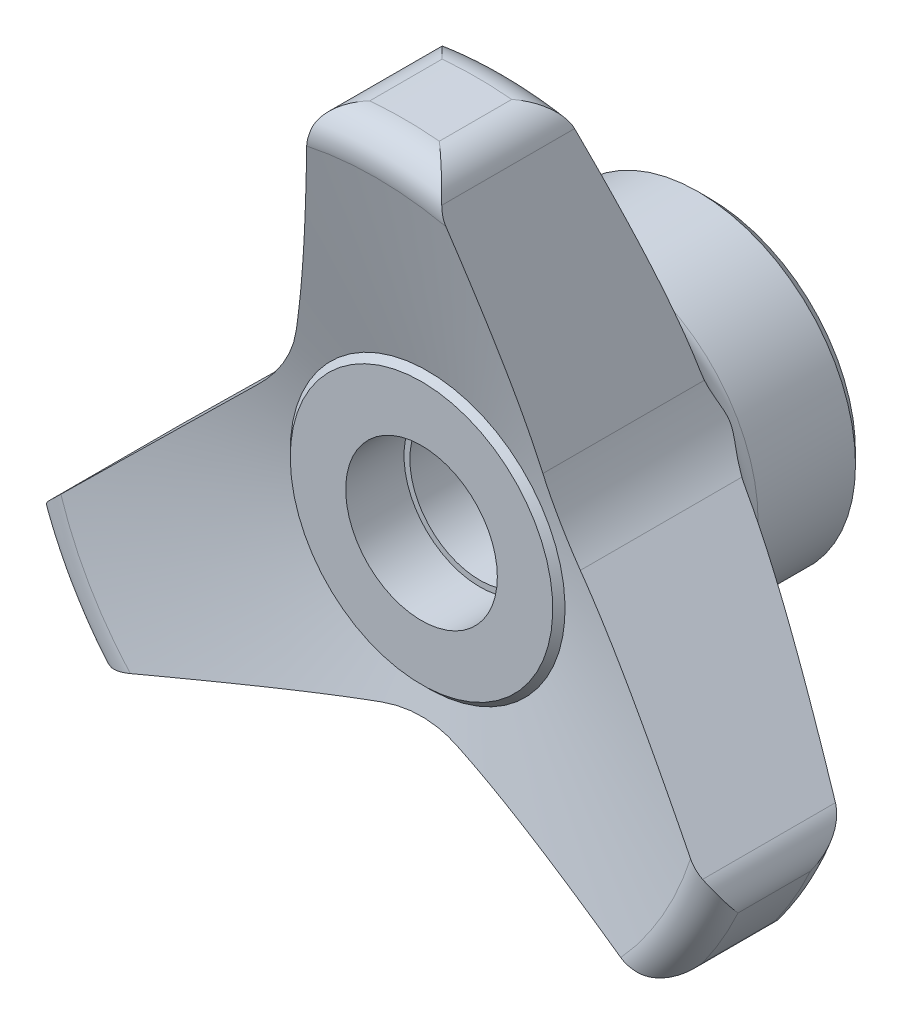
ISO-10303-21;
HEADER;
FILE_DESCRIPTION(('STEP AP214'),'2;1');
FILE_NAME('part.step','',(''),(''),'','','');
FILE_SCHEMA(('AUTOMOTIVE_DESIGN { 1 0 10303 214 1 1 1 1 }'));
ENDSEC;
DATA;
#1=APPLICATION_CONTEXT('core data for automotive mechanical design processes');
#2=APPLICATION_PROTOCOL_DEFINITION('international standard','automotive_design',2000,#1);
#3=PRODUCT_CONTEXT('',#1,'mechanical');
#4=PRODUCT('Part','Part','',(#3));
#5=PRODUCT_RELATED_PRODUCT_CATEGORY('part','',(#4));
#6=PRODUCT_DEFINITION_FORMATION('','',#4);
#7=PRODUCT_DEFINITION_CONTEXT('part definition',#1,'design');
#8=PRODUCT_DEFINITION('design','',#6,#7);
#9=PRODUCT_DEFINITION_SHAPE('','',#8);
#10=(LENGTH_UNIT() NAMED_UNIT(*) SI_UNIT(.MILLI.,.METRE.));
#11=(NAMED_UNIT(*) PLANE_ANGLE_UNIT() SI_UNIT($,.RADIAN.));
#12=(NAMED_UNIT(*) SI_UNIT($,.STERADIAN.) SOLID_ANGLE_UNIT());
#13=UNCERTAINTY_MEASURE_WITH_UNIT(LENGTH_MEASURE(1.E-05),#10,'distance_accuracy_value','');
#14=(GEOMETRIC_REPRESENTATION_CONTEXT(3) GLOBAL_UNCERTAINTY_ASSIGNED_CONTEXT((#13)) GLOBAL_UNIT_ASSIGNED_CONTEXT((#10,
#11,#12)) REPRESENTATION_CONTEXT('',''));
#15=CARTESIAN_POINT('',(0.,0.,0.));
#16=DIRECTION('',(0.,0.,1.));
#17=DIRECTION('',(1.,0.,0.));
#18=AXIS2_PLACEMENT_3D('',#15,#16,#17);
#19=CARTESIAN_POINT('',(0.,0.,11.505350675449));
#20=DIRECTION('',(0.,0.,1.));
#21=DIRECTION('',(-0.501223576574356,-0.865317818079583,0.));
#22=AXIS2_PLACEMENT_3D('',#19,#20,#21);
#23=CONICAL_SURFACE('',#22,14.7507868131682,1.18682389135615);
#24=CARTESIAN_POINT('',(-14.2492198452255,3.81193413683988,11.505150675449));
#25=CARTESIAN_POINT('',(-14.473897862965,3.59227891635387,11.5699165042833));
#26=CARTESIAN_POINT('',(-14.698146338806,3.37304363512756,11.6375428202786));
#27=CARTESIAN_POINT('',(-15.1458064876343,2.93539116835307,11.7779256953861));
#28=CARTESIAN_POINT('',(-15.3692182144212,2.71697393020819,11.8506819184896));
#29=CARTESIAN_POINT('',(-15.8151885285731,2.28097352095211,12.0007196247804));
#30=CARTESIAN_POINT('',(-16.0377473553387,2.0633901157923,12.077999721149));
#31=CARTESIAN_POINT('',(-16.4821311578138,1.628940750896,12.2365947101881));
#32=CARTESIAN_POINT('',(-16.7039561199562,1.41207480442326,12.3179096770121));
#33=CARTESIAN_POINT('',(-17.3680257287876,0.762850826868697,12.5670552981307));
#34=CARTESIAN_POINT('',(-17.8092491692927,0.331491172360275,12.7402176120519));
#35=CARTESIAN_POINT('',(-18.6894027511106,-0.528986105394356,13.0977027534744));
#36=CARTESIAN_POINT('',(-19.1283326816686,-0.958103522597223,13.2820265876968));
#37=CARTESIAN_POINT('',(-20.0036886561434,-1.81389044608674,13.6592457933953));
#38=CARTESIAN_POINT('',(-20.4401171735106,-2.24056237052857,13.8521299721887));
#39=CARTESIAN_POINT('',(-21.311342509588,-3.0923109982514,14.2448937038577));
#40=CARTESIAN_POINT('',(-21.7461393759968,-3.51738774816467,14.4447730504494));
#41=CARTESIAN_POINT('',(-22.6144740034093,-4.36631029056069,14.8502060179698));
#42=CARTESIAN_POINT('',(-23.0480114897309,-4.79015581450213,15.055760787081));
#43=CARTESIAN_POINT('',(-23.9139626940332,-5.63674821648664,15.4714492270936));
#44=CARTESIAN_POINT('',(-24.3463764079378,-6.05949509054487,15.681582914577));
#45=CARTESIAN_POINT('',(-25.048327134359,-6.74575333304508,16.0261282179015));
#46=CARTESIAN_POINT('',(-25.31815220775,-7.00954632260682,16.1593944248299));
#47=CARTESIAN_POINT('',(-25.8574532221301,-7.53679097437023,16.4272262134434));
#48=CARTESIAN_POINT('',(-26.1269291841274,-7.80024265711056,16.5617917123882));
#49=CARTESIAN_POINT('',(-26.665678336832,-8.32694778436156,16.832134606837));
#50=CARTESIAN_POINT('',(-26.9349514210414,-8.59020112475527,16.9679124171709));
#51=CARTESIAN_POINT('',(-27.4732440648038,-9.11645994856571,17.2405215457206));
#52=CARTESIAN_POINT('',(-27.7422636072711,-9.37946541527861,17.3773529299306));
#53=CARTESIAN_POINT('',(-28.0111620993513,-9.64235253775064,17.514646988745));
#54=B_SPLINE_CURVE_WITH_KNOTS('',3,(#24,#25,#26,#27,#28,#29,#30,#31,#32,#33,#34,#35,#36,#37,#38,
#39,#40,#41,#42,#43,#44,#45,#46,#47,#48,#49,#50,#51,#52,#53),.UNSPECIFIED.,.F.,.F.,(4,2,2,2,2,2,
2,2,2,2,2,2,2,2,4),(0.,0.962420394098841,1.92477780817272,2.8868417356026,3.84892335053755,
5.77142846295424,7.69410723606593,9.61434217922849,11.534520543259,13.4550902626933,
15.3756669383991,16.5762353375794,17.7767277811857,18.9776480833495,20.1786442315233),.UNSPECIFIED.);
#55=CARTESIAN_POINT('',(-14.2499137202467,3.81125577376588,11.505350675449));
#56=VERTEX_POINT('',#55);
#57=CARTESIAN_POINT('',(-28.0107703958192,-9.64196959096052,17.514446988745));
#58=VERTEX_POINT('',#57);
#59=EDGE_CURVE('E318',#56,#58,#54,.T.);
#60=ORIENTED_EDGE('',*,*,#59,.F.);
#61=CARTESIAN_POINT('',(0.,0.,11.505350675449));
#62=DIRECTION('',(0.,0.,1.));
#63=DIRECTION('',(-0.501223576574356,-0.865317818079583,0.));
#64=AXIS2_PLACEMENT_3D('',#61,#62,#63);
#65=CIRCLE('',#64,14.7507868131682);
#66=CARTESIAN_POINT('',(-3.86457016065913,-14.2355473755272,11.505350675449));
#67=VERTEX_POINT('',#66);
#68=EDGE_CURVE('E532',#56,#67,#65,.T.);
#69=ORIENTED_EDGE('',*,*,#68,.T.);
#70=CARTESIAN_POINT('',(-3.86363500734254,-14.2352882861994,11.505150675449));
#71=CARTESIAN_POINT('',(-4.16643938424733,-14.3191818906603,11.5699165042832));
#72=CARTESIAN_POINT('',(-4.46866485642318,-14.4029151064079,11.6375428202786));
#73=CARTESIAN_POINT('',(-5.07198801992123,-14.5700690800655,11.777925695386));
#74=CARTESIAN_POINT('',(-5.37308578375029,-14.6534898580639,11.8506819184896));
#75=CARTESIAN_POINT('',(-5.97413151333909,-14.8200128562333,12.0007196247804));
#76=CARTESIAN_POINT('',(-6.27407980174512,-14.9031151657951,12.0779997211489));
#77=CARTESIAN_POINT('',(-6.87298734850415,-15.0690457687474,12.236594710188));
#78=CARTESIAN_POINT('',(-7.17194658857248,-15.1518740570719,12.317909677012));
#79=CARTESIAN_POINT('',(-8.06693037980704,-15.3998341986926,12.5670552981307));
#80=CARTESIAN_POINT('',(-8.66157862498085,-15.5645847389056,12.7402176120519));
#81=CARTESIAN_POINT('',(-9.84778437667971,-15.8932295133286,13.0977027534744));
#82=CARTESIAN_POINT('',(-10.439341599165,-16.0571236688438,13.2820265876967));
#83=CARTESIAN_POINT('',(-11.6190814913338,-16.3839770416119,13.6592457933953));
#84=CARTESIAN_POINT('',(-12.2072674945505,-16.5469371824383,13.8521299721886));
#85=CARTESIAN_POINT('',(-13.3814404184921,-16.8722481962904,14.2448937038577));
#86=CARTESIAN_POINT('',(-13.9674274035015,-17.0345990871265,14.4447730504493));
#87=CARTESIAN_POINT('',(-15.1377044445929,-17.3588307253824,14.8502060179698));
#88=CARTESIAN_POINT('',(-15.7219941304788,-17.5207113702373,15.055760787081));
#89=CARTESIAN_POINT('',(-16.8890589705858,-17.8440530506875,15.4714492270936));
#90=CARTESIAN_POINT('',(-17.4718341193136,-18.0055140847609,15.681582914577));
#91=CARTESIAN_POINT('',(-18.4178712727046,-18.26761883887,16.0261282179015));
#92=CARTESIAN_POINT('',(-18.7815215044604,-18.3683701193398,16.1593944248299));
#93=CARTESIAN_POINT('',(-19.5083514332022,-18.5697423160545,16.4272262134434));
#94=CARTESIAN_POINT('',(-19.8715311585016,-18.6703632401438,16.5617917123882));
#95=CARTESIAN_POINT('',(-20.5976173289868,-18.8715293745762,16.8321346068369));
#96=CARTESIAN_POINT('',(-20.9605236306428,-18.9720745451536,16.9679124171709));
#97=CARTESIAN_POINT('',(-21.6859945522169,-19.1730702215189,17.2405215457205));
#98=CARTESIAN_POINT('',(-22.048559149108,-19.2735207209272,17.3773529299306));
#99=CARTESIAN_POINT('',(-22.4109606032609,-19.3739260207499,17.514646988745));
#100=B_SPLINE_CURVE_WITH_KNOTS('',3,(#70,#71,#72,#73,#74,#75,#76,#77,#78,#79,#80,#81,#82,#83,
#84,#85,#86,#87,#88,#89,#90,#91,#92,#93,#94,#95,#96,#97,#98,#99),.UNSPECIFIED.,.F.,.F.,(4,2,2,2,
2,2,2,2,2,2,2,2,2,2,4),(0.,0.962420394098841,1.92477780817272,2.88684173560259,3.84892335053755,
5.77142846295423,7.69410723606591,9.61434217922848,11.534520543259,13.4550902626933,
15.3756669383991,16.5762353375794,17.7767277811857,18.9776480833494,20.1786442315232),.UNSPECIFIED.);
#101=CARTESIAN_POINT('',(-22.4104326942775,-19.3737797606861,17.514446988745));
#102=VERTEX_POINT('',#101);
#103=EDGE_CURVE('E309',#67,#102,#100,.T.);
#104=ORIENTED_EDGE('',*,*,#103,.T.);
#105=CARTESIAN_POINT('',(0.,0.,17.514446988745));
#106=DIRECTION('',(0.,0.,1.));
#107=DIRECTION('',(-0.501223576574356,-0.865317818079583,0.));
#108=AXIS2_PLACEMENT_3D('',#105,#106,#107);
#109=CIRCLE('',#108,29.6238220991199);
#110=EDGE_CURVE('E530',#58,#102,#109,.T.);
#111=ORIENTED_EDGE('',*,*,#110,.F.);
#112=EDGE_LOOP('',(#60,#69,#104,#111));
#113=FACE_BOUND('',#112,.T.);
#114=ADVANCED_FACE('F14',(#113),#23,.T.);
#115=CARTESIAN_POINT('',(3.82337812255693,-14.2461534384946,11.505150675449));
#116=CARTESIAN_POINT('',(4.12594413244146,-14.3309026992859,11.5699165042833));
#117=CARTESIAN_POINT('',(4.42793169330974,-14.4154899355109,11.6375428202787));
#118=CARTESIAN_POINT('',(5.03077992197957,-14.5843487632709,11.7779256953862));
#119=CARTESIAN_POINT('',(5.33164066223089,-14.6686203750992,11.8506819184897));
#120=CARTESIAN_POINT('',(5.93221324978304,-14.8368417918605,12.0007196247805));
#121=CARTESIAN_POINT('',(6.23192541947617,-14.9207916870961,12.077999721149));
#122=CARTESIAN_POINT('',(6.83036150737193,-15.0884146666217,12.2365947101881));
#123=CARTESIAN_POINT('',(7.1290854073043,-15.1720877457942,12.3179096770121));
#124=CARTESIAN_POINT('',(8.02336466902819,-15.422576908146,12.5670552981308));
#125=CARTESIAN_POINT('',(8.6175448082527,-15.5890077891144,12.740217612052));
#126=CARTESIAN_POINT('',(9.80281678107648,-15.9210045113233,13.0977027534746));
#127=CARTESIAN_POINT('',(10.3939083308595,-16.0865702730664,13.2820265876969));
#128=CARTESIAN_POINT('',(11.5727195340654,-16.4167573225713,13.6592457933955));
#129=CARTESIAN_POINT('',(12.1604425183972,-16.5813795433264,13.8521299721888));
#130=CARTESIAN_POINT('',(13.3336911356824,-16.9100085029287,14.2448937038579));
#131=CARTESIAN_POINT('',(13.9192168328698,-17.074015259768,14.4447730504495));
#132=CARTESIAN_POINT('',(15.0885726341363,-17.4015538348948,14.85020601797));
#133=CARTESIAN_POINT('',(15.6724023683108,-17.5650855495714,15.0557607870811));
#134=CARTESIAN_POINT('',(16.8385484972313,-17.8917250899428,15.4714492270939));
#135=CARTESIAN_POINT('',(17.4208648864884,-18.0548329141,15.6815829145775));
#136=CARTESIAN_POINT('',(18.3661573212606,-18.3196109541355,16.0261282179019));
#137=CARTESIAN_POINT('',(18.7295212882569,-18.4213898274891,16.1593944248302));
#138=CARTESIAN_POINT('',(19.4557790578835,-18.6248158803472,16.4272262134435));
#139=CARTESIAN_POINT('',(19.818672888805,-18.726463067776,16.5617917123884));
#140=CARTESIAN_POINT('',(20.5441874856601,-18.92968095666,16.8321346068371));
#141=CARTESIAN_POINT('',(20.9068081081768,-19.0312516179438,16.967912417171));
#142=CARTESIAN_POINT('',(21.6317079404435,-19.2342973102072,17.2405215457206));
#143=CARTESIAN_POINT('',(21.9939871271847,-19.3357723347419,17.3773529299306));
#144=CARTESIAN_POINT('',(22.3561032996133,-19.4372016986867,17.514646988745));
#145=B_SPLINE_CURVE_WITH_KNOTS('',3,(#115,#116,#117,#118,#119,#120,#121,#122,#123,#124,#125,
#126,#127,#128,#129,#130,#131,#132,#133,#134,#135,#136,#137,#138,#139,#140,#141,#142,#143,#144),
.UNSPECIFIED.,.F.,.F.,(4,2,2,2,2,2,2,2,2,2,2,2,2,2,4),(0.,0.962420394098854,1.92477780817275,
2.88684173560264,3.8489233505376,5.7714284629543,7.69410723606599,9.61434217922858,
11.5345205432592,13.4550902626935,15.3756669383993,16.5762353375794,17.7767277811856,
18.9776480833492,20.1786442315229),.UNSPECIFIED.);
#146=CARTESIAN_POINT('',(3.82431253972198,-14.2464151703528,11.505350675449));
#147=VERTEX_POINT('',#146);
#148=CARTESIAN_POINT('',(22.3555758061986,-19.4370539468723,17.514446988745));
#149=VERTEX_POINT('',#148);
#150=EDGE_CURVE('E300',#147,#149,#145,.T.);
#151=ORIENTED_EDGE('',*,*,#150,.F.);
#152=CARTESIAN_POINT('',(14.2606307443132,3.77095775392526,11.505350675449));
#153=VERTEX_POINT('',#152);
#154=EDGE_CURVE('E539',#147,#153,#65,.T.);
#155=ORIENTED_EDGE('',*,*,#154,.T.);
#156=CARTESIAN_POINT('',(14.2599387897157,3.7716380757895,11.505150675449));
#157=CARTESIAN_POINT('',(14.4839949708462,3.55134859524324,11.5699165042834));
#158=CARTESIAN_POINT('',(14.7076227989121,3.33148026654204,11.6375428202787));
#159=CARTESIAN_POINT('',(15.1540439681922,2.89256406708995,11.7779256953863));
#160=CARTESIAN_POINT('',(15.3768373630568,2.67351614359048,11.8506819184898));
#161=CARTESIAN_POINT('',(15.8215733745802,2.2362567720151,12.0007196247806));
#162=CARTESIAN_POINT('',(16.0435162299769,2.01804508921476,12.0779997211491));
#163=CARTESIAN_POINT('',(16.4866701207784,1.58234124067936,12.2365947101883));
#164=CARTESIAN_POINT('',(16.7078811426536,1.36484908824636,12.3179096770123));
#165=CARTESIAN_POINT('',(17.3701128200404,0.713750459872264,12.5670552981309));
#166=CARTESIAN_POINT('',(17.810115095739,0.281145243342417,12.7402176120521));
#167=CARTESIAN_POINT('',(18.6878326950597,-0.58181668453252,13.0977027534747));
#168=CARTESIAN_POINT('',(19.1255478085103,-1.01217318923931,13.282026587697));
#169=CARTESIAN_POINT('',(19.9984810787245,-1.87043121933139,13.6592457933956));
#170=CARTESIAN_POINT('',(20.4337017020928,-2.29833516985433,13.852129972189));
#171=CARTESIAN_POINT('',(21.3025157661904,-3.15254324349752,14.244893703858));
#172=CARTESIAN_POINT('',(21.7361092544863,-3.57884741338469,14.4447730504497));
#173=CARTESIAN_POINT('',(22.6020406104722,-4.43022124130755,14.8502060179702));
#174=CARTESIAN_POINT('',(23.0343782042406,-4.8552906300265,15.0557607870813));
#175=CARTESIAN_POINT('',(23.8979327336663,-5.70432758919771,15.471449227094));
#176=CARTESIAN_POINT('',(24.3291496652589,-6.12829515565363,15.6815829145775));
#177=CARTESIAN_POINT('',(25.0291576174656,-6.81653498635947,16.0261282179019));
#178=CARTESIAN_POINT('',(25.2982359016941,-7.08108968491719,16.1593944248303));
#179=CARTESIAN_POINT('',(25.8360443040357,-7.60985676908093,16.4272262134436));
#180=CARTESIAN_POINT('',(26.104774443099,-7.87406917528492,16.5617917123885));
#181=CARTESIAN_POINT('',(26.6420325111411,-8.40229517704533,16.8321346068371));
#182=CARTESIAN_POINT('',(26.9105603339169,-8.66630866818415,16.9679124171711));
#183=CARTESIAN_POINT('',(27.447363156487,-9.19408707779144,17.2405215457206));
#184=CARTESIAN_POINT('',(27.7156381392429,-9.45785197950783,17.3773529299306));
#185=CARTESIAN_POINT('',(27.9837924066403,-9.7214981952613,17.514646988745));
#186=B_SPLINE_CURVE_WITH_KNOTS('',3,(#156,#157,#158,#159,#160,#161,#162,#163,#164,#165,#166,
#167,#168,#169,#170,#171,#172,#173,#174,#175,#176,#177,#178,#179,#180,#181,#182,#183,#184,#185),
.UNSPECIFIED.,.F.,.F.,(4,2,2,2,2,2,2,2,2,2,2,2,2,2,4),(0.,0.96242039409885,1.92477780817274,
2.88684173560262,3.84892335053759,5.77142846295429,7.694107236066,9.61434217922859,
11.5345205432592,13.4550902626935,15.3756669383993,16.5762353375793,17.7767277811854,
18.9776480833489,20.1786442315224),.UNSPECIFIED.);
#187=CARTESIAN_POINT('',(27.9834017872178,-9.72111414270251,17.514446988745));
#188=VERTEX_POINT('',#187);
#189=EDGE_CURVE('E291',#153,#188,#186,.T.);
#190=ORIENTED_EDGE('',*,*,#189,.T.);
#191=EDGE_CURVE('E529',#149,#188,#109,.T.);
#192=ORIENTED_EDGE('',*,*,#191,.F.);
#193=EDGE_LOOP('',(#151,#155,#190,#192));
#194=FACE_BOUND('',#193,.T.);
#195=ADVANCED_FACE('F280',(#194),#23,.T.);
#196=CARTESIAN_POINT('',(0.,0.,20.29599761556));
#197=DIRECTION('',(0.,0.,1.));
#198=DIRECTION('',(-0.501223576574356,-0.865317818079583,0.));
#199=AXIS2_PLACEMENT_3D('',#196,#197,#198);
#200=TOROIDAL_SURFACE('',#199,28.5,3.00000000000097);
#201=CARTESIAN_POINT('',(-2.94032042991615,31.362469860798,20.29599761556));
#202=CARTESIAN_POINT('',(-2.94308971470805,31.3622102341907,20.2933519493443));
#203=CARTESIAN_POINT('',(-2.94585872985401,31.3619467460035,20.2907061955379));
#204=CARTESIAN_POINT('',(-3.17359963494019,31.3399560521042,20.0730745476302));
#205=CARTESIAN_POINT('',(-3.39673621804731,31.2927382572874,19.8575536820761));
#206=CARTESIAN_POINT('',(-3.7223230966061,31.1836404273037,19.5383719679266));
#207=CARTESIAN_POINT('',(-3.82950948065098,31.140788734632,19.4324821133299));
#208=CARTESIAN_POINT('',(-4.03985023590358,31.0420799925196,19.2227976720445));
#209=CARTESIAN_POINT('',(-4.14300645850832,30.9862289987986,19.1190021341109));
#210=CARTESIAN_POINT('',(-4.39606695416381,30.8290016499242,18.8615580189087));
#211=CARTESIAN_POINT('',(-4.54265500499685,30.7189992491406,18.7097948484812));
#212=CARTESIAN_POINT('',(-4.81874808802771,30.4674210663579,18.4173019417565));
#213=CARTESIAN_POINT('',(-4.94827735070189,30.3258908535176,18.2765566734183));
#214=CARTESIAN_POINT('',(-5.15490660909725,30.0486334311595,18.0441248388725));
#215=CARTESIAN_POINT('',(-5.2371119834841,29.9197705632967,17.9488026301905));
#216=CARTESIAN_POINT('',(-5.38343895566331,29.6438922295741,17.7720286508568));
#217=CARTESIAN_POINT('',(-5.44762746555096,29.4969469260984,17.6905260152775));
#218=CARTESIAN_POINT('',(-5.52419847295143,29.271962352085,17.5859012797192));
#219=CARTESIAN_POINT('',(-5.54567923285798,29.2003670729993,17.5552878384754));
#220=CARTESIAN_POINT('',(-5.56459706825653,29.1272327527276,17.526835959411));
#221=B_SPLINE_CURVE_WITH_KNOTS('',3,(#201,#202,#203,#204,#205,#206,#207,#208,#209,#210,#211,
#212,#213,#214,#215,#216,#217,#218,#219,#220),.UNSPECIFIED.,.F.,.F.,(4,2,2,2,2,2,2,2,2,4),(0.,
0.0115165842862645,0.947290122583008,1.41680055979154,1.88609271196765,2.59732135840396,
3.30752861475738,3.84609137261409,4.38262668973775,4.62469734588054),.UNSPECIFIED.);
#222=CARTESIAN_POINT('',(-2.94032042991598,31.3624698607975,20.2959999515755));
#223=VERTEX_POINT('',#222);
#224=CARTESIAN_POINT('',(-5.56454504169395,29.1274337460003,17.5269141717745));
#225=VERTEX_POINT('',#224);
#226=EDGE_CURVE('E667',#223,#225,#221,.T.);
#227=ORIENTED_EDGE('',*,*,#226,.F.);
#228=CARTESIAN_POINT('',(0.,0.,20.2959999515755));
#229=DIRECTION('',(0.,0.,1.));
#230=DIRECTION('',(-0.501223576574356,-0.865317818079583,0.));
#231=AXIS2_PLACEMENT_3D('',#228,#229,#230);
#232=CIRCLE('',#231,31.5);
#233=CARTESIAN_POINT('',(3.02896661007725,31.3540326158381,20.2959999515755));
#234=VERTEX_POINT('',#233);
#235=EDGE_CURVE('E690',#234,#223,#232,.T.);
#236=ORIENTED_EDGE('',*,*,#235,.F.);
#237=CARTESIAN_POINT('',(5.64693336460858,29.1113102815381,17.526806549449));
#238=CARTESIAN_POINT('',(5.62533690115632,29.1957455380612,17.5596373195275));
#239=CARTESIAN_POINT('',(5.60035724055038,29.278089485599,17.5953104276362));
#240=CARTESIAN_POINT('',(5.54438278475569,29.4381588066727,17.6715379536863));
#241=CARTESIAN_POINT('',(5.5133994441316,29.5158926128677,17.7120830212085));
#242=CARTESIAN_POINT('',(5.41311711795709,29.7404403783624,17.8391503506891));
#243=CARTESIAN_POINT('',(5.33601143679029,29.8803484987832,17.9318113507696));
#244=CARTESIAN_POINT('',(5.14376608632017,30.1742163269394,18.1542512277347));
#245=CARTESIAN_POINT('',(5.02394728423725,30.3224505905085,18.2874316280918));
#246=CARTESIAN_POINT('',(4.76553549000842,30.5891654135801,18.5664805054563));
#247=CARTESIAN_POINT('',(4.62684310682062,30.7074782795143,18.7124145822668));
#248=CARTESIAN_POINT('',(4.38756458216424,30.8780162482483,18.9592809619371));
#249=CARTESIAN_POINT('',(4.29069988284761,30.9388591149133,19.0580202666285));
#250=CARTESIAN_POINT('',(4.09261296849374,31.0483431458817,19.2578863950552));
#251=CARTESIAN_POINT('',(3.99138915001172,31.0969797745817,19.3590140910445));
#252=CARTESIAN_POINT('',(3.68323954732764,31.2245991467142,19.6642754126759));
#253=CARTESIAN_POINT('',(3.47112530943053,31.2857839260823,19.8710161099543));
#254=CARTESIAN_POINT('',(3.18342739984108,31.3359711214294,20.1481039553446));
#255=CARTESIAN_POINT('',(3.11048561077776,31.3459402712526,20.2180766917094));
#256=CARTESIAN_POINT('',(3.03450351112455,31.3534938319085,20.2907060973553));
#257=CARTESIAN_POINT('',(3.03173525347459,31.3537651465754,20.2933518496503));
#258=CARTESIAN_POINT('',(3.02896661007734,31.3540326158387,20.29599761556));
#259=B_SPLINE_CURVE_WITH_KNOTS('',3,(#237,#238,#239,#240,#241,#242,#243,#244,#245,#246,#247,
#248,#249,#250,#251,#252,#253,#254,#255,#256,#257,#258),.UNSPECIFIED.,.F.,.F.,(4,2,2,2,2,2,2,2,
2,2,4),(0.,0.279093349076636,0.557659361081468,1.10904884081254,1.8030557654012,
2.50087008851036,2.95363748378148,3.4065728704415,4.30909224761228,4.61372302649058,
4.62523961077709),.UNSPECIFIED.);
#260=CARTESIAN_POINT('',(5.6468625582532,29.1115870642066,17.5269141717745));
#261=VERTEX_POINT('',#260);
#262=EDGE_CURVE('E637',#261,#234,#259,.T.);
#263=ORIENTED_EDGE('',*,*,#262,.F.);
#264=CARTESIAN_POINT('',(5.94550973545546,27.944404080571,17.2968119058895));
#265=CARTESIAN_POINT('',(5.91967831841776,28.0453592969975,17.2989935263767));
#266=CARTESIAN_POINT('',(5.89388000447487,28.1461851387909,17.305528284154));
#267=CARTESIAN_POINT('',(5.84250429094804,28.3469734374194,17.3273686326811));
#268=CARTESIAN_POINT('',(5.81692696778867,28.4469355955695,17.3426771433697));
#269=CARTESIAN_POINT('',(5.74228730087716,28.7386448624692,17.4006858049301));
#270=CARTESIAN_POINT('',(5.69376866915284,28.9282670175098,17.4556063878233));
#271=CARTESIAN_POINT('',(5.60462068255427,29.2766781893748,17.5911312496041));
#272=CARTESIAN_POINT('',(5.56369202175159,29.4366369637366,17.6685332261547));
#273=CARTESIAN_POINT('',(5.50453863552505,29.667822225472,17.8050506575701));
#274=CARTESIAN_POINT('',(5.48495525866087,29.744358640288,17.8547437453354));
#275=CARTESIAN_POINT('',(5.44690274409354,29.8930767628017,17.9607279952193));
#276=CARTESIAN_POINT('',(5.42843424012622,29.9652559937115,18.0170228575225));
#277=CARTESIAN_POINT('',(5.41060486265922,30.0349373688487,18.076514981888));
#278=B_SPLINE_CURVE_WITH_KNOTS('',3,(#264,#265,#266,#267,#268,#269,#270,#271,#272,#273,#274,
#275,#276,#277),.UNSPECIFIED.,.F.,.F.,(4,2,2,2,2,2,4),(0.,0.312510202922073,0.625124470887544,
1.23184385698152,1.77649419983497,2.05618088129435,2.33602507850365),.UNSPECIFIED.);
#279=CARTESIAN_POINT('',(5.65519458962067,29.0790235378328,17.514446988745));
#280=VERTEX_POINT('',#279);
#281=EDGE_CURVE('E209',#280,#261,#278,.T.);
#282=ORIENTED_EDGE('',*,*,#281,.F.);
#283=CARTESIAN_POINT('',(-5.57296909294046,29.0948939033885,17.514446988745));
#284=VERTEX_POINT('',#283);
#285=EDGE_CURVE('E525',#280,#284,#109,.T.);
#286=ORIENTED_EDGE('',*,*,#285,.T.);
#287=CARTESIAN_POINT('',(-5.57310641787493,29.0943634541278,17.514246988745));
#288=CARTESIAN_POINT('',(-5.57166806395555,29.0999194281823,17.5163412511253));
#289=CARTESIAN_POINT('',(-5.5702311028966,29.1054700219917,17.5184504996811));
#290=CARTESIAN_POINT('',(-5.56735996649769,29.1165604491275,17.5226989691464));
#291=CARTESIAN_POINT('',(-5.56592579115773,29.1221002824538,17.524838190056));
#292=CARTESIAN_POINT('',(-5.56449300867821,29.1276347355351,17.526992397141));
#293=B_SPLINE_CURVE_WITH_KNOTS('',3,(#287,#288,#289,#290,#291,#292),.UNSPECIFIED.,.F.,.F.,(4,2,
4),(0.,0.0183277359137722,0.0366554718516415),.UNSPECIFIED.);
#294=EDGE_CURVE('E622',#284,#225,#293,.T.);
#295=ORIENTED_EDGE('',*,*,#294,.T.);
#296=EDGE_LOOP('',(#227,#236,#263,#282,#286,#295));
#297=FACE_BOUND('',#296,.T.);
#298=ADVANCED_FACE('F281',(#297),#200,.T.);
#299=CARTESIAN_POINT('',(-27.1732556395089,-8.82317792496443,17.296810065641));
#300=CARTESIAN_POINT('',(-27.2477700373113,-8.89602651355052,17.2989892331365));
#301=CARTESIAN_POINT('',(-27.3221890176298,-8.96878181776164,17.3055215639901));
#302=CARTESIAN_POINT('',(-27.4703898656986,-9.11366955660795,17.3273571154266));
#303=CARTESIAN_POINT('',(-27.544171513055,-9.18580177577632,17.3426632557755));
#304=CARTESIAN_POINT('',(-27.7594811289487,-9.39629803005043,17.4006650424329));
#305=CARTESIAN_POINT('',(-27.899440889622,-9.53312891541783,17.4555812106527));
#306=CARTESIAN_POINT('',(-28.1566035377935,-9.78454255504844,17.5910982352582));
#307=CARTESIAN_POINT('',(-28.2746697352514,-9.89996931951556,17.6684968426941));
#308=CARTESIAN_POINT('',(-28.4453088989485,-10.0667937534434,17.8050095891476));
#309=CARTESIAN_POINT('',(-28.5018009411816,-10.1220228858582,17.8547011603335));
#310=CARTESIAN_POINT('',(-28.6115709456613,-10.2293389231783,17.9606825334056));
#311=CARTESIAN_POINT('',(-28.664847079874,-10.2814240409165,18.0169760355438));
#312=CARTESIAN_POINT('',(-28.7162796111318,-10.3317067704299,18.0764668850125));
#313=B_SPLINE_CURVE_WITH_KNOTS('',3,(#299,#300,#301,#302,#303,#304,#305,#306,#307,#308,#309,
#310,#311,#312),.UNSPECIFIED.,.F.,.F.,(4,2,2,2,2,2,4),(0.,0.312511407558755,0.625126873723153,
1.23184863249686,1.77650289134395,2.05619159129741,2.33603780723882),.UNSPECIFIED.);
#314=CARTESIAN_POINT('',(-28.0348052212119,-9.66546710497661,17.5269141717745));
#315=VERTEX_POINT('',#314);
#316=EDGE_CURVE('E327',#58,#315,#313,.T.);
#317=ORIENTED_EDGE('',*,*,#316,.F.);
#318=ORIENTED_EDGE('',*,*,#110,.T.);
#319=CARTESIAN_POINT('',(-21.2817773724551,-19.0610796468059,17.2968119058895));
#320=CARTESIAN_POINT('',(-21.3822019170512,-19.0889028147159,17.2989935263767));
#321=CARTESIAN_POINT('',(-21.482497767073,-19.116690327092,17.305528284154));
#322=CARTESIAN_POINT('',(-21.6822306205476,-19.1720274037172,17.3273686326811));
#323=CARTESIAN_POINT('',(-21.7816673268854,-19.1995768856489,17.3426771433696));
#324=CARTESIAN_POINT('',(-22.0718432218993,-19.2799717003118,17.4006858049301));
#325=CARTESIAN_POINT('',(-22.2604686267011,-19.3322313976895,17.4556063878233));
#326=CARTESIAN_POINT('',(-22.607048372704,-19.4282532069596,17.5911312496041));
#327=CARTESIAN_POINT('',(-22.7661663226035,-19.4723377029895,17.6685332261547));
#328=CARTESIAN_POINT('',(-22.9961363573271,-19.5360521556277,17.80505065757));
#329=CARTESIAN_POINT('',(-23.0722704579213,-19.5571455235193,17.8547437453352));
#330=CARTESIAN_POINT('',(-23.220206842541,-19.5981321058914,17.9607279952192));
#331=CARTESIAN_POINT('',(-23.2920066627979,-19.6180246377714,18.0170228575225));
#332=CARTESIAN_POINT('',(-23.3613217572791,-19.6372287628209,18.076514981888));
#333=B_SPLINE_CURVE_WITH_KNOTS('',3,(#319,#320,#321,#322,#323,#324,#325,#326,#327,#328,#329,
#330,#331,#332),.UNSPECIFIED.,.F.,.F.,(4,2,2,2,2,2,4),(0.,0.312510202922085,0.625124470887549,
1.23184385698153,1.77649419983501,2.05618088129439,2.33602507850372),.UNSPECIFIED.);
#334=CARTESIAN_POINT('',(-22.4428250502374,-19.3827542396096,17.5269141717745));
#335=VERTEX_POINT('',#334);
#336=EDGE_CURVE('E398',#102,#335,#333,.T.);
#337=ORIENTED_EDGE('',*,*,#336,.T.);
#338=CARTESIAN_POINT('',(-25.690535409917,-18.2276271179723,20.29599761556));
#339=CARTESIAN_POINT('',(-25.688925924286,-18.2298955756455,20.2933519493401));
#340=CARTESIAN_POINT('',(-25.6873132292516,-18.2321618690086,20.2907061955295));
#341=CARTESIAN_POINT('',(-25.5543982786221,-18.4183959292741,20.0730745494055));
#342=CARTESIAN_POINT('',(-25.4019381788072,-18.5880289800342,19.8575536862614));
#343=CARTESIAN_POINT('',(-25.1446632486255,-18.8154465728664,19.5383719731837));
#344=CARTESIAN_POINT('',(-25.0539594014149,-18.8868468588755,19.4324821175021));
#345=CARTESIAN_POINT('',(-24.8633047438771,-19.0196529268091,19.2227976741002));
#346=CARTESIAN_POINT('',(-24.7633582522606,-19.0810633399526,19.1190021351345));
#347=CARTESIAN_POINT('',(-24.500665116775,-19.2216064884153,18.8615580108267));
#348=CARTESIAN_POINT('',(-24.3321062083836,-19.2935542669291,18.7097948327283));
#349=CARTESIAN_POINT('',(-23.9761865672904,-19.4068687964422,18.4173019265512));
#350=CARTESIAN_POINT('',(-23.7888531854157,-19.4482793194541,18.2765566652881));
#351=CARTESIAN_POINT('',(-23.4454284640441,-19.4885965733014,18.0441261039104));
#352=CARTESIAN_POINT('',(-23.2927292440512,-19.4953571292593,17.9488050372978));
#353=CARTESIAN_POINT('',(-22.9806522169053,-19.4841416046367,17.7720329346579));
#354=CARTESIAN_POINT('',(-22.8213017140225,-19.4662585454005,17.6905310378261));
#355=CARTESIAN_POINT('',(-22.588146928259,-19.4200743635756,17.5858934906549));
#356=CARTESIAN_POINT('',(-22.5153740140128,-19.4028719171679,17.5552683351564));
#357=CARTESIAN_POINT('',(-22.4425497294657,-19.3826779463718,17.5268065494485));
#358=B_SPLINE_CURVE_WITH_KNOTS('',3,(#338,#339,#340,#341,#342,#343,#344,#345,#346,#347,#348,
#349,#350,#351,#352,#353,#354,#355,#356,#357),.UNSPECIFIED.,.F.,.F.,(4,2,2,2,2,2,2,2,2,4),(0.,
0.011516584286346,0.94729011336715,1.41680055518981,1.8860927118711,2.59732139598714,
3.30752861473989,3.84608458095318,4.38261323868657,4.62478073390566),.UNSPECIFIED.);
#359=CARTESIAN_POINT('',(-25.6905354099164,-18.2276271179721,20.2959999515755));
#360=VERTEX_POINT('',#359);
#361=EDGE_CURVE('E655',#360,#335,#358,.T.);
#362=ORIENTED_EDGE('',*,*,#361,.F.);
#363=CARTESIAN_POINT('',(-28.6678720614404,-13.0538542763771,20.2959999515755));
#364=VERTEX_POINT('',#363);
#365=EDGE_CURVE('E685',#364,#360,#232,.T.);
#366=ORIENTED_EDGE('',*,*,#365,.F.);
#367=CARTESIAN_POINT('',(-28.0346567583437,-9.66532197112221,17.526835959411));
#368=CARTESIAN_POINT('',(-28.0969809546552,-9.7262452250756,17.5596691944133));
#369=CARTESIAN_POINT('',(-28.1558022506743,-9.78905269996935,17.5953447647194));
#370=CARTESIAN_POINT('',(-28.2664371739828,-9.91756748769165,17.6715771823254));
#371=CARTESIAN_POINT('',(-28.318263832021,-9.98326909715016,17.7121246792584));
#372=CARTESIAN_POINT('',(-28.4625830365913,-10.182396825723,17.8391991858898));
#373=CARTESIAN_POINT('',(-28.5451912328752,-10.3191306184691,17.9318648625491));
#374=CARTESIAN_POINT('',(-28.7035584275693,-10.6325635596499,18.1543155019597));
#375=CARTESIAN_POINT('',(-28.772019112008,-10.8104520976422,18.2875019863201));
#376=CARTESIAN_POINT('',(-28.8737847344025,-11.1676104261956,18.5665627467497));
#377=CARTESIAN_POINT('',(-28.9068947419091,-11.3468824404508,18.712502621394));
#378=CARTESIAN_POINT('',(-28.9349352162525,-11.639377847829,18.9593770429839));
#379=CARTESIAN_POINT('',(-28.9391900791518,-11.7536875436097,19.0581186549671));
#380=CARTESIAN_POINT('',(-28.9349539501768,-11.9799794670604,19.2579891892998));
#381=CARTESIAN_POINT('',(-28.9264582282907,-12.0919608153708,19.3591189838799));
#382=CARTESIAN_POINT('',(-28.8828917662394,-12.4226372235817,19.6643862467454));
#383=CARTESIAN_POINT('',(-28.8298131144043,-12.6369261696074,19.8711305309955));
#384=CARTESIAN_POINT('',(-28.7294295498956,-12.9111329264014,20.1481823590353));
#385=CARTESIAN_POINT('',(-28.7016064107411,-12.979248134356,20.2181158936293));
#386=CARTESIAN_POINT('',(-28.6701739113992,-13.0487897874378,20.2907060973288));
#387=CARTESIAN_POINT('',(-28.6690247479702,-13.0513228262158,20.293351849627));
#388=CARTESIAN_POINT('',(-28.6678720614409,-13.0538542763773,20.29599761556));
#389=B_SPLINE_CURVE_WITH_KNOTS('',3,(#367,#368,#369,#370,#371,#372,#373,#374,#375,#376,#377,
#378,#379,#380,#381,#382,#383,#384,#385,#386,#387,#388),.UNSPECIFIED.,.F.,.F.,(4,2,2,2,2,2,2,2,
2,2,4),(0.,0.279099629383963,0.557671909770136,1.10907389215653,1.80309928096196,
2.5009322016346,2.95370596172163,3.40664772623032,4.30917943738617,4.61363957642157,
4.62515616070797),.UNSPECIFIED.);
#390=EDGE_CURVE('E661',#315,#364,#389,.T.);
#391=ORIENTED_EDGE('',*,*,#390,.F.);
#392=EDGE_LOOP('',(#317,#318,#337,#362,#366,#391));
#393=FACE_BOUND('',#392,.T.);
#394=ADVANCED_FACE('F743',(#393),#200,.T.);
#395=CARTESIAN_POINT('',(22.3550481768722,-19.4369061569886,17.514246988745));
#396=CARTESIAN_POINT('',(22.3605744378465,-19.4384540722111,17.5163411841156));
#397=CARTESIAN_POINT('',(22.3660953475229,-19.4400004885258,17.518450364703));
#398=CARTESIAN_POINT('',(22.3771264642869,-19.4430903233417,17.5226986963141));
#399=CARTESIAN_POINT('',(22.3826366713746,-19.4446337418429,17.5248378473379));
#400=CARTESIAN_POINT('',(22.3881415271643,-19.4461756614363,17.5269919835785));
#401=B_SPLINE_CURVE_WITH_KNOTS('',3,(#395,#396,#397,#398,#399,#400),.UNSPECIFIED.,.F.,.F.,(4,2,
4),(0.,0.0183271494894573,0.0366542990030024),.UNSPECIFIED.);
#402=CARTESIAN_POINT('',(22.3879426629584,-19.4461199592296,17.5269141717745));
#403=VERTEX_POINT('',#402);
#404=EDGE_CURVE('E453',#149,#403,#401,.T.);
#405=ORIENTED_EDGE('',*,*,#404,.F.);
#406=ORIENTED_EDGE('',*,*,#191,.T.);
#407=CARTESIAN_POINT('',(27.9830110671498,-9.7207299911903,17.514246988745));
#408=CARTESIAN_POINT('',(27.9871033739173,-9.72475350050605,17.5163411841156));
#409=CARTESIAN_POINT('',(27.9911917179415,-9.72877311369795,17.518450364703));
#410=CARTESIAN_POINT('',(27.999360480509,-9.7368045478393,17.5226986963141));
#411=CARTESIAN_POINT('',(28.0034408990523,-9.74081636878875,17.5248378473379));
#412=CARTESIAN_POINT('',(28.0075173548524,-9.74482429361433,17.5269919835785));
#413=B_SPLINE_CURVE_WITH_KNOTS('',3,(#407,#408,#409,#410,#411,#412),.UNSPECIFIED.,.F.,.F.,(4,2,
4),(0.,0.0183271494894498,0.0366542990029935),.UNSPECIFIED.);
#414=CARTESIAN_POINT('',(28.0073700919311,-9.74467950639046,17.5269141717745));
#415=VERTEX_POINT('',#414);
#416=EDGE_CURVE('E469',#188,#415,#413,.T.);
#417=ORIENTED_EDGE('',*,*,#416,.T.);
#418=CARTESIAN_POINT('',(28.6308558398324,-13.1348427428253,20.29599761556));
#419=CARTESIAN_POINT('',(28.6320156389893,-13.1323146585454,20.2933519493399));
#420=CARTESIAN_POINT('',(28.6331719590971,-13.1297848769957,20.2907061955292));
#421=CARTESIAN_POINT('',(28.7279979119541,-12.9215601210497,20.0730745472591));
#422=CARTESIAN_POINT('',(28.7986743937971,-12.7047092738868,19.8575536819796));
#423=CARTESIAN_POINT('',(28.8669863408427,-12.3681938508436,19.5383719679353));
#424=CARTESIAN_POINT('',(28.8834688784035,-12.2539418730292,19.4324821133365));
#425=CARTESIAN_POINT('',(28.9031549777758,-12.0224270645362,19.2227976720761));
#426=CARTESIAN_POINT('',(28.9063647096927,-11.9051656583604,19.1190021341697));
#427=CARTESIAN_POINT('',(28.8967320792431,-11.6073951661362,18.8615580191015));
#428=CARTESIAN_POINT('',(28.8747612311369,-11.4254449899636,18.7097948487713));
#429=CARTESIAN_POINT('',(28.7949346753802,-11.0605522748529,18.4173019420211));
#430=CARTESIAN_POINT('',(28.7371305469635,-10.8776115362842,18.2765566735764));
#431=CARTESIAN_POINT('',(28.6003331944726,-10.5600366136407,18.0441248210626));
#432=CARTESIAN_POINT('',(28.5298373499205,-10.4244132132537,17.9488025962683));
#433=CARTESIAN_POINT('',(28.3640831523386,-10.1597511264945,17.7720285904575));
#434=CARTESIAN_POINT('',(28.2689190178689,-10.0306895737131,17.6905259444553));
#435=CARTESIAN_POINT('',(28.1123624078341,-9.85188514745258,17.5859013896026));
#436=CARTESIAN_POINT('',(28.0610997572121,-9.79748492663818,17.5552881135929));
#437=CARTESIAN_POINT('',(28.0072228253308,-9.74453472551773,17.5268363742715));
#438=B_SPLINE_CURVE_WITH_KNOTS('',3,(#418,#419,#420,#421,#422,#423,#424,#425,#426,#427,#428,
#429,#430,#431,#432,#433,#434,#435,#436,#437),.UNSPECIFIED.,.F.,.F.,(4,2,2,2,2,2,2,2,2,4),(0.,
0.0115165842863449,0.947290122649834,1.41680055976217,1.88609271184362,2.59732135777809,
3.3075286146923,3.84609146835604,4.38262687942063,4.62469616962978),.UNSPECIFIED.);
#439=CARTESIAN_POINT('',(28.630855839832,-13.1348427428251,20.2959999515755));
#440=VERTEX_POINT('',#439);
#441=EDGE_CURVE('E643',#440,#415,#438,.T.);
#442=ORIENTED_EDGE('',*,*,#441,.F.);
#443=CARTESIAN_POINT('',(25.6389054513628,-18.3001783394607,20.2959999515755));
#444=VERTEX_POINT('',#443);
#445=EDGE_CURVE('E533',#444,#440,#232,.T.);
#446=ORIENTED_EDGE('',*,*,#445,.F.);
#447=CARTESIAN_POINT('',(22.3877438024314,-19.4460642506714,17.5268363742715));
#448=CARTESIAN_POINT('',(22.4716670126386,-19.4695769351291,17.5596696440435));
#449=CARTESIAN_POINT('',(22.5554705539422,-19.4891139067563,17.5953452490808));
#450=CARTESIAN_POINT('',(22.7220851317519,-19.5206691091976,17.6715777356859));
#451=CARTESIAN_POINT('',(22.804897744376,-19.5327014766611,17.7121252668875));
#452=CARTESIAN_POINT('',(23.0495070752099,-19.5581216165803,17.839199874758));
#453=CARTESIAN_POINT('',(23.2092261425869,-19.5612954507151,17.9318656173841));
#454=CARTESIAN_POINT('',(23.5598506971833,-19.541728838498,18.1543164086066));
#455=CARTESIAN_POINT('',(23.748137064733,-19.5120731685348,18.2875029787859));
#456=CARTESIAN_POINT('',(24.1083281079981,-19.4216254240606,18.5665639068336));
#457=CARTESIAN_POINT('',(24.2801372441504,-19.3606634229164,18.7125038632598));
#458=CARTESIAN_POINT('',(24.5474659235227,-19.2386993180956,18.9593783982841));
#459=CARTESIAN_POINT('',(24.6485884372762,-19.185229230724,19.0581200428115));
#460=CARTESIAN_POINT('',(24.8424448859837,-19.0684145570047,19.257990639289));
#461=CARTESIAN_POINT('',(24.9351756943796,-19.0050663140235,19.3591204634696));
#462=CARTESIAN_POINT('',(25.1997665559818,-18.8019982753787,19.6643878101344));
#463=CARTESIAN_POINT('',(25.3588068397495,-18.6488862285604,19.8711321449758));
#464=CARTESIAN_POINT('',(25.5460845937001,-18.4248484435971,20.1481834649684));
#465=CARTESIAN_POINT('',(25.5911621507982,-18.3666957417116,20.218116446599));
#466=CARTESIAN_POINT('',(25.6356704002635,-18.3047040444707,20.2907060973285));
#467=CARTESIAN_POINT('',(25.6372894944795,-18.302442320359,20.2933518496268));
#468=CARTESIAN_POINT('',(25.6389054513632,-18.3001783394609,20.29599761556));
#469=B_SPLINE_CURVE_WITH_KNOTS('',3,(#447,#448,#449,#450,#451,#452,#453,#454,#455,#456,#457,
#458,#459,#460,#461,#462,#463,#464,#465,#466,#467,#468),.UNSPECIFIED.,.F.,.F.,(4,2,2,2,2,2,2,2,
2,2,4),(0.,0.279099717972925,0.557672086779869,1.10907424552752,1.80309989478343,
2.50093307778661,2.9537069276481,3.40664878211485,4.30918066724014,4.6136383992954,
4.62515498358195),.UNSPECIFIED.);
#470=EDGE_CURVE('E649',#403,#444,#469,.T.);
#471=ORIENTED_EDGE('',*,*,#470,.F.);
#472=EDGE_LOOP('',(#405,#406,#417,#442,#446,#471));
#473=FACE_BOUND('',#472,.T.);
#474=ADVANCED_FACE('F784',(#473),#200,.T.);
#475=CARTESIAN_POINT('',(0.,0.,35.9043463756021));
#476=DIRECTION('',(0.,0.,1.));
#477=DIRECTION('',(-0.501223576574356,-0.865317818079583,0.));
#478=AXIS2_PLACEMENT_3D('',#475,#476,#477);
#479=CYLINDRICAL_SURFACE('',#478,31.5);
#480=CARTESIAN_POINT('',(0.,0.,26.5));
#481=DIRECTION('',(0.,0.,1.));
#482=DIRECTION('',(-0.501223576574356,-0.865317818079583,0.));
#483=AXIS2_PLACEMENT_3D('',#480,#481,#482);
#484=CIRCLE('',#483,31.5);
#485=CARTESIAN_POINT('',(-28.6678720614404,-13.0538542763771,26.5));
#486=VERTEX_POINT('',#485);
#487=CARTESIAN_POINT('',(-25.6905354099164,-18.2276271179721,26.5));
#488=VERTEX_POINT('',#487);
#489=EDGE_CURVE('E682',#486,#488,#484,.T.);
#490=ORIENTED_EDGE('',*,*,#489,.F.);
#491=DIRECTION('',(0.,0.,-1.));
#492=VECTOR('',#491,1.);
#493=CARTESIAN_POINT('',(-28.6678720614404,-13.0538542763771,29.));
#494=LINE('',#493,#492);
#495=EDGE_CURVE('E701',#486,#364,#494,.T.);
#496=ORIENTED_EDGE('',*,*,#495,.T.);
#497=ORIENTED_EDGE('',*,*,#365,.T.);
#498=DIRECTION('',(0.,0.,-1.));
#499=VECTOR('',#498,1.);
#500=CARTESIAN_POINT('',(-25.6905354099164,-18.2276271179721,29.));
#501=LINE('',#500,#499);
#502=EDGE_CURVE('E703',#488,#360,#501,.T.);
#503=ORIENTED_EDGE('',*,*,#502,.F.);
#504=EDGE_LOOP('',(#490,#496,#497,#503));
#505=FACE_BOUND('',#504,.T.);
#506=ADVANCED_FACE('F700',(#505),#479,.T.);
#507=CARTESIAN_POINT('',(25.6389054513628,-18.3001783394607,26.5));
#508=VERTEX_POINT('',#507);
#509=CARTESIAN_POINT('',(28.630855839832,-13.1348427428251,26.5));
#510=VERTEX_POINT('',#509);
#511=EDGE_CURVE('E683',#508,#510,#484,.T.);
#512=ORIENTED_EDGE('',*,*,#511,.F.);
#513=DIRECTION('',(0.,0.,-1.));
#514=VECTOR('',#513,1.);
#515=CARTESIAN_POINT('',(25.6389054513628,-18.3001783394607,29.));
#516=LINE('',#515,#514);
#517=EDGE_CURVE('E793',#508,#444,#516,.T.);
#518=ORIENTED_EDGE('',*,*,#517,.T.);
#519=ORIENTED_EDGE('',*,*,#445,.T.);
#520=DIRECTION('',(0.,0.,-1.));
#521=VECTOR('',#520,1.);
#522=CARTESIAN_POINT('',(28.630855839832,-13.1348427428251,29.));
#523=LINE('',#522,#521);
#524=EDGE_CURVE('E798',#510,#440,#523,.T.);
#525=ORIENTED_EDGE('',*,*,#524,.F.);
#526=EDGE_LOOP('',(#512,#518,#519,#525));
#527=FACE_BOUND('',#526,.T.);
#528=ADVANCED_FACE('F865',(#527),#479,.T.);
#529=CARTESIAN_POINT('',(0.,0.,26.5));
#530=DIRECTION('',(0.,0.,1.));
#531=DIRECTION('',(-0.501223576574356,-0.865317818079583,0.));
#532=AXIS2_PLACEMENT_3D('',#529,#530,#531);
#533=TOROIDAL_SURFACE('',#532,29.,2.5);
#534=CARTESIAN_POINT('',(-5.56459706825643,29.1272327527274,28.9129376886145));
#535=CARTESIAN_POINT('',(-5.54530528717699,29.2017941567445,28.8940671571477));
#536=CARTESIAN_POINT('',(-5.52332107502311,29.2748798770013,28.8724810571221));
#537=CARTESIAN_POINT('',(-5.4744947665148,29.417645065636,28.8245529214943));
#538=CARTESIAN_POINT('',(-5.44766149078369,29.4873304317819,28.7982195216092));
#539=CARTESIAN_POINT('',(-5.36115312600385,29.6896046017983,28.7135738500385));
#540=CARTESIAN_POINT('',(-5.29505246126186,29.816955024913,28.649201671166));
#541=CARTESIAN_POINT('',(-5.13029031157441,30.0873944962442,28.4901776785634));
#542=CARTESIAN_POINT('',(-5.02763331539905,30.2259155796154,28.3920080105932));
#543=CARTESIAN_POINT('',(-4.80608878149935,30.478895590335,28.1824781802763));
#544=CARTESIAN_POINT('',(-4.68711972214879,30.5932258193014,28.071052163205));
#545=CARTESIAN_POINT('',(-4.39844723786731,30.8298929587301,27.803355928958));
#546=CARTESIAN_POINT('',(-4.22451865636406,30.9435366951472,27.6439651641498));
#547=CARTESIAN_POINT('',(-3.86407554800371,31.1309531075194,27.3173574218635));
#548=CARTESIAN_POINT('',(-3.6775781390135,31.2047788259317,27.1501511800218));
#549=CARTESIAN_POINT('',(-3.31046182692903,31.3100183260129,26.8242479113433));
#550=CARTESIAN_POINT('',(-3.1303892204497,31.3441072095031,26.6658070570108));
#551=CARTESIAN_POINT('',(-2.94609191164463,31.3619245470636,26.5050337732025));
#552=CARTESIAN_POINT('',(-2.94320633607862,31.3621992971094,26.5025168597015));
#553=CARTESIAN_POINT('',(-2.940320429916,31.3624698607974,26.5));
#554=B_SPLINE_CURVE_WITH_KNOTS('',3,(#534,#535,#536,#537,#538,#539,#540,#541,#542,#543,#544,
#545,#546,#547,#548,#549,#550,#551,#552,#553),.UNSPECIFIED.,.F.,.F.,(4,2,2,2,2,2,2,2,2,4),(0.,
0.237640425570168,0.474852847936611,0.94439790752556,1.5364989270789,2.13167491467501,
2.91312644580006,3.69353440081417,4.41765092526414,4.42916751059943),.UNSPECIFIED.);
#555=CARTESIAN_POINT('',(-5.56454504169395,29.1274337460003,28.912886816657));
#556=VERTEX_POINT('',#555);
#557=CARTESIAN_POINT('',(-2.94032042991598,31.3624698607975,26.5));
#558=VERTEX_POINT('',#557);
#559=EDGE_CURVE('E746',#556,#558,#554,.T.);
#560=ORIENTED_EDGE('',*,*,#559,.F.);
#561=CARTESIAN_POINT('',(-5.56449300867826,29.127634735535,28.912835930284));
#562=CARTESIAN_POINT('',(-5.5855171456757,29.0464241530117,28.9333954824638));
#563=CARTESIAN_POINT('',(-5.60675209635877,28.9643992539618,28.9503142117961));
#564=CARTESIAN_POINT('',(-5.649501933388,28.7992681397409,28.9768738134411));
#565=CARTESIAN_POINT('',(-5.67101676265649,28.7161621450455,28.9865161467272));
#566=CARTESIAN_POINT('',(-5.73572874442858,28.4661971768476,29.0045297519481));
#567=CARTESIAN_POINT('',(-5.77914537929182,28.2984904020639,29.0020377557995));
#568=CARTESIAN_POINT('',(-5.86524053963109,27.9659279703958,28.9683610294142));
#569=CARTESIAN_POINT('',(-5.90791923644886,27.8010716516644,28.9371830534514));
#570=CARTESIAN_POINT('',(-5.99138672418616,27.4786592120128,28.8467147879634));
#571=CARTESIAN_POINT('',(-6.03217513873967,27.3211045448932,28.7874189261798));
#572=CARTESIAN_POINT('',(-6.11055516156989,27.0183436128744,28.6415647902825));
#573=CARTESIAN_POINT('',(-6.14814877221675,26.8731296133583,28.5550237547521));
#574=CARTESIAN_POINT('',(-6.21876182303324,26.6003704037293,28.356030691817));
#575=CARTESIAN_POINT('',(-6.25178314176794,26.4728179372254,28.2435893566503));
#576=CARTESIAN_POINT('',(-6.30939779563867,26.2502680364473,28.0046173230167));
#577=CARTESIAN_POINT('',(-6.33444610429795,26.1535131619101,27.8798552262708));
#578=CARTESIAN_POINT('',(-6.36711567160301,26.0273194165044,27.6802508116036));
#579=CARTESIAN_POINT('',(-6.37718702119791,25.9884165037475,27.6116524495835));
#580=CARTESIAN_POINT('',(-6.39555915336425,25.9174499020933,27.4707971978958));
#581=CARTESIAN_POINT('',(-6.4038610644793,25.8853818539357,27.3985426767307));
#582=CARTESIAN_POINT('',(-6.41771073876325,25.8318842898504,27.2595061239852));
#583=CARTESIAN_POINT('',(-6.42346547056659,25.809655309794,27.1930507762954));
#584=CARTESIAN_POINT('',(-6.43340008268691,25.7712805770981,27.0582971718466));
#585=CARTESIAN_POINT('',(-6.43758025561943,25.7551336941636,26.9899992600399));
#586=CARTESIAN_POINT('',(-6.444320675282,25.7290972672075,26.8517384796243));
#587=CARTESIAN_POINT('',(-6.44687161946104,25.7192436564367,26.7817683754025));
#588=CARTESIAN_POINT('',(-6.45028194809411,25.7060704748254,26.6411349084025));
#589=CARTESIAN_POINT('',(-6.45114034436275,25.7027547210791,26.5704711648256));
#590=CARTESIAN_POINT('',(-6.45113394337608,25.7027794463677,26.4998));
#591=B_SPLINE_CURVE_WITH_KNOTS('',3,(#561,#562,#563,#564,#565,#566,#567,#568,#569,#570,#571,
#572,#573,#574,#575,#576,#577,#578,#579,#580,#581,#582,#583,#584,#585,#586,#587,#588,#589,#590),
.UNSPECIFIED.,.F.,.F.,(4,2,2,2,2,2,2,2,2,2,2,2,2,2,4),(0.,0.258936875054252,0.51782174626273,
1.03495945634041,1.55197543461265,2.06909391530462,2.5858858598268,3.10246484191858,
3.57898723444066,3.81716363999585,4.05518767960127,4.2658292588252,4.47643167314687,
4.68822607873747,4.90014410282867),.UNSPECIFIED.);
#592=CARTESIAN_POINT('',(-5.92722903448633,27.7264830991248,28.9148145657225));
#593=VERTEX_POINT('',#592);
#594=EDGE_CURVE('E616',#556,#593,#591,.T.);
#595=ORIENTED_EDGE('',*,*,#594,.T.);
#596=CARTESIAN_POINT('',(0.,0.,28.9148145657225));
#597=DIRECTION('',(0.,0.,1.));
#598=DIRECTION('',(-0.501223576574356,-0.865317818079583,0.));
#599=AXIS2_PLACEMENT_3D('',#596,#597,#598);
#600=CIRCLE('',#599,28.3529523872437);
#601=CARTESIAN_POINT('',(6.00558478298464,27.7096167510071,28.9148145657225));
#602=VERTEX_POINT('',#601);
#603=EDGE_CURVE('E216',#602,#593,#600,.T.);
#604=ORIENTED_EDGE('',*,*,#603,.F.);
#605=CARTESIAN_POINT('',(5.6467917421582,29.1118638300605,28.912816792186));
#606=CARTESIAN_POINT('',(5.66758604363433,29.0305948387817,28.9333785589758));
#607=CARTESIAN_POINT('',(5.68858888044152,28.9485108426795,28.9502995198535));
#608=CARTESIAN_POINT('',(5.7308714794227,28.7832605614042,28.976863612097));
#609=CARTESIAN_POINT('',(5.75215118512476,28.7000944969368,28.9865082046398));
#610=CARTESIAN_POINT('',(5.81615602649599,28.4499486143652,29.0045286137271));
#611=CARTESIAN_POINT('',(5.85909831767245,28.2821201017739,29.0020412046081));
#612=CARTESIAN_POINT('',(5.94425303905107,27.9493155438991,28.9683737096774));
#613=CARTESIAN_POINT('',(5.98646563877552,27.7843388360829,28.9372003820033));
#614=CARTESIAN_POINT('',(6.06902178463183,27.4616901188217,28.8467414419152));
#615=CARTESIAN_POINT('',(6.1093649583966,27.3040195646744,28.7874502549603));
#616=CARTESIAN_POINT('',(6.18688986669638,27.0010340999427,28.641605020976));
#617=CARTESIAN_POINT('',(6.22407356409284,26.8557115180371,28.5550680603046));
#618=CARTESIAN_POINT('',(6.29391696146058,26.5827471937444,28.3560827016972));
#619=CARTESIAN_POINT('',(6.32657851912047,26.4550981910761,28.2436449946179));
#620=CARTESIAN_POINT('',(6.38356602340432,26.2323777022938,28.004678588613));
#621=CARTESIAN_POINT('',(6.40834192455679,26.1355476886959,27.8799184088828));
#622=CARTESIAN_POINT('',(6.44065649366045,26.0092547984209,27.680316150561));
#623=CARTESIAN_POINT('',(6.45061846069,25.9703211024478,27.611718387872));
#624=CARTESIAN_POINT('',(6.46879118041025,25.8992978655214,27.4708640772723));
#625=CARTESIAN_POINT('',(6.47700304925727,25.8672039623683,27.3986098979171));
#626=CARTESIAN_POINT('',(6.49070313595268,25.813660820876,27.2595688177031));
#627=CARTESIAN_POINT('',(6.49639595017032,25.791411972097,27.1931084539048));
#628=CARTESIAN_POINT('',(6.50622368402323,25.753002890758,27.0583443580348));
#629=CARTESIAN_POINT('',(6.51035889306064,25.7368415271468,26.9900409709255));
#630=CARTESIAN_POINT('',(6.51702682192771,25.7107817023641,26.8517687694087));
#631=CARTESIAN_POINT('',(6.51955033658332,25.7009192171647,26.7817927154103));
#632=CARTESIAN_POINT('',(6.52292399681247,25.6877341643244,26.6411471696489));
#633=CARTESIAN_POINT('',(6.52377316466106,25.684415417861,26.570477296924));
#634=CARTESIAN_POINT('',(6.5237668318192,25.6844401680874,26.4998));
#635=B_SPLINE_CURVE_WITH_KNOTS('',3,(#605,#606,#607,#608,#609,#610,#611,#612,#613,#614,#615,
#616,#617,#618,#619,#620,#621,#622,#623,#624,#625,#626,#627,#628,#629,#630,#631,#632,#633,#634),
.UNSPECIFIED.,.F.,.F.,(4,2,2,2,2,2,2,2,2,2,2,2,2,2,4),(0.,0.25893635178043,0.517820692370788,
1.03495720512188,1.55197191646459,2.06908917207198,2.585882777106,3.10246345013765,
3.57899046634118,3.81716918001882,4.05519553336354,4.26585499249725,4.47647529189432,
4.68828803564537,4.90022442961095),.UNSPECIFIED.);
#636=CARTESIAN_POINT('',(5.6468625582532,29.1115870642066,28.9128868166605));
#637=VERTEX_POINT('',#636);
#638=EDGE_CURVE('E37',#637,#602,#635,.T.);
#639=ORIENTED_EDGE('',*,*,#638,.F.);
#640=CARTESIAN_POINT('',(3.02896661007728,31.3540326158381,26.5));
#641=CARTESIAN_POINT('',(3.03185169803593,31.3537539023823,26.5025168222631));
#642=CARTESIAN_POINT('',(3.03473648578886,31.3534709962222,26.5050337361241));
#643=CARTESIAN_POINT('',(3.2545025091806,31.3315971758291,26.6968016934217));
#644=CARTESIAN_POINT('',(3.46963359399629,31.2863078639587,26.8865241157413));
#645=CARTESIAN_POINT('',(3.7840640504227,31.1827550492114,27.1669122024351));
#646=CARTESIAN_POINT('',(3.88767033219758,31.1421987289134,27.2598343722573));
#647=CARTESIAN_POINT('',(4.09126315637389,31.0489667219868,27.4435213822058));
#648=CARTESIAN_POINT('',(4.19125141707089,30.9962968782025,27.5342872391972));
#649=CARTESIAN_POINT('',(4.4355066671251,30.8491119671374,27.757433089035));
#650=CARTESIAN_POINT('',(4.57692156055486,30.7468406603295,27.8879336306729));
#651=CARTESIAN_POINT('',(4.84487461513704,30.5134090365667,28.1378275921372));
#652=CARTESIAN_POINT('',(4.97143718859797,30.3822971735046,28.2572391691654));
#653=CARTESIAN_POINT('',(5.17311029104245,30.1289677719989,28.4496617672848));
#654=CARTESIAN_POINT('',(5.25298525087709,30.0135322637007,28.5266021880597));
#655=CARTESIAN_POINT('',(5.39813759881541,29.7669541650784,28.6675710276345));
#656=CARTESIAN_POINT('',(5.46346403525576,29.6358667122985,28.7316427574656));
#657=CARTESIAN_POINT('',(5.54471174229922,29.4360189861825,28.811771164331));
#658=CARTESIAN_POINT('',(5.56796314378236,29.3729283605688,28.8347729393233));
#659=CARTESIAN_POINT('',(5.61051441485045,29.244057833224,28.8769018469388));
#660=CARTESIAN_POINT('',(5.62980795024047,29.1782738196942,28.8960227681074));
#661=CARTESIAN_POINT('',(5.64693336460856,29.111310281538,28.912956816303));
#662=B_SPLINE_CURVE_WITH_KNOTS('',3,(#640,#641,#642,#643,#644,#645,#646,#647,#648,#649,#650,
#651,#652,#653,#654,#655,#656,#657,#658,#659,#660,#661),.UNSPECIFIED.,.F.,.F.,(4,2,2,2,2,2,2,2,
2,2,4),(0.,0.0115165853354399,0.877439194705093,1.31192210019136,1.74619587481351,
2.39756283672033,3.04784370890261,3.52653496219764,4.00358708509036,4.21654767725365,
4.42984647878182),.UNSPECIFIED.);
#663=CARTESIAN_POINT('',(3.02896661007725,31.3540326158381,26.5));
#664=VERTEX_POINT('',#663);
#665=EDGE_CURVE('E195',#664,#637,#662,.T.);
#666=ORIENTED_EDGE('',*,*,#665,.F.);
#667=EDGE_CURVE('E686',#664,#558,#484,.T.);
#668=ORIENTED_EDGE('',*,*,#667,.T.);
#669=EDGE_LOOP('',(#560,#595,#604,#639,#666,#668));
#670=FACE_BOUND('',#669,.T.);
#671=ADVANCED_FACE('F214',(#670),#533,.T.);
#672=CARTESIAN_POINT('',(-27.0000244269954,-8.65381938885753,28.9148145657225));
#673=VERTEX_POINT('',#672);
#674=CARTESIAN_POINT('',(-21.048224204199,-18.996372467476,28.9148145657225));
#675=VERTEX_POINT('',#674);
#676=EDGE_CURVE('E679',#673,#675,#600,.T.);
#677=ORIENTED_EDGE('',*,*,#676,.F.);
#678=CARTESIAN_POINT('',(-28.0349536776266,-9.6656122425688,28.912835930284));
#679=CARTESIAN_POINT('',(-27.9749693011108,-9.60696884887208,28.9333954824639));
#680=CARTESIAN_POINT('',(-27.9143834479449,-9.54773742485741,28.9503142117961));
#681=CARTESIAN_POINT('',(-27.7924130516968,-9.42849374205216,28.9768738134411));
#682=CARTESIAN_POINT('',(-27.7310286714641,-9.36848164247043,28.9865161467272));
#683=CARTESIAN_POINT('',(-27.5463976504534,-9.18797814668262,29.0045297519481));
#684=CARTESIAN_POINT('',(-27.4225248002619,-9.06687454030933,29.0020377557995));
#685=CARTESIAN_POINT('',(-27.1768850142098,-8.82672616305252,28.9683610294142));
#686=CARTESIAN_POINT('',(-27.0551175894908,-8.70768091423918,28.9371830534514));
#687=CARTESIAN_POINT('',(-26.8169748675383,-8.47486200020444,28.8467147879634));
#688=CARTESIAN_POINT('',(-26.700600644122,-8.36108938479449,28.7874189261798));
#689=CARTESIAN_POINT('',(-26.476973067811,-8.14246112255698,28.6415647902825));
#690=CARTESIAN_POINT('',(-26.3697140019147,-8.03759989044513,28.5550237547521));
#691=CARTESIAN_POINT('',(-26.1682465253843,-7.84063632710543,28.3560306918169));
#692=CARTESIAN_POINT('',(-26.0740327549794,-7.74852875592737,28.2435893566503));
#693=CARTESIAN_POINT('',(-25.9096512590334,-7.58782209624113,28.0046173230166));
#694=CARTESIAN_POINT('',(-25.8381854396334,-7.51795393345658,27.8798552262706));
#695=CARTESIAN_POINT('',(-25.7449752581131,-7.42682751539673,27.6802508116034));
#696=CARTESIAN_POINT('',(-25.7162404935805,-7.39873513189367,27.6116524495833));
#697=CARTESIAN_POINT('',(-25.6638226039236,-7.3474890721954,27.4707971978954));
#698=CARTESIAN_POINT('',(-25.6401362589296,-7.32433224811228,27.3985426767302));
#699=CARTESIAN_POINT('',(-25.6006214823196,-7.28570084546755,27.2595061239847));
#700=CARTESIAN_POINT('',(-25.5842025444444,-7.26964896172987,27.193050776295));
#701=CARTESIAN_POINT('',(-25.5558579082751,-7.2419379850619,27.0582971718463));
#702=CARTESIAN_POINT('',(-25.5439313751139,-7.2302780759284,26.9899992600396));
#703=CARTESIAN_POINT('',(-25.5247001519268,-7.21147677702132,26.8517384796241));
#704=CARTESIAN_POINT('',(-25.5174220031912,-7.20436133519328,26.7817683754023));
#705=CARTESIAN_POINT('',(-25.5076919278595,-7.19484878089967,26.6411349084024));
#706=CARTESIAN_POINT('',(-25.5052428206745,-7.1924544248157,26.5704711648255));
#707=CARTESIAN_POINT('',(-25.5052610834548,-7.1924722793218,26.4998));
#708=B_SPLINE_CURVE_WITH_KNOTS('',3,(#678,#679,#680,#681,#682,#683,#684,#685,#686,#687,#688,
#689,#690,#691,#692,#693,#694,#695,#696,#697,#698,#699,#700,#701,#702,#703,#704,#705,#706,#707),
.UNSPECIFIED.,.F.,.F.,(4,2,2,2,2,2,2,2,2,2,2,2,2,2,4),(0.,0.258936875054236,0.517821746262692,
1.03495945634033,1.55197543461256,2.06909391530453,2.58588585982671,3.10246484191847,
3.57898723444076,3.81716363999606,4.05518767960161,4.26582925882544,4.476431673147,
4.68822607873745,4.90014410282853),.UNSPECIFIED.);
#709=CARTESIAN_POINT('',(-28.0348052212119,-9.66546710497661,28.912886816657));
#710=VERTEX_POINT('',#709);
#711=EDGE_CURVE('E29',#710,#673,#708,.T.);
#712=ORIENTED_EDGE('',*,*,#711,.F.);
#713=CARTESIAN_POINT('',(-28.6678720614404,-13.0538542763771,26.5));
#714=CARTESIAN_POINT('',(-28.6690732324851,-13.0512163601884,26.5025168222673));
#715=CARTESIAN_POINT('',(-28.6702706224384,-13.0485766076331,26.5050337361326));
#716=CARTESIAN_POINT('',(-28.761210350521,-12.8473167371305,26.6968016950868));
#717=CARTESIAN_POINT('',(-28.8295541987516,-12.6383630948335,26.8865241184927));
#718=CARTESIAN_POINT('',(-28.8970900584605,-12.3142819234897,27.1669122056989));
#719=CARTESIAN_POINT('',(-28.9137703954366,-12.2042780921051,27.2598343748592));
#720=CARTESIAN_POINT('',(-28.9348255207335,-11.9813455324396,27.4435213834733));
#721=CARTESIAN_POINT('',(-28.939206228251,-11.8684182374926,27.5342872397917));
#722=CARTESIAN_POINT('',(-28.9338679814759,-11.5832945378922,27.7574330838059));
#723=CARTESIAN_POINT('',(-28.9160058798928,-11.4096900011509,27.8879336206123));
#724=CARTESIAN_POINT('',(-28.84782469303,-11.0609200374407,28.1378275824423));
#725=CARTESIAN_POINT('',(-28.797559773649,-10.8857576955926,28.257239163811));
#726=CARTESIAN_POINT('',(-28.6790059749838,-10.5844373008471,28.4496628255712));
#727=CARTESIAN_POINT('',(-28.6189724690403,-10.4575441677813,28.5266041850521));
#728=CARTESIAN_POINT('',(-28.478003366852,-10.2085463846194,28.6675745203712));
#729=CARTESIAN_POINT('',(-28.3971400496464,-10.0864268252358,28.7316468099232));
#730=CARTESIAN_POINT('',(-28.2646975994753,-9.91615061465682,28.811769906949));
#731=CARTESIAN_POINT('',(-28.2216947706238,-9.86448014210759,28.834766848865));
#732=CARTESIAN_POINT('',(-28.1313862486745,-9.76321574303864,28.876887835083));
#733=CARTESIAN_POINT('',(-28.0840738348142,-9.71362524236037,28.8960056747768));
#734=CARTESIAN_POINT('',(-28.0346567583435,-9.66532197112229,28.9129376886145));
#735=B_SPLINE_CURVE_WITH_KNOTS('',3,(#713,#714,#715,#716,#717,#718,#719,#720,#721,#722,#723,
#724,#725,#726,#727,#728,#729,#730,#731,#732,#733,#734),.UNSPECIFIED.,.F.,.F.,(4,2,2,2,2,2,2,2,
2,2,4),(0.,0.0115165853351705,0.877439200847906,1.31192210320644,1.74619587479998,
2.39756281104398,3.04784370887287,3.52654116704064,4.00359941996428,4.21651382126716,
4.42976613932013),.UNSPECIFIED.);
#736=EDGE_CURVE('E696',#486,#710,#735,.T.);
#737=ORIENTED_EDGE('',*,*,#736,.F.);
#738=ORIENTED_EDGE('',*,*,#489,.T.);
#739=CARTESIAN_POINT('',(-22.4425497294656,-19.3826779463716,28.912956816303));
#740=CARTESIAN_POINT('',(-22.5167657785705,-19.4032530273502,28.8940885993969));
#741=CARTESIAN_POINT('',(-22.5910501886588,-19.4207586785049,28.8725048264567));
#742=CARTESIAN_POINT('',(-22.7390982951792,-19.4498600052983,28.8245813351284));
#743=CARTESIAN_POINT('',(-22.8128626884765,-19.4614662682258,28.798250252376));
#744=CARTESIAN_POINT('',(-23.0312871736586,-19.4876907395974,28.7136114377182));
#745=CARTESIAN_POINT('',(-23.1746238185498,-19.4941252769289,28.6492437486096));
#746=CARTESIAN_POINT('',(-23.4912067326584,-19.4866667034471,28.4902301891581));
#747=CARTESIAN_POINT('',(-23.6624950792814,-19.4670296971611,28.392066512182));
#748=CARTESIAN_POINT('',(-23.992349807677,-19.401669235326,28.1825484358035));
#749=CARTESIAN_POINT('',(-24.1508455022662,-19.3558108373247,28.0711281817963));
#750=CARTESIAN_POINT('',(-24.5001404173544,-19.2241622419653,27.8034437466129));
#751=CARTESIAN_POINT('',(-24.6855239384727,-19.1303662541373,27.6440587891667));
#752=CARTESIAN_POINT('',(-25.028056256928,-18.9119392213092,27.3174619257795));
#753=CARTESIAN_POINT('',(-25.185242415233,-18.7873495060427,27.1502607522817));
#754=CARTESIAN_POINT('',(-25.4599823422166,-18.5220206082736,26.8243247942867));
#755=CARTESIAN_POINT('',(-25.579572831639,-18.3830861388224,26.6658454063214));
#756=CARTESIAN_POINT('',(-25.6871774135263,-18.2323527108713,26.5050337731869));
#757=CARTESIAN_POINT('',(-25.6888581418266,-18.2299911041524,26.5025168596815));
#758=CARTESIAN_POINT('',(-25.6905354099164,-18.2276271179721,26.5));
#759=B_SPLINE_CURVE_WITH_KNOTS('',3,(#739,#740,#741,#742,#743,#744,#745,#746,#747,#748,#749,
#750,#751,#752,#753,#754,#755,#756,#757,#758),.UNSPECIFIED.,.F.,.F.,(4,2,2,2,2,2,2,2,2,4),(0.,
0.237634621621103,0.474841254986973,0.944374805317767,1.53645764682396,2.13161529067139,
2.91304872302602,3.69343899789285,4.41773098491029,4.4292475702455),.UNSPECIFIED.);
#760=CARTESIAN_POINT('',(-22.4428250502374,-19.3827542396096,28.912886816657));
#761=VERTEX_POINT('',#760);
#762=EDGE_CURVE('E695',#761,#488,#759,.T.);
#763=ORIENTED_EDGE('',*,*,#762,.F.);
#764=CARTESIAN_POINT('',(-22.4431003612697,-19.3828305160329,28.912816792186));
#765=CARTESIAN_POINT('',(-22.3622585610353,-19.3604328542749,28.9333785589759));
#766=CARTESIAN_POINT('',(-22.2806060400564,-19.337810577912,28.9502995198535));
#767=CARTESIAN_POINT('',(-22.1162243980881,-19.2922677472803,28.9768636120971));
#768=CARTESIAN_POINT('',(-22.0334954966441,-19.2693472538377,28.9865082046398));
#769=CARTESIAN_POINT('',(-21.7846645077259,-19.2004072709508,29.0045286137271));
#770=CARTESIAN_POINT('',(-21.6177181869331,-19.1541538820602,29.0020412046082));
#771=CARTESIAN_POINT('',(-21.2866630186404,-19.0624332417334,28.9683737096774));
#772=CARTESIAN_POINT('',(-21.1225535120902,-19.0169658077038,28.9372003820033));
#773=CARTESIAN_POINT('',(-20.8016008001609,-18.9280441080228,28.8467414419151));
#774=CARTESIAN_POINT('',(-20.6447590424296,-18.8845902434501,28.7874502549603));
#775=CARTESIAN_POINT('',(-20.3433662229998,-18.801087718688,28.641605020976));
#776=CARTESIAN_POINT('',(-20.1988075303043,-18.7610369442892,28.5550680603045));
#777=CARTESIAN_POINT('',(-19.9272780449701,-18.6858082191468,28.3560827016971));
#778=CARTESIAN_POINT('',(-19.8003000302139,-18.6506282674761,28.2436449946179));
#779=CARTESIAN_POINT('',(-19.5787502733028,-18.5892466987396,28.004678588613));
#780=CARTESIAN_POINT('',(-19.4824292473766,-18.5625604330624,27.8799184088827));
#781=CARTESIAN_POINT('',(-19.356800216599,-18.5277542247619,27.680316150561));
#782=CARTESIAN_POINT('',(-19.3180711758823,-18.5170241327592,27.611718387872));
#783=CARTESIAN_POINT('',(-19.247421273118,-18.4974501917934,27.4708640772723));
#784=CARTESIAN_POINT('',(-19.2154960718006,-18.488605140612,27.3986098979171));
#785=CARTESIAN_POINT('',(-19.1622343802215,-18.4738486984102,27.2595688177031));
#786=CARTESIAN_POINT('',(-19.1401024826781,-18.4677169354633,27.1931084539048));
#787=CARTESIAN_POINT('',(-19.1018952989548,-18.4571314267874,27.0583443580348));
#788=CARTESIAN_POINT('',(-19.0858188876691,-18.4526773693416,26.9900409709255));
#789=CARTESIAN_POINT('',(-19.0598960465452,-18.4454953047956,26.8517687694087));
#790=CARTESIAN_POINT('',(-19.0500854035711,-18.4427772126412,26.7817927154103));
#791=CARTESIAN_POINT('',(-19.036969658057,-18.4391434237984,26.6411471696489));
#792=CARTESIAN_POINT('',(-19.0336683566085,-18.438228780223,26.570477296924));
#793=CARTESIAN_POINT('',(-19.033692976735,-18.4382356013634,26.4998));
#794=B_SPLINE_CURVE_WITH_KNOTS('',3,(#764,#765,#766,#767,#768,#769,#770,#771,#772,#773,#774,
#775,#776,#777,#778,#779,#780,#781,#782,#783,#784,#785,#786,#787,#788,#789,#790,#791,#792,#793),
.UNSPECIFIED.,.F.,.F.,(4,2,2,2,2,2,2,2,2,2,2,2,2,2,4),(0.,0.258936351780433,0.517820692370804,
1.03495720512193,1.55197191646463,2.069089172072,2.58588277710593,3.10246345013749,
3.578990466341,3.81716918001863,4.05519553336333,4.26585499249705,4.47647529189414,
4.68828803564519,4.90022442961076),.UNSPECIFIED.);
#795=EDGE_CURVE('E392',#761,#675,#794,.T.);
#796=ORIENTED_EDGE('',*,*,#795,.T.);
#797=EDGE_LOOP('',(#677,#712,#737,#738,#763,#796));
#798=FACE_BOUND('',#797,.T.);
#799=ADVANCED_FACE('F694',(#798),#533,.T.);
#800=CARTESIAN_POINT('',(20.9944396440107,-19.0557973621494,28.9148145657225));
#801=VERTEX_POINT('',#800);
#802=CARTESIAN_POINT('',(26.9754532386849,-8.73011063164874,28.9148145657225));
#803=VERTEX_POINT('',#802);
#804=EDGE_CURVE('E680',#801,#803,#600,.T.);
#805=ORIENTED_EDGE('',*,*,#804,.F.);
#806=CARTESIAN_POINT('',(22.3881415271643,-19.4461756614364,28.9128361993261));
#807=CARTESIAN_POINT('',(22.3073626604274,-19.4235493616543,28.9333957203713));
#808=CARTESIAN_POINT('',(22.225773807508,-19.4006961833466,28.9503144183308));
#809=CARTESIAN_POINT('',(22.0615205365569,-19.3546885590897,28.9768739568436));
#810=CARTESIAN_POINT('',(21.978856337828,-19.3315341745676,28.9865162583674));
#811=CARTESIAN_POINT('',(21.7302202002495,-19.2618907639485,29.0045297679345));
#812=CARTESIAN_POINT('',(21.5634049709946,-19.2151655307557,29.0020377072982));
#813=CARTESIAN_POINT('',(21.2326104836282,-19.1225094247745,28.9683608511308));
#814=CARTESIAN_POINT('',(21.0686305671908,-19.076578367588,28.9371828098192));
#815=CARTESIAN_POINT('',(20.7479321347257,-18.9867501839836,28.8467144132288));
#816=CARTESIAN_POINT('',(20.5912150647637,-18.9428534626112,28.7874184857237));
#817=CARTESIAN_POINT('',(20.2900637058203,-18.8585004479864,28.6415642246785));
#818=CARTESIAN_POINT('',(20.1456217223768,-18.8180419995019,28.5550231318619));
#819=CARTESIAN_POINT('',(19.874312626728,-18.7420478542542,28.3560299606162));
#820=CARTESIAN_POINT('',(19.747438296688,-18.706510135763,28.2435885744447));
#821=CARTESIAN_POINT('',(19.5260716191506,-18.6445049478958,28.004616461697));
#822=CARTESIAN_POINT('',(19.4298311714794,-18.6175478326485,27.879854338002));
#823=CARTESIAN_POINT('',(19.3043083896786,-18.5823886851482,27.6802498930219));
#824=CARTESIAN_POINT('',(19.2656123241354,-18.5715498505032,27.6116515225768));
#825=CARTESIAN_POINT('',(19.1950230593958,-18.5517776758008,27.4707962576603));
#826=CARTESIAN_POINT('',(19.1631255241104,-18.5428431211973,27.3985417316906));
#827=CARTESIAN_POINT('',(19.1099124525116,-18.5279380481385,27.2595052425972));
#828=CARTESIAN_POINT('',(19.087801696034,-18.5217447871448,27.1930499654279));
#829=CARTESIAN_POINT('',(19.049631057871,-18.5110531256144,27.0582965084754));
#830=CARTESIAN_POINT('',(19.0335700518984,-18.506554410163,26.9899986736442));
#831=CARTESIAN_POINT('',(19.0076720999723,-18.4993003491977,26.8517380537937));
#832=CARTESIAN_POINT('',(18.9978708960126,-18.4965550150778,26.7817680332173));
#833=CARTESIAN_POINT('',(18.9847677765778,-18.4928848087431,26.6411347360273));
#834=CARTESIAN_POINT('',(18.9814696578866,-18.4919610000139,26.5704710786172));
#835=CARTESIAN_POINT('',(18.9814942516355,-18.4919678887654,26.4998));
#836=B_SPLINE_CURVE_WITH_KNOTS('',3,(#806,#807,#808,#809,#810,#811,#812,#813,#814,#815,#816,
#817,#818,#819,#820,#821,#822,#823,#824,#825,#826,#827,#828,#829,#830,#831,#832,#833,#834,#835),
.UNSPECIFIED.,.F.,.F.,(4,2,2,2,2,2,2,2,2,2,2,2,2,2,4),(0.,0.258936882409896,0.517821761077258,
1.03495948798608,1.55197548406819,2.06909398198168,2.5858859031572,3.1024648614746,
3.57898718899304,3.81716356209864,4.05518756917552,4.26582889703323,4.47643105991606,
4.6882252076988,4.90014297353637),.UNSPECIFIED.);
#837=CARTESIAN_POINT('',(22.3879426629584,-19.4461199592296,28.912886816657));
#838=VERTEX_POINT('',#837);
#839=EDGE_CURVE('E448',#838,#801,#836,.T.);
#840=ORIENTED_EDGE('',*,*,#839,.F.);
#841=CARTESIAN_POINT('',(25.6389054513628,-18.3001783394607,26.5));
#842=CARTESIAN_POINT('',(25.6372215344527,-18.302537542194,26.5025168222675));
#843=CARTESIAN_POINT('',(25.6355341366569,-18.3048943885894,26.5050337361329));
#844=CARTESIAN_POINT('',(25.506707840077,-18.4842804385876,26.6968016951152));
#845=CARTESIAN_POINT('',(25.359920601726,-18.6479447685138,26.8865241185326));
#846=CARTESIAN_POINT('',(25.1130260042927,-18.8684731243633,27.1669122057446));
#847=CARTESIAN_POINT('',(25.0261000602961,-18.9379206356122,27.259834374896));
#848=CARTESIAN_POINT('',(24.8435623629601,-19.067621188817,27.4435213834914));
#849=CARTESIAN_POINT('',(24.7479548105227,-19.1278786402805,27.5342872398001));
#850=CARTESIAN_POINT('',(24.498361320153,-19.265817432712,27.757433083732));
#851=CARTESIAN_POINT('',(24.3390843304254,-19.3371506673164,27.8879336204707));
#852=CARTESIAN_POINT('',(24.0029500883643,-19.4524890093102,28.1378275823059));
#853=CARTESIAN_POINT('',(23.8261225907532,-19.4965394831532,28.2572391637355));
#854=CARTESIAN_POINT('',(23.5058945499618,-19.5445290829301,28.4496628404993));
#855=CARTESIAN_POINT('',(23.3659850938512,-19.5559851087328,28.5266042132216));
#856=CARTESIAN_POINT('',(23.0798620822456,-19.5584011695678,28.6675745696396));
#857=CARTESIAN_POINT('',(22.9336717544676,-19.5494312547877,28.7316468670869));
#858=CARTESIAN_POINT('',(22.7199871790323,-19.5198708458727,28.8117698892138));
#859=CARTESIAN_POINT('',(22.6537380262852,-19.5084645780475,28.834766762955));
#860=CARTESIAN_POINT('',(22.5208866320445,-19.4808874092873,28.8768876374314));
#861=CARTESIAN_POINT('',(22.4542839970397,-19.4647089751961,28.8960054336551));
#862=CARTESIAN_POINT('',(22.3877438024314,-19.4460642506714,28.912937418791));
#863=B_SPLINE_CURVE_WITH_KNOTS('',3,(#841,#842,#843,#844,#845,#846,#847,#848,#849,#850,#851,
#852,#853,#854,#855,#856,#857,#858,#859,#860,#861,#862),.UNSPECIFIED.,.F.,.F.,(4,2,2,2,2,2,2,2,
2,2,4),(0.,0.0115165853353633,0.877439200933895,1.31192210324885,1.74619587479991,
2.39756281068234,3.04784370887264,3.52654125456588,4.00359959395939,4.2165133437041,
4.42976500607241),.UNSPECIFIED.);
#864=EDGE_CURVE('E749',#508,#838,#863,.T.);
#865=ORIENTED_EDGE('',*,*,#864,.F.);
#866=ORIENTED_EDGE('',*,*,#511,.T.);
#867=CARTESIAN_POINT('',(28.0072228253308,-9.74453472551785,28.912937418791));
#868=CARTESIAN_POINT('',(28.0621489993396,-9.79852263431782,28.8940668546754));
#869=CARTESIAN_POINT('',(28.1144509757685,-9.85410441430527,28.8724807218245));
#870=CARTESIAN_POINT('',(28.2136760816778,-9.96777189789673,28.8245525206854));
#871=CARTESIAN_POINT('',(28.2606087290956,-10.0258529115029,28.7982190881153));
#872=CARTESIAN_POINT('',(28.392529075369,-10.2019085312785,28.7135733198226));
#873=CARTESIAN_POINT('',(28.4697674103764,-10.3228286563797,28.6492010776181));
#874=CARTESIAN_POINT('',(28.6215937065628,-10.6007367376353,28.4901769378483));
#875=CARTESIAN_POINT('',(28.6902279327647,-10.7589009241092,28.392007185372));
#876=CARTESIAN_POINT('',(28.7985426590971,-11.0772542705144,28.1824771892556));
#877=CARTESIAN_POINT('',(28.8380709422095,-11.2374496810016,28.0710510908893));
#878=CARTESIAN_POINT('',(28.8986942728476,-11.6057810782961,27.8033546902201));
#879=CARTESIAN_POINT('',(28.9101482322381,-11.8132295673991,27.6439638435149));
#880=CARTESIAN_POINT('',(28.8922338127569,-12.2190907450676,27.3173559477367));
#881=CARTESIAN_POINT('',(28.8629199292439,-12.4175151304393,27.1501496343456));
#882=CARTESIAN_POINT('',(28.7705017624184,-12.7880663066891,26.824246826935));
#883=CARTESIAN_POINT('',(28.7099874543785,-12.9610575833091,26.665806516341));
#884=CARTESIAN_POINT('',(28.633269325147,-13.1295718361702,26.5050337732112));
#885=CARTESIAN_POINT('',(28.6320644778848,-13.1322081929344,26.5025168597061));
#886=CARTESIAN_POINT('',(28.630855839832,-13.1348427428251,26.5));
#887=B_SPLINE_CURVE_WITH_KNOTS('',3,(#867,#868,#869,#870,#871,#872,#873,#874,#875,#876,#877,
#878,#879,#880,#881,#882,#883,#884,#885,#886),.UNSPECIFIED.,.F.,.F.,(4,2,2,2,2,2,2,2,2,4),(0.,
0.237640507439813,0.474853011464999,0.944398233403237,1.53649950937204,2.13167575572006,
2.91312754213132,3.69353574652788,4.41764979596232,4.42916638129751),.UNSPECIFIED.);
#888=CARTESIAN_POINT('',(28.0073700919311,-9.74467950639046,28.912886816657));
#889=VERTEX_POINT('',#888);
#890=EDGE_CURVE('E204',#889,#510,#887,.T.);
#891=ORIENTED_EDGE('',*,*,#890,.F.);
#892=CARTESIAN_POINT('',(28.0075173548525,-9.74482429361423,28.9128361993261));
#893=CARTESIAN_POINT('',(27.9476989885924,-9.68601155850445,28.9333957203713));
#894=CARTESIAN_POINT('',(27.8872808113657,-9.62660909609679,28.9503144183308));
#895=CARTESIAN_POINT('',(27.7656479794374,-9.50702108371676,28.9768739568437));
#896=CARTESIAN_POINT('',(27.7044334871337,-9.44683569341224,28.9865162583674));
#897=CARTESIAN_POINT('',(27.5203134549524,-9.26581097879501,29.0045297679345));
#898=CARTESIAN_POINT('',(27.3967834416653,-9.14435767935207,29.0020377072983));
#899=CARTESIAN_POINT('',(27.1518235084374,-8.90351586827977,28.9683608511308));
#900=CARTESIAN_POINT('',(27.0303931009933,-8.78412687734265,28.9371828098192));
#901=CARTESIAN_POINT('',(26.792909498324,-8.55063570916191,28.8467144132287));
#902=CARTESIAN_POINT('',(26.6768573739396,-8.43653458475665,28.7874184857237));
#903=CARTESIAN_POINT('',(26.4538487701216,-8.21727507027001,28.6415642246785));
#904=CARTESIAN_POINT('',(26.3468865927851,-8.11211107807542,28.5550231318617));
#905=CARTESIAN_POINT('',(26.1459767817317,-7.91457884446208,28.3560299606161));
#906=CARTESIAN_POINT('',(26.0520238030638,-7.82220534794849,28.2435885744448));
#907=CARTESIAN_POINT('',(25.8880973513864,-7.66103473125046,28.004616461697));
#908=CARTESIAN_POINT('',(25.8168293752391,-7.59096487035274,27.8798543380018));
#909=CARTESIAN_POINT('',(25.7238772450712,-7.49957539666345,27.6802498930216));
#910=CARTESIAN_POINT('',(25.6952220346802,-7.47140192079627,27.6116515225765));
#911=CARTESIAN_POINT('',(25.6429492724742,-7.42000793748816,27.4707962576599));
#912=CARTESIAN_POINT('',(25.6193285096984,-7.39678427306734,27.3985417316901));
#913=CARTESIAN_POINT('',(25.5799231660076,-7.3580413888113,27.2595052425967));
#914=CARTESIAN_POINT('',(25.5635497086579,-7.34194319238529,27.1930499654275));
#915=CARTESIAN_POINT('',(25.5352835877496,-7.31415226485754,27.058296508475));
#916=CARTESIAN_POINT('',(25.5233900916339,-7.30245871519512,26.9899986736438));
#917=CARTESIAN_POINT('',(25.5042121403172,-7.28360317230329,26.8517380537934));
#918=CARTESIAN_POINT('',(25.4969541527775,-7.27646720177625,26.7817680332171));
#919=CARTESIAN_POINT('',(25.4872510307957,-7.26692720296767,26.6411347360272));
#920=CARTESIAN_POINT('',(25.484808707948,-7.26452593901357,26.5704710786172));
#921=CARTESIAN_POINT('',(25.484826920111,-7.26454384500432,26.4998));
#922=B_SPLINE_CURVE_WITH_KNOTS('',3,(#892,#893,#894,#895,#896,#897,#898,#899,#900,#901,#902,
#903,#904,#905,#906,#907,#908,#909,#910,#911,#912,#913,#914,#915,#916,#917,#918,#919,#920,#921),
.UNSPECIFIED.,.F.,.F.,(4,2,2,2,2,2,2,2,2,2,2,2,2,2,4),(0.,0.258936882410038,0.517821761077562,
1.03495948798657,1.55197548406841,2.06909398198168,2.58588590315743,3.10246486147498,
3.57898718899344,3.8171635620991,4.05518756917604,4.26582889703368,4.47643105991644,
4.68822520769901,4.90014297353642),.UNSPECIFIED.);
#923=EDGE_CURVE('E488',#889,#803,#922,.T.);
#924=ORIENTED_EDGE('',*,*,#923,.T.);
#925=EDGE_LOOP('',(#805,#840,#865,#866,#891,#924));
#926=FACE_BOUND('',#925,.T.);
#927=ADVANCED_FACE('F826',(#926),#533,.T.);
#928=CARTESIAN_POINT('',(0.,0.,35.9043463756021));
#929=DIRECTION('',(0.,0.,1.));
#930=DIRECTION('',(-0.501223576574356,-0.865317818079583,0.));
#931=AXIS2_PLACEMENT_3D('',#928,#929,#930);
#932=CYLINDRICAL_SURFACE('',#931,6.5);
#933=CARTESIAN_POINT('',(0.,0.,20.));
#934=DIRECTION('',(0.,0.,1.));
#935=DIRECTION('',(-0.501223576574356,-0.865317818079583,0.));
#936=AXIS2_PLACEMENT_3D('',#933,#934,#935);
#937=CIRCLE('',#936,6.5);
#938=CARTESIAN_POINT('',(-3.25795324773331,-5.62456581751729,20.));
#939=VERTEX_POINT('',#938);
#940=EDGE_CURVE('E554',#939,#939,#937,.T.);
#941=ORIENTED_EDGE('',*,*,#940,.F.);
#942=EDGE_LOOP('',(#941));
#943=FACE_BOUND('',#942,.T.);
#944=CARTESIAN_POINT('',(0.,0.,25.));
#945=DIRECTION('',(0.,0.,1.));
#946=DIRECTION('',(-0.501223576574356,-0.865317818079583,0.));
#947=AXIS2_PLACEMENT_3D('',#944,#945,#946);
#948=CIRCLE('',#947,6.5);
#949=CARTESIAN_POINT('',(-3.25795324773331,-5.62456581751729,25.));
#950=VERTEX_POINT('',#949);
#951=EDGE_CURVE('E807',#950,#950,#948,.T.);
#952=ORIENTED_EDGE('',*,*,#951,.T.);
#953=EDGE_LOOP('',(#952));
#954=FACE_BOUND('',#953,.T.);
#955=ADVANCED_FACE('F817',(#943,#954),#932,.F.);
#956=CARTESIAN_POINT('',(5.62456581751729,-3.25795324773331,20.));
#957=DIRECTION('',(0.,0.,-1.));
#958=DIRECTION('',(0.501223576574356,0.865317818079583,0.));
#959=AXIS2_PLACEMENT_3D('',#956,#957,#958);
#960=PLANE('',#959);
#961=CARTESIAN_POINT('',(0.,0.,20.));
#962=DIRECTION('',(0.,0.,-1.));
#963=DIRECTION('',(0.501223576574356,0.865317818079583,0.));
#964=AXIS2_PLACEMENT_3D('',#961,#962,#963);
#965=CIRCLE('',#964,6.);
#966=CARTESIAN_POINT('',(3.00734145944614,5.1919069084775,20.));
#967=VERTEX_POINT('',#966);
#968=EDGE_CURVE('E810',#967,#967,#965,.T.);
#969=ORIENTED_EDGE('',*,*,#968,.T.);
#970=EDGE_LOOP('',(#969));
#971=FACE_BOUND('',#970,.T.);
#972=ORIENTED_EDGE('',*,*,#940,.T.);
#973=EDGE_LOOP('',(#972));
#974=FACE_BOUND('',#973,.T.);
#975=ADVANCED_FACE('F814',(#971,#974),#960,.F.);
#976=CARTESIAN_POINT('',(6.92254254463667,-4.00978861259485,0.));
#977=DIRECTION('',(0.,0.,-1.));
#978=DIRECTION('',(0.501223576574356,0.865317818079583,0.));
#979=AXIS2_PLACEMENT_3D('',#976,#977,#978);
#980=PLANE('',#979);
#981=CARTESIAN_POINT('',(0.,0.,0.));
#982=DIRECTION('',(0.,0.,-1.));
#983=DIRECTION('',(-1.,0.,0.));
#984=AXIS2_PLACEMENT_3D('',#981,#982,#983);
#985=CIRCLE('',#984,7.);
#986=CARTESIAN_POINT('',(-7.,0.,0.));
#987=VERTEX_POINT('',#986);
#988=EDGE_CURVE('E9',#987,#987,#985,.F.);
#989=ORIENTED_EDGE('',*,*,#988,.T.);
#990=EDGE_LOOP('',(#989));
#991=FACE_BOUND('',#990,.T.);
#992=CARTESIAN_POINT('',(0.,0.,0.));
#993=DIRECTION('',(0.,0.,1.));
#994=DIRECTION('',(-0.501223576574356,-0.865317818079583,0.));
#995=AXIS2_PLACEMENT_3D('',#992,#993,#994);
#996=CIRCLE('',#995,8.);
#997=CARTESIAN_POINT('',(-4.00978861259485,-6.92254254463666,0.));
#998=VERTEX_POINT('',#997);
#999=EDGE_CURVE('E552',#998,#998,#996,.T.);
#1000=ORIENTED_EDGE('',*,*,#999,.F.);
#1001=EDGE_LOOP('',(#1000));
#1002=FACE_BOUND('',#1001,.T.);
#1003=ADVANCED_FACE('F816',(#991,#1002),#980,.T.);
#1004=CARTESIAN_POINT('',(0.,0.,35.9043463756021));
#1005=DIRECTION('',(0.,0.,1.));
#1006=DIRECTION('',(-0.501223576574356,-0.865317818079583,0.));
#1007=AXIS2_PLACEMENT_3D('',#1004,#1005,#1006);
#1008=CYLINDRICAL_SURFACE('',#1007,8.);
#1009=ORIENTED_EDGE('',*,*,#999,.T.);
#1010=EDGE_LOOP('',(#1009));
#1011=FACE_BOUND('',#1010,.T.);
#1012=CARTESIAN_POINT('',(0.,0.,0.300000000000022));
#1013=DIRECTION('',(0.,0.,1.));
#1014=DIRECTION('',(-0.501223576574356,-0.865317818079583,0.));
#1015=AXIS2_PLACEMENT_3D('',#1012,#1013,#1014);
#1016=CIRCLE('',#1015,8.);
#1017=CARTESIAN_POINT('',(-4.00978861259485,-6.92254254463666,0.300000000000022));
#1018=VERTEX_POINT('',#1017);
#1019=EDGE_CURVE('E549',#1018,#1018,#1016,.T.);
#1020=ORIENTED_EDGE('',*,*,#1019,.F.);
#1021=EDGE_LOOP('',(#1020));
#1022=FACE_BOUND('',#1021,.T.);
#1023=ADVANCED_FACE('F823',(#1011,#1022),#1008,.T.);
#1024=CARTESIAN_POINT('',(10.8164727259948,-6.26529470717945,0.300000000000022));
#1025=DIRECTION('',(0.,0.,-1.));
#1026=DIRECTION('',(0.501223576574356,0.865317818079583,0.));
#1027=AXIS2_PLACEMENT_3D('',#1024,#1025,#1026);
#1028=PLANE('',#1027);
#1029=ORIENTED_EDGE('',*,*,#1019,.T.);
#1030=EDGE_LOOP('',(#1029));
#1031=FACE_BOUND('',#1030,.T.);
#1032=CARTESIAN_POINT('',(0.,0.,0.300000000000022));
#1033=DIRECTION('',(0.,0.,1.));
#1034=DIRECTION('',(-0.501223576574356,-0.865317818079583,0.));
#1035=AXIS2_PLACEMENT_3D('',#1032,#1033,#1034);
#1036=CIRCLE('',#1035,12.5000000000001);
#1037=CARTESIAN_POINT('',(-6.26529470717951,-10.8164727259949,0.300000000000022));
#1038=VERTEX_POINT('',#1037);
#1039=EDGE_CURVE('E546',#1038,#1038,#1036,.T.);
#1040=ORIENTED_EDGE('',*,*,#1039,.F.);
#1041=EDGE_LOOP('',(#1040));
#1042=FACE_BOUND('',#1041,.T.);
#1043=ADVANCED_FACE('F831',(#1031,#1042),#1028,.T.);
#1044=CARTESIAN_POINT('',(0.,0.,1.3));
#1045=DIRECTION('',(0.,0.,1.));
#1046=DIRECTION('',(-0.501223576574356,-0.865317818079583,0.));
#1047=AXIS2_PLACEMENT_3D('',#1044,#1045,#1046);
#1048=CONICAL_SURFACE('',#1047,13.5,0.785398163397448);
#1049=ORIENTED_EDGE('',*,*,#1039,.T.);
#1050=EDGE_LOOP('',(#1049));
#1051=FACE_BOUND('',#1050,.T.);
#1052=CARTESIAN_POINT('',(0.,0.,1.3));
#1053=DIRECTION('',(0.,0.,1.));
#1054=DIRECTION('',(-0.501223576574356,-0.865317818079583,0.));
#1055=AXIS2_PLACEMENT_3D('',#1052,#1053,#1054);
#1056=CIRCLE('',#1055,13.5);
#1057=CARTESIAN_POINT('',(-6.76651828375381,-11.6817905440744,1.3));
#1058=VERTEX_POINT('',#1057);
#1059=EDGE_CURVE('E543',#1058,#1058,#1056,.T.);
#1060=ORIENTED_EDGE('',*,*,#1059,.F.);
#1061=EDGE_LOOP('',(#1060));
#1062=FACE_BOUND('',#1061,.T.);
#1063=ADVANCED_FACE('F835',(#1051,#1062),#1048,.T.);
#1064=CARTESIAN_POINT('',(0.,0.,35.9043463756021));
#1065=DIRECTION('',(0.,0.,1.));
#1066=DIRECTION('',(-0.501223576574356,-0.865317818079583,0.));
#1067=AXIS2_PLACEMENT_3D('',#1064,#1065,#1066);
#1068=CYLINDRICAL_SURFACE('',#1067,13.5);
#1069=ORIENTED_EDGE('',*,*,#1059,.T.);
#1070=EDGE_LOOP('',(#1069));
#1071=FACE_BOUND('',#1070,.T.);
#1072=CARTESIAN_POINT('',(0.,0.,9.650982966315));
#1073=DIRECTION('',(0.,0.,1.));
#1074=DIRECTION('',(-0.501223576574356,-0.865317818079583,0.));
#1075=AXIS2_PLACEMENT_3D('',#1072,#1073,#1074);
#1076=CIRCLE('',#1075,13.5);
#1077=CARTESIAN_POINT('',(-6.76651828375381,-11.6817905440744,9.650982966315));
#1078=VERTEX_POINT('',#1077);
#1079=EDGE_CURVE('E540',#1078,#1078,#1076,.T.);
#1080=ORIENTED_EDGE('',*,*,#1079,.F.);
#1081=EDGE_LOOP('',(#1080));
#1082=FACE_BOUND('',#1081,.T.);
#1083=ADVANCED_FACE('F838',(#1071,#1082),#1068,.T.);
#1084=CARTESIAN_POINT('',(0.,0.,9.650982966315));
#1085=DIRECTION('',(0.,0.,1.));
#1086=DIRECTION('',(-0.501223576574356,-0.865317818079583,0.));
#1087=AXIS2_PLACEMENT_3D('',#1084,#1085,#1086);
#1088=TOROIDAL_SURFACE('',#1087,15.5,2.);
#1089=CARTESIAN_POINT('',(-9.60376017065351,13.5250328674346,11.329212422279));
#1090=CARTESIAN_POINT('',(-9.63050793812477,13.4217134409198,11.3737321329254));
#1091=CARTESIAN_POINT('',(-9.65778529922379,13.3163483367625,11.412853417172));
#1092=CARTESIAN_POINT('',(-9.71306822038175,13.1028052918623,11.4812229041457));
#1093=CARTESIAN_POINT('',(-9.74107267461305,12.994631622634,11.5104852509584));
#1094=CARTESIAN_POINT('',(-9.79732211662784,12.7773551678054,11.5599761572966));
#1095=CARTESIAN_POINT('',(-9.82556315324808,12.6682676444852,11.5802779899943));
#1096=CARTESIAN_POINT('',(-9.88233116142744,12.4489881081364,11.6129971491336));
#1097=CARTESIAN_POINT('',(-9.91085815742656,12.3387960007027,11.6254137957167));
#1098=CARTESIAN_POINT('',(-9.95560666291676,12.1659445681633,11.6392084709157));
#1099=CARTESIAN_POINT('',(-9.97178405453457,12.1034556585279,11.6430387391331));
#1100=CARTESIAN_POINT('',(-10.0041729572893,11.9783460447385,11.6485075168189));
#1101=CARTESIAN_POINT('',(-10.0203844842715,11.9157252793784,11.6501445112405));
#1102=CARTESIAN_POINT('',(-10.0789264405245,11.6895934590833,11.6522730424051));
#1103=CARTESIAN_POINT('',(-10.1212783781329,11.5259993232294,11.6466751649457));
#1104=CARTESIAN_POINT('',(-10.2057672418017,11.1996415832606,11.6226522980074));
#1105=CARTESIAN_POINT('',(-10.2479039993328,11.036878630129,11.6042184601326));
#1106=CARTESIAN_POINT('',(-10.3318309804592,10.7126912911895,11.5555004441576));
#1107=CARTESIAN_POINT('',(-10.3736203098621,10.5512703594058,11.5251918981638));
#1108=CARTESIAN_POINT('',(-10.4565800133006,10.2308193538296,11.4533667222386));
#1109=CARTESIAN_POINT('',(-10.4977505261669,10.0717887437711,11.4118526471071));
#1110=CARTESIAN_POINT('',(-10.5671374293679,9.80376581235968,11.3317760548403));
#1111=CARTESIAN_POINT('',(-10.5955589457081,9.69398114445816,11.2960188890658));
#1112=CARTESIAN_POINT('',(-10.6519125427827,9.47630236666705,11.2189134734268));
#1113=CARTESIAN_POINT('',(-10.6798447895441,9.36840761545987,11.1775671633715));
#1114=CARTESIAN_POINT('',(-10.7349964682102,9.15537152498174,11.0891085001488));
#1115=CARTESIAN_POINT('',(-10.7622184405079,9.05022037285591,11.0420215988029));
#1116=CARTESIAN_POINT('',(-10.80247899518,8.89470468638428,10.9664364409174));
#1117=CARTESIAN_POINT('',(-10.8158094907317,8.84321257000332,10.9404031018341));
#1118=CARTESIAN_POINT('',(-10.8422432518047,8.74110606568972,10.886537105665));
#1119=CARTESIAN_POINT('',(-10.8553464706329,8.69049185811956,10.8587040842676));
#1120=CARTESIAN_POINT('',(-10.8683172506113,8.64038922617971,10.829900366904));
#1121=B_SPLINE_CURVE_WITH_KNOTS('',3,(#1089,#1090,#1091,#1092,#1093,#1094,#1095,#1096,#1097,
#1098,#1099,#1100,#1101,#1102,#1103,#1104,#1105,#1106,#1107,#1108,#1109,#1110,#1111,#1112,#1113,
#1114,#1115,#1116,#1117,#1118,#1119,#1120),.UNSPECIFIED.,.F.,.F.,(4,2,2,2,2,2,2,2,2,2,2,2,2,2,2,
4),(0.,0.346586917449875,0.692674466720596,1.03587699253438,1.37910910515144,1.57306313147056,
1.76715106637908,2.27378028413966,2.78075909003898,3.28878375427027,3.79669268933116,
4.15328439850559,4.50975266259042,4.86469432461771,5.04232077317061,5.2199832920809),.UNSPECIFIED.);
#1122=CARTESIAN_POINT('',(-10.3960605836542,10.4645896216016,11.505350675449));
#1123=VERTEX_POINT('',#1122);
#1124=CARTESIAN_POINT('',(-10.5584379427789,9.8373695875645,11.341335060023));
#1125=VERTEX_POINT('',#1124);
#1126=EDGE_CURVE('E631',#1123,#1125,#1121,.T.);
#1127=ORIENTED_EDGE('',*,*,#1126,.F.);
#1128=CARTESIAN_POINT('',(10.4256011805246,10.4351593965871,11.505350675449));
#1129=VERTEX_POINT('',#1128);
#1130=EDGE_CURVE('E520',#1129,#1123,#65,.T.);
#1131=ORIENTED_EDGE('',*,*,#1130,.F.);
#1132=CARTESIAN_POINT('',(10.4253605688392,10.4360997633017,11.505550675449));
#1133=CARTESIAN_POINT('',(10.4524837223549,10.3300961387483,11.4830062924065));
#1134=CARTESIAN_POINT('',(10.4794550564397,10.2246858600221,11.4580420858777));
#1135=CARTESIAN_POINT('',(10.5330931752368,10.0150555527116,11.4032749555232));
#1136=CARTESIAN_POINT('',(10.5597599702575,9.91083548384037,11.3734721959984));
#1137=CARTESIAN_POINT('',(10.5862749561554,9.80720872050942,11.3412497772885));
#1138=B_SPLINE_CURVE_WITH_KNOTS('',3,(#1132,#1133,#1134,#1135,#1136,#1137),.UNSPECIFIED.,.F.,
.F.,(4,2,4),(0.,0.334899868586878,0.669788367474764),.UNSPECIFIED.);
#1139=CARTESIAN_POINT('',(10.5862041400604,9.8074854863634,11.3413358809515));
#1140=VERTEX_POINT('',#1139);
#1141=EDGE_CURVE('E267',#1129,#1140,#1138,.T.);
#1142=ORIENTED_EDGE('',*,*,#1141,.T.);
#1143=CARTESIAN_POINT('',(13.7987782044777,4.22504590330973,11.341397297));
#1144=CARTESIAN_POINT('',(13.6813412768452,4.34053299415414,11.2917928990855));
#1145=CARTESIAN_POINT('',(13.5672079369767,4.45747034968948,11.2381511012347));
#1146=CARTESIAN_POINT('',(13.3450963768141,4.69443926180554,11.1254824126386));
#1147=CARTESIAN_POINT('',(13.2371147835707,4.81446906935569,11.0664585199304));
#1148=CARTESIAN_POINT('',(13.0201060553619,5.06560458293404,10.9418535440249));
#1149=CARTESIAN_POINT('',(12.9114407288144,5.19693196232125,10.8760935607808));
#1150=CARTESIAN_POINT('',(12.7525167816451,5.39755064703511,10.77831811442));
#1151=CARTESIAN_POINT('',(12.7002223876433,5.46502642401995,10.745871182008));
#1152=CARTESIAN_POINT('',(12.5968504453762,5.60140007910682,10.6820376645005));
#1153=CARTESIAN_POINT('',(12.545772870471,5.67029792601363,10.650651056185));
#1154=CARTESIAN_POINT('',(12.4405546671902,5.81547513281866,10.5874633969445));
#1155=CARTESIAN_POINT('',(12.3865045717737,5.89189778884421,10.5558378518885));
#1156=CARTESIAN_POINT('',(12.2794413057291,6.0471467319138,10.4968155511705));
#1157=CARTESIAN_POINT('',(12.2264284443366,6.1259737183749,10.4694200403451));
#1158=CARTESIAN_POINT('',(12.1227154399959,6.28428708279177,10.4220734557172));
#1159=CARTESIAN_POINT('',(12.0719909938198,6.3637031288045,10.4019474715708));
#1160=CARTESIAN_POINT('',(11.9716670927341,6.52500870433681,10.3710903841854));
#1161=CARTESIAN_POINT('',(11.9220664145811,6.60689529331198,10.3603485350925));
#1162=CARTESIAN_POINT('',(11.8235726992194,6.77403340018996,10.3503534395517));
#1163=CARTESIAN_POINT('',(11.7747129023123,6.85931943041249,10.3513309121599));
#1164=CARTESIAN_POINT('',(11.6794866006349,7.03035561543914,10.365106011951));
#1165=CARTESIAN_POINT('',(11.6331223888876,7.11610612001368,10.3779143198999));
#1166=CARTESIAN_POINT('',(11.5420655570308,7.28944683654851,10.4132006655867));
#1167=CARTESIAN_POINT('',(11.4974518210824,7.37702424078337,10.435930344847));
#1168=CARTESIAN_POINT('',(11.4111169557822,7.55167120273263,10.4878264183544));
#1169=CARTESIAN_POINT('',(11.3693971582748,7.63874050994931,10.5169957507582));
#1170=CARTESIAN_POINT('',(11.2882537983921,7.81338275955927,10.579472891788));
#1171=CARTESIAN_POINT('',(11.248851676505,7.90095403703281,10.6128124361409));
#1172=CARTESIAN_POINT('',(11.1724452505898,8.07630731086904,10.6816405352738));
#1173=CARTESIAN_POINT('',(11.1354414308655,8.16408934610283,10.717129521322));
#1174=CARTESIAN_POINT('',(11.063651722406,8.34019221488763,10.788999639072));
#1175=CARTESIAN_POINT('',(11.0288658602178,8.42851305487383,10.8253807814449));
#1176=CARTESIAN_POINT('',(10.9613954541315,8.60596074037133,10.8981269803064));
#1177=CARTESIAN_POINT('',(10.9287110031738,8.6950876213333,10.9344920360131));
#1178=CARTESIAN_POINT('',(10.8382633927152,8.95109707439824,11.0372939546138));
#1179=CARTESIAN_POINT('',(10.7829781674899,9.1192411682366,11.1028302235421));
#1180=CARTESIAN_POINT('',(10.7052390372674,9.37479030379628,11.1964399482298));
#1181=CARTESIAN_POINT('',(10.6801859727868,9.46054755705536,11.2268667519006));
#1182=CARTESIAN_POINT('',(10.6318349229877,9.6332506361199,11.2857380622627));
#1183=CARTESIAN_POINT('',(10.6085373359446,9.72019672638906,11.3141821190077));
#1184=CARTESIAN_POINT('',(10.5861333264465,9.80776225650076,11.3414219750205));
#1185=B_SPLINE_CURVE_WITH_KNOTS('',3,(#1143,#1144,#1145,#1146,#1147,#1148,#1149,#1150,#1151,
#1152,#1153,#1154,#1155,#1156,#1157,#1158,#1159,#1160,#1161,#1162,#1163,#1164,#1165,#1166,#1167,
#1168,#1169,#1170,#1171,#1172,#1173,#1174,#1175,#1176,#1177,#1178,#1179,#1180,#1181,#1182,#1183,
#1184),.UNSPECIFIED.,.F.,.F.,(4,2,2,2,2,2,2,2,2,2,2,2,2,2,2,2,2,2,2,2,4),(0.,0.515795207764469,
1.03130483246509,1.57925454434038,1.85321579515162,2.12717104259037,2.42350050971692,
2.71991701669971,3.00863288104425,3.29701769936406,3.59108914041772,3.88542632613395,
4.1877072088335,4.49012629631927,4.79500552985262,5.09994613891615,5.40489039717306,
5.70984813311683,6.27581250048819,6.55891587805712,6.84208329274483),.UNSPECIFIED.);
#1186=CARTESIAN_POINT('',(13.7986309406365,4.22519068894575,11.341335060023));
#1187=VERTEX_POINT('',#1186);
#1188=EDGE_CURVE('E501',#1187,#1140,#1185,.T.);
#1189=ORIENTED_EDGE('',*,*,#1188,.F.);
#1190=CARTESIAN_POINT('',(13.6817091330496,4.34014687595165,11.2898190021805));
#1191=CARTESIAN_POINT('',(13.7382512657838,4.28455529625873,11.3157542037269));
#1192=CARTESIAN_POINT('',(13.7951041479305,4.22865819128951,11.3403311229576));
#1193=CARTESIAN_POINT('',(13.909368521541,4.11631476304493,11.3867838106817));
#1194=CARTESIAN_POINT('',(13.9667800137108,4.05986843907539,11.4086595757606));
#1195=CARTESIAN_POINT('',(14.1398467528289,3.88971119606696,11.4702898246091));
#1196=CARTESIAN_POINT('',(14.2562468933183,3.77526790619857,11.5060073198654));
#1197=CARTESIAN_POINT('',(14.4933775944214,3.54212370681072,11.5670404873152));
#1198=CARTESIAN_POINT('',(14.6141443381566,3.42338722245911,11.592079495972));
#1199=CARTESIAN_POINT('',(14.856649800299,3.1849586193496,11.6296028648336));
#1200=CARTESIAN_POINT('',(14.9783882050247,3.06526680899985,11.6420911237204));
#1201=CARTESIAN_POINT('',(15.2133961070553,2.83420972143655,11.6528395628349));
#1202=CARTESIAN_POINT('',(15.3266420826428,2.72286757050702,11.6520624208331));
#1203=CARTESIAN_POINT('',(15.5527751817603,2.50053608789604,11.6372363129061));
#1204=CARTESIAN_POINT('',(15.6656621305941,2.38954692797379,11.623181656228));
#1205=CARTESIAN_POINT('',(15.8889166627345,2.17004561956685,11.5802634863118));
#1206=CARTESIAN_POINT('',(15.9992980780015,2.06151987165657,11.5515456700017));
#1207=CARTESIAN_POINT('',(16.2170789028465,1.84740024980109,11.477322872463));
#1208=CARTESIAN_POINT('',(16.324482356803,1.74180239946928,11.4318419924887));
#1209=CARTESIAN_POINT('',(16.5185269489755,1.5510199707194,11.3298299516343));
#1210=CARTESIAN_POINT('',(16.605872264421,1.4651430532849,11.2759657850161));
#1211=CARTESIAN_POINT('',(16.7750186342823,1.29884027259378,11.1523950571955));
#1212=CARTESIAN_POINT('',(16.856807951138,1.21842594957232,11.0826562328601));
#1213=CARTESIAN_POINT('',(17.0126946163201,1.06515995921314,10.9246264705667));
#1214=CARTESIAN_POINT('',(17.0866646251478,0.992433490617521,10.8360834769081));
#1215=CARTESIAN_POINT('',(17.2205168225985,0.860831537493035,10.640554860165));
#1216=CARTESIAN_POINT('',(17.2804848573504,0.801871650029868,10.5336889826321));
#1217=CARTESIAN_POINT('',(17.3616524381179,0.722068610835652,10.3468670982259));
#1218=CARTESIAN_POINT('',(17.3889259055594,0.695253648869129,10.2721065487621));
#1219=CARTESIAN_POINT('',(17.4231355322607,0.66161913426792,10.1557159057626));
#1220=CARTESIAN_POINT('',(17.4334542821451,0.651473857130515,10.1160148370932));
#1221=CARTESIAN_POINT('',(17.4516328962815,0.633600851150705,10.0354714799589));
#1222=CARTESIAN_POINT('',(17.4594898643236,0.625875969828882,9.99462790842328));
#1223=CARTESIAN_POINT('',(17.4660305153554,0.619445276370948,9.95334886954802));
#1224=B_SPLINE_CURVE_WITH_KNOTS('',3,(#1190,#1191,#1192,#1193,#1194,#1195,#1196,#1197,#1198,
#1199,#1200,#1201,#1202,#1203,#1204,#1205,#1206,#1207,#1208,#1209,#1210,#1211,#1212,#1213,#1214,
#1215,#1216,#1217,#1218,#1219,#1220,#1221,#1222,#1223),.UNSPECIFIED.,.F.,.F.,(4,2,2,2,2,2,2,2,2,
2,2,2,2,2,2,2,4),(0.,0.250253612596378,0.500507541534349,1.00140123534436,1.51458246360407,
2.02760423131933,2.50356477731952,2.97972941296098,3.45125224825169,3.92209977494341,
4.32258485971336,4.72389126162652,5.13096110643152,5.53546552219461,5.7863344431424,
5.91295947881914,6.03973293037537),.UNSPECIFIED.);
#1225=EDGE_CURVE('E461',#153,#1187,#1224,.F.);
#1226=ORIENTED_EDGE('',*,*,#1225,.F.);
#1227=ORIENTED_EDGE('',*,*,#154,.F.);
#1228=CARTESIAN_POINT('',(3.04253544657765,-14.027438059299,11.2898190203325));
#1229=CARTESIAN_POINT('',(3.11889008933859,-14.048825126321,11.3157542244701));
#1230=CARTESIAN_POINT('',(3.19566436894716,-14.0703297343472,11.3403311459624));
#1231=CARTESIAN_POINT('',(3.34996727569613,-14.1135502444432,11.3867838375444));
#1232=CARTESIAN_POINT('',(3.42749590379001,-14.1352661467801,11.4086596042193));
#1233=CARTESIAN_POINT('',(3.66120567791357,-14.2007286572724,11.4702898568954));
#1234=CARTESIAN_POINT('',(3.81839273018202,-14.2447570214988,11.5060073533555));
#1235=CARTESIAN_POINT('',(4.13861463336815,-14.334451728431,11.5670405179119));
#1236=CARTESIAN_POINT('',(4.30169834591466,-14.3801317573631,11.5920795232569));
#1237=CARTESIAN_POINT('',(4.6291783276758,-14.4718594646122,11.6296028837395));
#1238=CARTESIAN_POINT('',(4.79357417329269,-14.5179070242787,11.6420911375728));
#1239=CARTESIAN_POINT('',(5.11092923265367,-14.6067987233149,11.6528395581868));
#1240=CARTESIAN_POINT('',(5.26385668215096,-14.6496339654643,11.6520624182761));
#1241=CARTESIAN_POINT('',(5.56922698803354,-14.7351687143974,11.6372363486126));
#1242=CARTESIAN_POINT('',(5.72166960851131,-14.777868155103,11.6231817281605));
#1243=CARTESIAN_POINT('',(6.02315270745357,-14.8623140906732,11.5802636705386));
#1244=CARTESIAN_POINT('',(6.17221186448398,-14.9040658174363,11.551545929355));
#1245=CARTESIAN_POINT('',(6.46630328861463,-14.9864413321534,11.477323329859));
#1246=CARTESIAN_POINT('',(6.61134101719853,-15.0270666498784,11.4318425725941));
#1247=CARTESIAN_POINT('',(6.87337932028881,-15.1004640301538,11.3298307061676));
#1248=CARTESIAN_POINT('',(6.99133080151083,-15.133502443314,11.2759665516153));
#1249=CARTESIAN_POINT('',(7.21974677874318,-15.1974821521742,11.1523958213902));
#1250=CARTESIAN_POINT('',(7.33019542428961,-15.2284190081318,11.0826569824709));
#1251=CARTESIAN_POINT('',(7.54070545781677,-15.2873832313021,10.9246271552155));
#1252=CARTESIAN_POINT('',(7.64059488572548,-15.3153624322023,10.836084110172));
#1253=CARTESIAN_POINT('',(7.82134948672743,-15.3659921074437,10.6405553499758));
#1254=CARTESIAN_POINT('',(7.90233058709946,-15.3886750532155,10.5336893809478));
#1255=CARTESIAN_POINT('',(8.01193959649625,-15.4193767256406,10.3468673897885));
#1256=CARTESIAN_POINT('',(8.04876976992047,-15.4296929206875,10.2721068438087));
#1257=CARTESIAN_POINT('',(8.09496655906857,-15.4426327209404,10.1557162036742));
#1258=CARTESIAN_POINT('',(8.10890103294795,-15.4465357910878,10.1160151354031));
#1259=CARTESIAN_POINT('',(8.13344949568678,-15.4534118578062,10.0354717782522));
#1260=CARTESIAN_POINT('',(8.14405957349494,-15.4563837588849,9.99462820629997));
#1261=CARTESIAN_POINT('',(8.15289209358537,-15.4588577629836,9.95334916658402));
#1262=B_SPLINE_CURVE_WITH_KNOTS('',3,(#1228,#1229,#1230,#1231,#1232,#1233,#1234,#1235,#1236,
#1237,#1238,#1239,#1240,#1241,#1242,#1243,#1244,#1245,#1246,#1247,#1248,#1249,#1250,#1251,#1252,
#1253,#1254,#1255,#1256,#1257,#1258,#1259,#1260,#1261),.UNSPECIFIED.,.F.,.F.,(4,2,2,2,2,2,2,2,2,
2,2,2,2,2,2,2,4),(0.,0.250253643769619,0.500507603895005,1.00140136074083,1.51458261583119,
2.02760440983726,2.50356436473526,2.97972840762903,3.45125067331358,3.92209763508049,
4.32258314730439,4.72388997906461,5.13096027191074,5.53546512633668,5.78633406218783,
5.91295910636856,6.03973256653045),.UNSPECIFIED.);
#1263=CARTESIAN_POINT('',(3.20042688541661,-14.0716637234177,11.3413350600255));
#1264=VERTEX_POINT('',#1263);
#1265=EDGE_CURVE('E413',#147,#1264,#1262,.F.);
#1266=ORIENTED_EDGE('',*,*,#1265,.T.);
#1267=CARTESIAN_POINT('',(-3.24046831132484,-14.0626365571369,11.3414211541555));
#1268=CARTESIAN_POINT('',(-3.08173109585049,-14.0186745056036,11.2918168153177));
#1269=CARTESIAN_POINT('',(-2.92338973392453,-13.9782987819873,11.2381746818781));
#1270=CARTESIAN_POINT('',(-2.60710500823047,-13.904425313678,11.1255047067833));
#1271=CARTESIAN_POINT('',(-2.44916147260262,-13.8709237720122,11.0664798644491));
#1272=CARTESIAN_POINT('',(-2.12315938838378,-13.808553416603,10.9418724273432));
#1273=CARTESIAN_POINT('',(-1.95508977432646,-13.7801088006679,10.8761109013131));
#1274=CARTESIAN_POINT('',(-1.7018808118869,-13.7427841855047,10.7783328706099));
#1275=CARTESIAN_POINT('',(-1.61729584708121,-13.7312332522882,10.7458850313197));
#1276=CARTESIAN_POINT('',(-1.44750277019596,-13.7098963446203,10.682049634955));
#1277=CARTESIAN_POINT('',(-1.36229467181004,-13.7001103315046,10.6506620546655));
#1278=CARTESIAN_POINT('',(-1.18395551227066,-13.681576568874,10.5874728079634));
#1279=CARTESIAN_POINT('',(-1.09074563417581,-13.6729788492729,10.5558466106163));
#1280=CARTESIAN_POINT('',(-0.902762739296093,-13.6578832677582,10.4968228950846));
#1281=CARTESIAN_POINT('',(-0.807989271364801,-13.6513860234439,10.4694266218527));
#1282=CARTESIAN_POINT('',(-0.61902767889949,-13.6407241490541,10.422078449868));
#1283=CARTESIAN_POINT('',(-0.524888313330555,-13.6365033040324,10.4019516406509));
#1284=CARTESIAN_POINT('',(-0.335029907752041,-13.630272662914,10.3710928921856));
#1285=CARTESIAN_POINT('',(-0.239312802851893,-13.6282603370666,10.3603502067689));
#1286=CARTESIAN_POINT('',(-0.0453180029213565,-13.6265310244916,10.350353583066));
#1287=CARTESIAN_POINT('',(0.0529729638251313,-13.6268600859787,10.3513303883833));
#1288=CARTESIAN_POINT('',(0.2487102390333,-13.6299095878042,10.3651045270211));
#1289=CARTESIAN_POINT('',(0.346155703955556,-13.6326321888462,10.377912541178));
#1290=CARTESIAN_POINT('',(0.541804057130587,-13.6404449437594,10.4131986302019));
#1291=CARTESIAN_POINT('',(0.639956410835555,-13.6455970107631,10.4359283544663));
#1292=CARTESIAN_POINT('',(0.834374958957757,-13.6581523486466,10.4878247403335));
#1293=CARTESIAN_POINT('',(0.930640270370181,-13.6655566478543,10.5169943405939));
#1294=CARTESIAN_POINT('',(1.12245428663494,-13.6826053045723,10.5794706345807));
#1295=CARTESIAN_POINT('',(1.2179909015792,-13.6922672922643,10.6128088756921));
#1296=CARTESIAN_POINT('',(1.40804776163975,-13.7137730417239,10.6816342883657));
#1297=CARTESIAN_POINT('',(1.50256779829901,-13.7256172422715,10.7171218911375));
#1298=CARTESIAN_POINT('',(1.69096553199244,-13.7514956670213,10.7889892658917));
#1299=CARTESIAN_POINT('',(1.78484322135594,-13.7655299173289,10.8253690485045));
#1300=CARTESIAN_POINT('',(1.97224595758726,-13.7958210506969,10.898112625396));
#1301=CARTESIAN_POINT('',(2.06577098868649,-13.8120780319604,10.9344764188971));
#1302=CARTESIAN_POINT('',(2.33269635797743,-13.8617501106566,11.0372751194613));
#1303=CARTESIAN_POINT('',(2.50595021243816,-13.8979417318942,11.1028096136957));
#1304=CARTESIAN_POINT('',(2.76612302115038,-13.9583887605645,11.1964172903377));
#1305=CARTESIAN_POINT('',(2.85291456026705,-13.9795695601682,11.2268435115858));
#1306=CARTESIAN_POINT('',(3.02664941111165,-14.0240452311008,11.2857139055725));
#1307=CARTESIAN_POINT('',(3.11359275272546,-14.047340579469,11.314157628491));
#1308=CARTESIAN_POINT('',(3.20062574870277,-14.0717194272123,11.3413972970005));
#1309=B_SPLINE_CURVE_WITH_KNOTS('',3,(#1267,#1268,#1269,#1270,#1271,#1272,#1273,#1274,#1275,
#1276,#1277,#1278,#1279,#1280,#1281,#1282,#1283,#1284,#1285,#1286,#1287,#1288,#1289,#1290,#1291,
#1292,#1293,#1294,#1295,#1296,#1297,#1298,#1299,#1300,#1301,#1302,#1303,#1304,#1305,#1306,#1307,
#1308),.UNSPECIFIED.,.F.,.F.,(4,2,2,2,2,2,2,2,2,2,2,2,2,2,2,2,2,2,2,2,4),(0.,0.515807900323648,
1.03133012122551,1.57929345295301,1.85326152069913,2.12722358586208,2.42355621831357,
2.71997590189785,3.00869474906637,3.29708253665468,3.59115752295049,3.8854982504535,
4.18778272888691,4.49020543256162,4.79507369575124,5.10000332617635,5.4049365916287,
5.70988333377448,6.27582871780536,6.5589225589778,6.84208042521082),.UNSPECIFIED.);
#1310=CARTESIAN_POINT('',(-3.24019299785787,-14.0625602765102,11.341335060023));
#1311=VERTEX_POINT('',#1310);
#1312=EDGE_CURVE('E408',#1311,#1264,#1309,.T.);
#1313=ORIENTED_EDGE('',*,*,#1312,.F.);
#1314=CARTESIAN_POINT('',(-3.86550558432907,-14.2358065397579,11.505550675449));
#1315=CARTESIAN_POINT('',(-3.76005872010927,-14.2065919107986,11.4830061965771));
#1316=CARTESIAN_POINT('',(-3.65520208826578,-14.1775408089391,11.4580418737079));
#1317=CARTESIAN_POINT('',(-3.44667282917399,-14.1197666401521,11.4032744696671));
#1318=CARTESIAN_POINT('',(-3.3430001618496,-14.0910435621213,11.3734715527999));
#1319=CARTESIAN_POINT('',(-3.23991768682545,-14.062484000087,11.34124895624));
#1320=B_SPLINE_CURVE_WITH_KNOTS('',3,(#1314,#1315,#1316,#1317,#1318,#1319),.UNSPECIFIED.,.F.,
.F.,(4,2,4),(0.,0.334901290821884,0.669791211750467),.UNSPECIFIED.);
#1321=EDGE_CURVE('E366',#67,#1311,#1320,.T.);
#1322=ORIENTED_EDGE('',*,*,#1321,.F.);
#1323=ORIENTED_EDGE('',*,*,#68,.F.);
#1324=CARTESIAN_POINT('',(-16.5104415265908,1.60126327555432,11.329212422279));
#1325=CARTESIAN_POINT('',(-16.4341269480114,1.67587180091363,11.3737321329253));
#1326=CARTESIAN_POINT('',(-16.3563013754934,1.75195754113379,11.412853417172));
#1327=CARTESIAN_POINT('',(-16.1985725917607,1.90616021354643,11.4812229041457));
#1328=CARTESIAN_POINT('',(-16.1186725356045,1.98427406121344,11.5104852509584));
#1329=CARTESIAN_POINT('',(-15.9581861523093,2.14117268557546,11.5599761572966));
#1330=CARTESIAN_POINT('',(-15.8776110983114,2.21994644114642,11.5802779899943));
#1331=CARTESIAN_POINT('',(-15.7156451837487,2.37829152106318,11.6129971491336));
#1332=CARTESIAN_POINT('',(-15.6342542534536,2.45786291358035,11.6254137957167));
#1333=CARTESIAN_POINT('',(-15.5065814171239,2.58268155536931,11.6392084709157));
#1334=CARTESIAN_POINT('',(-15.4604253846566,2.62780574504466,11.6430387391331));
#1335=CARTESIAN_POINT('',(-15.3680159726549,2.71814929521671,11.6485075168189));
#1336=CARTESIAN_POINT('',(-15.321762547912,2.76336869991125,11.6501445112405));
#1337=CARTESIAN_POINT('',(-15.1547353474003,2.92666191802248,11.6522730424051));
#1338=CARTESIAN_POINT('',(-15.033900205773,3.04479572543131,11.6466751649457));
#1339=CARTESIAN_POINT('',(-14.7928433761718,3.28046360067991,11.6226522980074));
#1340=CARTESIAN_POINT('',(-14.6726221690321,3.39799719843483,11.6042184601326));
#1341=CARTESIAN_POINT('',(-14.4331684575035,3.63209779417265,11.5555004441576));
#1342=CARTESIAN_POINT('',(-14.3139385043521,3.74866229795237,11.5251918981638));
#1343=CARTESIAN_POINT('',(-14.0772445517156,3.9800648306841,11.4533667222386));
#1344=CARTESIAN_POINT('',(-13.9597801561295,4.09490324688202,11.4118526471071));
#1345=CARTESIAN_POINT('',(-13.7618110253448,4.28844667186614,11.3317760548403));
#1346=CARTESIAN_POINT('',(-13.6807210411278,4.36772384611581,11.2960188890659));
#1347=CARTESIAN_POINT('',(-13.5199374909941,4.52491299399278,11.2189134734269));
#1348=CARTESIAN_POINT('',(-13.4402434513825,4.60282543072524,11.1775671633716));
#1349=CARTESIAN_POINT('',(-13.2828891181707,4.75666202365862,11.0891085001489));
#1350=CARTESIAN_POINT('',(-13.2052215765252,4.83259326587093,11.042021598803));
#1351=CARTESIAN_POINT('',(-13.0903534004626,4.94489350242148,10.9664364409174));
#1352=CARTESIAN_POINT('',(-13.0523199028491,4.982076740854,10.9404031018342));
#1353=CARTESIAN_POINT('',(-12.9769012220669,5.05580939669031,10.886537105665));
#1354=CARTESIAN_POINT('',(-12.9395161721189,5.09235868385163,10.8587040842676));
#1355=CARTESIAN_POINT('',(-12.9025089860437,5.12853855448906,10.829900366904));
#1356=B_SPLINE_CURVE_WITH_KNOTS('',3,(#1324,#1325,#1326,#1327,#1328,#1329,#1330,#1331,#1332,
#1333,#1334,#1335,#1336,#1337,#1338,#1339,#1340,#1341,#1342,#1343,#1344,#1345,#1346,#1347,#1348,
#1349,#1350,#1351,#1352,#1353,#1354,#1355),.UNSPECIFIED.,.F.,.F.,(4,2,2,2,2,2,2,2,2,2,2,2,2,2,2,
4),(0.,0.346586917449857,0.692674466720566,1.03587699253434,1.37910910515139,1.5730631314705,
1.76715106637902,2.27378028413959,2.78075909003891,3.28878375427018,3.79669268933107,
4.15328439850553,4.50975266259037,4.86469432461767,5.04232077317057,5.21998329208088),.UNSPECIFIED.);
#1357=CARTESIAN_POINT('',(-13.7866317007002,4.26418087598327,11.341335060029));
#1358=VERTEX_POINT('',#1357);
#1359=EDGE_CURVE('E326',#56,#1358,#1356,.T.);
#1360=ORIENTED_EDGE('',*,*,#1359,.T.);
#1361=CARTESIAN_POINT('',(-10.5583859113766,9.8375705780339,11.341397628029));
#1362=CARTESIAN_POINT('',(-10.5996822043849,9.67812360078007,11.2917932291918));
#1363=CARTESIAN_POINT('',(-10.6438862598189,9.5208124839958,11.2381514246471));
#1364=CARTESIAN_POINT('',(-10.7380515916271,9.20997364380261,11.1254827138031));
#1365=CARTESIAN_POINT('',(-10.788009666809,9.0564438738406,11.0664588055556));
#1366=CARTESIAN_POINT('',(-10.8969950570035,8.7429409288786,10.9418537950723));
#1367=CARTESIAN_POINT('',(-10.9563952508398,8.5831702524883,10.8760937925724));
#1368=CARTESIAN_POINT('',(-11.0506741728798,8.34522865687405,10.7783183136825));
#1369=CARTESIAN_POINT('',(-11.0829627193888,8.26620246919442,10.7458713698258));
#1370=CARTESIAN_POINT('',(-11.1493798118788,8.10849286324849,10.6820378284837));
#1371=CARTESIAN_POINT('',(-11.1835083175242,8.02980943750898,10.6506512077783));
#1372=CARTESIAN_POINT('',(-11.2566263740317,7.86609916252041,10.5874635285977));
#1373=CARTESIAN_POINT('',(-11.2957852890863,7.7810790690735,10.5558379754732));
#1374=CARTESIAN_POINT('',(-11.3767031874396,7.61073507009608,10.4968156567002));
#1375=CARTESIAN_POINT('',(-11.4184629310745,7.52541108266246,10.4694201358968));
#1376=CARTESIAN_POINT('',(-11.5037098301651,7.35643628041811,10.4220735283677));
#1377=CARTESIAN_POINT('',(-11.5471239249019,7.27279958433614,10.4019475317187));
#1378=CARTESIAN_POINT('',(-11.6366567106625,7.10526372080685,10.3710904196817));
#1379=CARTESIAN_POINT('',(-11.6827722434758,7.02136496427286,10.3603485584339));
#1380=CARTESIAN_POINT('',(-11.7782712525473,6.85249780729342,10.3503534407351));
#1381=CARTESIAN_POINT('',(-11.8277012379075,6.76754093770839,10.3513309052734));
#1382=CARTESIAN_POINT('',(-11.9282098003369,6.59955439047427,10.3651059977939));
#1383=CARTESIAN_POINT('',(-11.9792898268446,6.51652652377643,10.3779143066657));
#1384=CARTESIAN_POINT('',(-12.0838788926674,6.35099860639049,10.4132006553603));
#1385=CARTESIAN_POINT('',(-12.1374162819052,6.2685732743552,10.4359303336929));
#1386=CARTESIAN_POINT('',(-12.24549755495,6.10648160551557,10.4878264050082));
#1387=CARTESIAN_POINT('',(-12.3000418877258,6.02681654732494,10.5169957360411));
#1388=CARTESIAN_POINT('',(-12.4107127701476,5.86922614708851,10.5794717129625));
#1389=CARTESIAN_POINT('',(-12.4668485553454,5.79132011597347,10.612809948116));
#1390=CARTESIAN_POINT('',(-12.5805014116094,5.63747913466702,10.6816353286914));
#1391=CARTESIAN_POINT('',(-12.6380187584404,5.56154458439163,10.7171229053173));
#1392=CARTESIAN_POINT('',(-12.7546288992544,5.4113267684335,10.7889902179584));
#1393=CARTESIAN_POINT('',(-12.8137217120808,5.33704352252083,10.8253699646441));
#1394=CARTESIAN_POINT('',(-12.9336558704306,5.18989373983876,10.8981134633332));
#1395=CARTESIAN_POINT('',(-12.9944972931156,5.11702726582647,10.9344772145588));
#1396=CARTESIAN_POINT('',(-13.1709771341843,4.91069937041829,11.0372758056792));
#1397=CARTESIAN_POINT('',(-13.2889468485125,4.77875306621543,11.1028102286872));
#1398=CARTESIAN_POINT('',(-13.4713817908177,4.58366050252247,11.1964177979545));
#1399=CARTESIAN_POINT('',(-13.533120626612,4.5190872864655,11.2268439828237));
#1400=CARTESIAN_POINT('',(-13.6585050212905,4.39086644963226,11.2857143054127));
#1401=CARTESIAN_POINT('',(-13.7221510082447,4.32721904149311,11.3141579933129));
#1402=CARTESIAN_POINT('',(-13.7867801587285,4.26403573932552,11.3413976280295));
#1403=B_SPLINE_CURVE_WITH_KNOTS('',3,(#1361,#1362,#1363,#1364,#1365,#1366,#1367,#1368,#1369,
#1370,#1371,#1372,#1373,#1374,#1375,#1376,#1377,#1378,#1379,#1380,#1381,#1382,#1383,#1384,#1385,
#1386,#1387,#1388,#1389,#1390,#1391,#1392,#1393,#1394,#1395,#1396,#1397,#1398,#1399,#1400,#1401,
#1402),.UNSPECIFIED.,.F.,.F.,(4,2,2,2,2,2,2,2,2,2,2,2,2,2,2,2,2,2,2,2,4),(0.,0.515795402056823,
1.03130522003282,1.57925510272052,1.85321643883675,2.12717177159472,2.42350127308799,
2.71991781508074,3.00863373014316,3.2970185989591,3.59109013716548,3.88542742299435,
4.1877083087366,4.49012739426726,4.79499531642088,5.09992460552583,5.40485754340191,
5.70980395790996,6.2757488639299,6.55884245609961,6.84200007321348),.UNSPECIFIED.);
#1404=EDGE_CURVE('E728',#1125,#1358,#1403,.T.);
#1405=ORIENTED_EDGE('',*,*,#1404,.F.);
#1406=EDGE_LOOP('',(#1127,#1131,#1142,#1189,#1226,#1227,#1266,#1313,#1322,#1323,#1360,#1405));
#1407=FACE_BOUND('',#1406,.T.);
#1408=ORIENTED_EDGE('',*,*,#1079,.T.);
#1409=EDGE_LOOP('',(#1408));
#1410=FACE_BOUND('',#1409,.T.);
#1411=ADVANCED_FACE('F278',(#1407,#1410),#1088,.F.);
#1412=ORIENTED_EDGE('',*,*,#1130,.T.);
#1413=CARTESIAN_POINT('',(-10.3963037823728,10.4636502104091,11.505150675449));
#1414=CARTESIAN_POINT('',(-10.3175555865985,10.7678332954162,11.5699165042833));
#1415=CARTESIAN_POINT('',(-10.2389579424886,11.0714348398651,11.6375428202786));
#1416=CARTESIAN_POINT('',(-10.0820559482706,11.6775050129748,11.7779256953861));
#1417=CARTESIAN_POINT('',(-10.0037515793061,11.9799737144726,11.8506819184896));
#1418=CARTESIAN_POINT('',(-9.84744186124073,12.5837560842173,12.0007196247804));
#1419=CARTESIAN_POINT('',(-9.76943642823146,12.8850700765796,12.077999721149));
#1420=CARTESIAN_POINT('',(-9.61368277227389,13.4867045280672,12.236594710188));
#1421=CARTESIAN_POINT('',(-9.53593455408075,13.7870249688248,12.317909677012));
#1422=CARTESIAN_POINT('',(-9.30318244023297,14.6860837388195,12.5670552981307));
#1423=CARTESIAN_POINT('',(-9.14853647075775,15.2834394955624,12.7402176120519));
#1424=CARTESIAN_POINT('',(-8.84004831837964,16.4750461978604,13.0977027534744));
#1425=CARTESIAN_POINT('',(-8.68620620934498,17.0692968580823,13.2820265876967));
#1426=CARTESIAN_POINT('',(-8.37939958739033,18.2544082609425,13.6592457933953));
#1427=CARTESIAN_POINT('',(-8.2264342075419,18.8452723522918,13.8521299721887));
#1428=CARTESIAN_POINT('',(-7.92107534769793,20.0247914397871,14.2448937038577));
#1429=CARTESIAN_POINT('',(-7.76868185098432,20.6134465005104,14.4447730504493));
#1430=CARTESIAN_POINT('',(-7.46433616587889,21.7890519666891,14.8502060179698));
#1431=CARTESIAN_POINT('',(-7.31238407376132,22.376002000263,15.055760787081));
#1432=CARTESIAN_POINT('',(-7.00887376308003,23.5483806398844,15.4714492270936));
#1433=CARTESIAN_POINT('',(-6.8573155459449,24.1338092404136,15.681582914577));
#1434=CARTESIAN_POINT('',(-6.61128634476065,25.0841538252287,16.0261282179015));
#1435=CARTESIAN_POINT('',(-6.51671439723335,25.4494598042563,16.1593944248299));
#1436=CARTESIAN_POINT('',(-6.32769287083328,26.1795990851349,16.4272262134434));
#1437=CARTESIAN_POINT('',(-6.23324328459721,26.5444324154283,16.5617917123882));
#1438=CARTESIAN_POINT('',(-6.04441518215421,27.2738245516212,16.8321346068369));
#1439=CARTESIAN_POINT('',(-5.95003670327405,27.6383832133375,16.9679124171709));
#1440=CARTESIAN_POINT('',(-5.7613686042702,28.3671572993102,17.2405215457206));
#1441=CARTESIAN_POINT('',(-5.66707899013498,28.7313727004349,17.3773529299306));
#1442=CARTESIAN_POINT('',(-5.57283180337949,29.0954242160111,17.514646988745));
#1443=B_SPLINE_CURVE_WITH_KNOTS('',3,(#1413,#1414,#1415,#1416,#1417,#1418,#1419,#1420,#1421,
#1422,#1423,#1424,#1425,#1426,#1427,#1428,#1429,#1430,#1431,#1432,#1433,#1434,#1435,#1436,#1437,
#1438,#1439,#1440,#1441,#1442),.UNSPECIFIED.,.F.,.F.,(4,2,2,2,2,2,2,2,2,2,2,2,2,2,4),(0.,
0.96242039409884,1.92477780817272,2.8868417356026,3.84892335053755,5.77142846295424,
7.69410723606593,9.61434217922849,11.534520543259,13.4550902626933,15.3756669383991,
16.5762353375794,17.7767277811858,18.9776480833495,20.1786442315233),.UNSPECIFIED.);
#1444=EDGE_CURVE('E526',#1123,#284,#1443,.T.);
#1445=ORIENTED_EDGE('',*,*,#1444,.T.);
#1446=ORIENTED_EDGE('',*,*,#285,.F.);
#1447=CARTESIAN_POINT('',(10.4258417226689,10.4342193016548,11.505150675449));
#1448=CARTESIAN_POINT('',(10.3479537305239,10.7386237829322,11.5699165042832));
#1449=CARTESIAN_POINT('',(10.2702146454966,11.0424463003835,11.6375428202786));
#1450=CARTESIAN_POINT('',(10.1150265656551,11.648957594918,11.7779256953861));
#1451=CARTESIAN_POINT('',(10.0375775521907,11.9516464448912,11.8506819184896));
#1452=CARTESIAN_POINT('',(9.88297527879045,12.5558682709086,12.0007196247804));
#1453=CARTESIAN_POINT('',(9.80582193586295,12.857401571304,12.0779997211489));
#1454=CARTESIAN_POINT('',(9.6517696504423,13.4594739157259,12.236594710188));
#1455=CARTESIAN_POINT('',(9.57487071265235,13.7600129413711,12.317909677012));
#1456=CARTESIAN_POINT('',(9.34466105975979,14.6597260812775,12.5670552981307));
#1457=CARTESIAN_POINT('',(9.19170436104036,15.2575166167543,12.7402176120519));
#1458=CARTESIAN_POINT('',(8.88658597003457,16.4499906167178,13.0977027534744));
#1459=CARTESIAN_POINT('',(8.73442435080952,17.0446737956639,13.2820265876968));
#1460=CARTESIAN_POINT('',(8.43096912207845,18.2306477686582,13.6592457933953));
#1461=CARTESIAN_POINT('',(8.27967465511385,18.8219419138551,13.8521299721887));
#1462=CARTESIAN_POINT('',(7.97765137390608,20.0023195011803,14.2448937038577));
#1463=CARTESIAN_POINT('',(7.82692254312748,20.5914030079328,14.4447730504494));
#1464=CARTESIAN_POINT('',(7.52590136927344,21.7678641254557,14.8502060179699));
#1465=CARTESIAN_POINT('',(7.37560912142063,22.3552413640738,15.055760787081));
#1466=CARTESIAN_POINT('',(7.07541419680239,23.5284733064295,15.4714492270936));
#1467=CARTESIAN_POINT('',(6.92551152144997,24.1143280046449,15.681582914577));
#1468=CARTESIAN_POINT('',(6.68216981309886,25.0653642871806,16.0261282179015));
#1469=CARTESIAN_POINT('',(6.58863091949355,25.4309361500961,16.1593944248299));
#1470=CARTESIAN_POINT('',(6.40167416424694,26.1616068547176,16.4272262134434));
#1471=CARTESIAN_POINT('',(6.30825629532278,26.5267057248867,16.5617917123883));
#1472=CARTESIAN_POINT('',(6.1214908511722,27.2566287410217,16.832134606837));
#1473=CARTESIAN_POINT('',(6.02814331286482,27.6214527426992,16.9679124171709));
#1474=CARTESIAN_POINT('',(5.84153612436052,28.350757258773,17.2405215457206));
#1475=CARTESIAN_POINT('',(5.74827648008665,28.7152377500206,17.3773529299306));
#1476=CARTESIAN_POINT('',(5.65505879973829,29.0795542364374,17.514646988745));
#1477=B_SPLINE_CURVE_WITH_KNOTS('',3,(#1447,#1448,#1449,#1450,#1451,#1452,#1453,#1454,#1455,
#1456,#1457,#1458,#1459,#1460,#1461,#1462,#1463,#1464,#1465,#1466,#1467,#1468,#1469,#1470,#1471,
#1472,#1473,#1474,#1475,#1476),.UNSPECIFIED.,.F.,.F.,(4,2,2,2,2,2,2,2,2,2,2,2,2,2,4),(0.,
0.962420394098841,1.92477780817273,2.8868417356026,3.84892335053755,5.77142846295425,
7.69410723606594,9.6143421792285,11.5345205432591,13.4550902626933,15.3756669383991,
16.5762353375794,17.7767277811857,18.9776480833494,20.1786442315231),.UNSPECIFIED.);
#1478=EDGE_CURVE('E219',#1129,#280,#1477,.T.);
#1479=ORIENTED_EDGE('',*,*,#1478,.F.);
#1480=EDGE_LOOP('',(#1412,#1445,#1446,#1479));
#1481=FACE_BOUND('',#1480,.T.);
#1482=ADVANCED_FACE('F274',(#1481),#23,.T.);
#1483=DIRECTION('',(0.,0.,-1.));
#1484=VECTOR('',#1483,1.);
#1485=CARTESIAN_POINT('',(-2.94032042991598,31.3624698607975,29.));
#1486=LINE('',#1485,#1484);
#1487=EDGE_CURVE('E217',#558,#223,#1486,.T.);
#1488=ORIENTED_EDGE('',*,*,#1487,.F.);
#1489=ORIENTED_EDGE('',*,*,#667,.F.);
#1490=DIRECTION('',(0.,0.,-1.));
#1491=VECTOR('',#1490,1.);
#1492=CARTESIAN_POINT('',(3.02896661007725,31.3540326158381,29.));
#1493=LINE('',#1492,#1491);
#1494=EDGE_CURVE('E200',#664,#234,#1493,.T.);
#1495=ORIENTED_EDGE('',*,*,#1494,.T.);
#1496=ORIENTED_EDGE('',*,*,#235,.T.);
#1497=EDGE_LOOP('',(#1488,#1489,#1495,#1496));
#1498=FACE_BOUND('',#1497,.T.);
#1499=ADVANCED_FACE('F277',(#1498),#479,.T.);
#1500=CARTESIAN_POINT('',(0.,0.,28.9148145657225));
#1501=DIRECTION('',(0.,0.,1.));
#1502=DIRECTION('',(-0.501223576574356,-0.865317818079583,0.));
#1503=AXIS2_PLACEMENT_3D('',#1500,#1501,#1502);
#1504=CONICAL_SURFACE('',#1503,28.3529523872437,1.30899693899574);
#1505=CARTESIAN_POINT('',(0.,0.,24.4732377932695));
#1506=DIRECTION('',(0.,0.,1.));
#1507=DIRECTION('',(-0.501223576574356,-0.865317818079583,0.));
#1508=AXIS2_PLACEMENT_3D('',#1505,#1506,#1507);
#1509=CIRCLE('',#1508,11.7767622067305);
#1510=CARTESIAN_POINT('',(-5.90279087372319,-10.1906421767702,24.4732377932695));
#1511=VERTEX_POINT('',#1510);
#1512=EDGE_CURVE('E676',#1511,#1511,#1509,.T.);
#1513=ORIENTED_EDGE('',*,*,#1512,.F.);
#1514=EDGE_LOOP('',(#1513));
#1515=FACE_BOUND('',#1514,.T.);
#1516=ORIENTED_EDGE('',*,*,#603,.T.);
#1517=CARTESIAN_POINT('',(-5.92701985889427,27.7272910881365,28.9150145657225));
#1518=CARTESIAN_POINT('',(-6.02278640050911,27.3573707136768,28.8234502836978));
#1519=CARTESIAN_POINT('',(-6.11857625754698,26.9873602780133,28.7322743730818));
#1520=CARTESIAN_POINT('',(-6.31020838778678,26.2471369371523,28.550800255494));
#1521=CARTESIAN_POINT('',(-6.40605066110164,25.8769240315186,28.4605020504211));
#1522=CARTESIAN_POINT('',(-6.69366365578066,24.7659524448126,28.1910765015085));
#1523=CARTESIAN_POINT('',(-6.88552105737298,24.0248589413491,28.0134177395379));
#1524=CARTESIAN_POINT('',(-7.26940278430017,22.5420271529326,27.6631839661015));
#1525=CARTESIAN_POINT('',(-7.46142693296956,21.8002895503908,27.4906058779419));
#1526=CARTESIAN_POINT('',(-7.84583607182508,20.3154205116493,27.1518517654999));
#1527=CARTESIAN_POINT('',(-8.03822107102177,19.5722890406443,26.9856759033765));
#1528=CARTESIAN_POINT('',(-8.42355073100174,18.0838642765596,26.6616002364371));
#1529=CARTESIAN_POINT('',(-8.61649565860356,17.3385699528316,26.5037054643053));
#1530=CARTESIAN_POINT('',(-9.00292538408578,15.8458959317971,26.1990007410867));
#1531=CARTESIAN_POINT('',(-9.1964101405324,15.0985163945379,26.0521899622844));
#1532=CARTESIAN_POINT('',(-9.48720006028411,13.9752732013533,25.8430212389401));
#1533=CARTESIAN_POINT('',(-9.58425493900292,13.6003763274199,25.7751196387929));
#1534=CARTESIAN_POINT('',(-9.77854608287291,12.8498819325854,25.6436064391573));
#1535=CARTESIAN_POINT('',(-9.87578234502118,12.4742844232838,25.5799947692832));
#1536=CARTESIAN_POINT('',(-10.0704749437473,11.7222393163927,25.4576870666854));
#1537=CARTESIAN_POINT('',(-10.1679313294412,11.3457915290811,25.3989922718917));
#1538=CARTESIAN_POINT('',(-10.3630532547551,10.5920880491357,25.2872696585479));
#1539=CARTESIAN_POINT('',(-10.4607188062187,10.214832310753,25.234242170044));
#1540=CARTESIAN_POINT('',(-10.5584899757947,9.83716859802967,25.184418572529));
#1541=B_SPLINE_CURVE_WITH_KNOTS('',3,(#1517,#1518,#1519,#1520,#1521,#1522,#1523,#1524,#1525,
#1526,#1527,#1528,#1529,#1530,#1531,#1532,#1533,#1534,#1535,#1536,#1537,#1538,#1539,#1540),
.UNSPECIFIED.,.F.,.F.,(4,2,2,2,2,2,2,2,2,2,2,4),(0.,1.17879856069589,2.35759967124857,
4.71519566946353,7.07133332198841,9.4275306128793,11.785143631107,14.1425804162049,
15.3220529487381,16.5015061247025,17.6812553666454,18.8610732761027),.UNSPECIFIED.);
#1542=CARTESIAN_POINT('',(-10.5584379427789,9.8373695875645,25.1844450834));
#1543=VERTEX_POINT('',#1542);
#1544=EDGE_CURVE('E205',#593,#1543,#1541,.T.);
#1545=ORIENTED_EDGE('',*,*,#1544,.T.);
#1546=CARTESIAN_POINT('',(-10.5583859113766,9.8375705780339,25.1844715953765));
#1547=CARTESIAN_POINT('',(-10.5976421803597,9.68592378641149,25.1644672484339));
#1548=CARTESIAN_POINT('',(-10.6399033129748,9.53491035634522,25.1456975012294));
#1549=CARTESIAN_POINT('',(-10.7304068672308,9.23437108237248,25.1107764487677));
#1550=CARTESIAN_POINT('',(-10.7786496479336,9.08484532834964,25.0946253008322));
#1551=CARTESIAN_POINT('',(-10.9323109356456,8.6388269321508,25.0503239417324));
#1552=CARTESIAN_POINT('',(-11.0466541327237,8.34492509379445,25.0263300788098));
#1553=CARTESIAN_POINT('',(-11.2952360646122,7.77380489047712,24.990856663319));
#1554=CARTESIAN_POINT('',(-11.4288967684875,7.49635245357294,24.9790752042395));
#1555=CARTESIAN_POINT('',(-11.7172473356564,6.95242284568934,24.9674420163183));
#1556=CARTESIAN_POINT('',(-11.8719296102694,6.68594175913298,24.9675859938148));
#1557=CARTESIAN_POINT('',(-12.1600023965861,6.23091108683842,24.9782534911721));
#1558=CARTESIAN_POINT('',(-12.2890523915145,6.03952956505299,24.9861739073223));
#1559=CARTESIAN_POINT('',(-12.5577737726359,5.6647704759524,25.0085207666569));
#1560=CARTESIAN_POINT('',(-12.697444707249,5.48139256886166,25.0229469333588));
#1561=CARTESIAN_POINT('',(-12.9896179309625,5.11984801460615,25.0583387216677));
#1562=CARTESIAN_POINT('',(-13.1423174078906,4.94185286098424,25.0794264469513));
#1563=CARTESIAN_POINT('',(-13.4574325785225,4.59553489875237,25.127580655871));
#1564=CARTESIAN_POINT('',(-13.6198481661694,4.42721198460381,25.1546470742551));
#1565=CARTESIAN_POINT('',(-13.7867801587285,4.26403573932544,25.1844715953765));
#1566=B_SPLINE_CURVE_WITH_KNOTS('',3,(#1546,#1547,#1548,#1549,#1550,#1551,#1552,#1553,#1554,
#1555,#1556,#1557,#1558,#1559,#1560,#1561,#1562,#1563,#1564,#1565),.UNSPECIFIED.,.F.,.F.,(4,2,2,
2,2,2,2,2,2,4),(0.,0.473681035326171,0.947390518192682,1.89490894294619,2.81840041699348,
3.74155939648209,4.43399756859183,5.12640631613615,5.8323251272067,6.53823623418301),.UNSPECIFIED.);
#1567=CARTESIAN_POINT('',(-13.7866317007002,4.26418087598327,25.1844450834));
#1568=VERTEX_POINT('',#1567);
#1569=EDGE_CURVE('E587',#1543,#1568,#1566,.T.);
#1570=ORIENTED_EDGE('',*,*,#1569,.T.);
#1571=CARTESIAN_POINT('',(-27.0006212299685,-8.65440284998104,28.9150145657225));
#1572=CARTESIAN_POINT('',(-26.7273878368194,-8.38727773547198,28.8234502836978));
#1573=CARTESIAN_POINT('',(-26.4540879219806,-8.12008758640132,28.7322743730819));
#1574=CARTESIAN_POINT('',(-25.9073385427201,-7.58556108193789,28.550800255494));
#1575=CARTESIAN_POINT('',(-25.6338890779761,-7.31822472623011,28.4605020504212));
#1576=CARTESIAN_POINT('',(-24.8132948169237,-6.51597528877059,28.1910765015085));
#1577=CARTESIAN_POINT('',(-24.2659027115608,-5.98082042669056,28.0134177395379));
#1578=CARTESIAN_POINT('',(-23.17064224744,-4.9100450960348,27.6631839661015));
#1579=CARTESIAN_POINT('',(-22.6227743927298,-4.37442512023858,27.490605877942));
#1580=CARTESIAN_POINT('',(-21.5260091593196,-3.30217866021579,27.1518517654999));
#1581=CARTESIAN_POINT('',(-20.9771117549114,-2.76555215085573,26.9856759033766));
#1582=CARTESIAN_POINT('',(-19.877720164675,-1.69073804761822,26.6616002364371));
#1583=CARTESIAN_POINT('',(-19.3272252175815,-1.15254970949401,26.5037054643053));
#1584=CARTESIAN_POINT('',(-18.2246950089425,-0.0746671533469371,26.1990007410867));
#1585=CARTESIAN_POINT('',(-17.6726598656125,0.465026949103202,26.0521899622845));
#1586=CARTESIAN_POINT('',(-16.843001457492,1.27613789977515,25.8430212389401));
#1587=CARTESIAN_POINT('',(-16.5660922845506,1.54685662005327,25.7751196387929));
#1588=CARTESIAN_POINT('',(-16.0117564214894,2.08880000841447,25.6436064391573));
#1589=CARTESIAN_POINT('',(-15.7343297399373,2.36002466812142,25.5799947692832));
#1590=CARTESIAN_POINT('',(-15.1788484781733,2.90308784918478,25.4576870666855));
#1591=CARTESIAN_POINT('',(-14.9007937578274,3.17492650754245,25.3989922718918));
#1592=CARTESIAN_POINT('',(-14.3440875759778,3.7191872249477,25.2872696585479));
#1593=CARTESIAN_POINT('',(-14.0654360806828,3.99160931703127,25.234242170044));
#1594=CARTESIAN_POINT('',(-13.7864832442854,4.26432601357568,25.184418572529));
#1595=B_SPLINE_CURVE_WITH_KNOTS('',3,(#1571,#1572,#1573,#1574,#1575,#1576,#1577,#1578,#1579,
#1580,#1581,#1582,#1583,#1584,#1585,#1586,#1587,#1588,#1589,#1590,#1591,#1592,#1593,#1594),
.UNSPECIFIED.,.F.,.F.,(4,2,2,2,2,2,2,2,2,2,2,4),(0.,1.17879856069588,2.35759967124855,
4.71519566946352,7.07133332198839,9.42753061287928,11.785143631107,14.1425804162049,
15.3220529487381,16.5015061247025,17.6812553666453,18.8610732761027),.UNSPECIFIED.);
#1596=EDGE_CURVE('E353',#673,#1568,#1595,.T.);
#1597=ORIENTED_EDGE('',*,*,#1596,.F.);
#1598=ORIENTED_EDGE('',*,*,#676,.T.);
#1599=CARTESIAN_POINT('',(-21.0490285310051,-18.9965953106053,28.9150145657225));
#1600=CARTESIAN_POINT('',(-20.6807832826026,-18.8945709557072,28.8234499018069));
#1601=CARTESIAN_POINT('',(-20.3124483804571,-18.7925217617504,28.7322736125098));
#1602=CARTESIAN_POINT('',(-19.575577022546,-18.588367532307,28.5507987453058));
#1603=CARTESIAN_POINT('',(-19.207040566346,-18.4862624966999,28.4605001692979));
#1604=CARTESIAN_POINT('',(-18.101099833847,-18.1798555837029,28.1910735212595));
#1605=CARTESIAN_POINT('',(-17.3633622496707,-17.9754613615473,28.0134140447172));
#1606=CARTESIAN_POINT('',(-15.8872452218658,-17.5664950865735,27.6631788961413));
#1607=CARTESIAN_POINT('',(-15.1488664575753,-17.3619232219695,27.4906001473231));
#1608=CARTESIAN_POINT('',(-13.670721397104,-16.9523950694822,27.1518447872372));
#1609=CARTESIAN_POINT('',(-12.9309550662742,-16.7474387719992,26.9856683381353));
#1610=CARTESIAN_POINT('',(-11.4492703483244,-16.3369299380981,26.6615916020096));
#1611=CARTESIAN_POINT('',(-10.7073509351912,-16.1313771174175,26.5036963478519));
#1612=CARTESIAN_POINT('',(-9.22143616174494,-15.7196963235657,26.1989908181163));
#1613=CARTESIAN_POINT('',(-8.47744096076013,-15.5135683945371,26.0521797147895));
#1614=CARTESIAN_POINT('',(-7.35928409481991,-15.2037769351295,25.8430106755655));
#1615=CARTESIAN_POINT('',(-6.9860848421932,-15.1003800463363,25.7751089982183));
#1616=CARTESIAN_POINT('',(-6.23898885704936,-14.8933930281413,25.643595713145));
#1617=CARTESIAN_POINT('',(-5.86509213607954,-14.7898029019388,25.5799840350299));
#1618=CARTESIAN_POINT('',(-5.11645244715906,-14.5823881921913,25.4576763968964));
#1619=CARTESIAN_POINT('',(-4.74170929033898,-14.4785635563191,25.3989816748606));
#1620=CARTESIAN_POINT('',(-3.99141872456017,-14.2706914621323,25.2872593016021));
#1621=CARTESIAN_POINT('',(-3.61587127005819,-14.1666439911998,25.2342319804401));
#1622=CARTESIAN_POINT('',(-3.23991768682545,-14.062484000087,25.1844086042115));
#1623=B_SPLINE_CURVE_WITH_KNOTS('',3,(#1599,#1600,#1601,#1602,#1603,#1604,#1605,#1606,#1607,
#1608,#1609,#1610,#1611,#1612,#1613,#1614,#1615,#1616,#1617,#1618,#1619,#1620,#1621,#1622),
.UNSPECIFIED.,.F.,.F.,(4,2,2,2,2,2,2,2,2,2,2,4),(0.,1.17880347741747,2.35760950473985,
4.7152153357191,7.07136278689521,9.42756987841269,11.785192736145,14.1426393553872,
15.3221168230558,16.5015749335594,17.6813291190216,18.8611519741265),.UNSPECIFIED.);
#1624=CARTESIAN_POINT('',(-3.24019299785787,-14.0625602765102,25.1844450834));
#1625=VERTEX_POINT('',#1624);
#1626=EDGE_CURVE('E383',#675,#1625,#1623,.T.);
#1627=ORIENTED_EDGE('',*,*,#1626,.T.);
#1628=CARTESIAN_POINT('',(-3.24046831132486,-14.0626365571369,25.184481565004));
#1629=CARTESIAN_POINT('',(-3.08951010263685,-14.0208090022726,25.1644767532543));
#1630=CARTESIAN_POINT('',(-2.93759794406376,-13.9819004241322,25.1457065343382));
#1631=CARTESIAN_POINT('',(-2.63207121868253,-13.9100070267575,25.1107845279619));
#1632=CARTESIAN_POINT('',(-2.47845655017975,-13.8770225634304,25.0946328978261));
#1633=CARTESIAN_POINT('',(-2.01536203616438,-13.7870847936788,25.0503300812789));
#1634=CARTESIAN_POINT('',(-1.70366347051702,-13.7391559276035,25.0263352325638));
#1635=CARTESIAN_POINT('',(-1.08476680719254,-13.6688701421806,24.9908598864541));
#1636=CARTESIAN_POINT('',(-0.777655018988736,-13.6458955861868,24.9790774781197));
#1637=CARTESIAN_POINT('',(-0.162421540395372,-13.6236459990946,24.9674424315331));
#1638=CARTESIAN_POINT('',(0.145699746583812,-13.6243624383,24.9675854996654));
#1639=CARTESIAN_POINT('',(0.683810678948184,-13.6463226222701,24.9782515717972));
#1640=CARTESIAN_POINT('',(0.914082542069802,-13.6623916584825,24.9861715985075));
#1641=CARTESIAN_POINT('',(1.37300532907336,-13.7077307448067,25.0085180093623));
#1642=CARTESIAN_POINT('',(1.60165632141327,-13.7370002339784,25.0229441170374));
#1643=CARTESIAN_POINT('',(2.06086109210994,-13.8092577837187,25.0583361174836));
#1644=CARTESIAN_POINT('',(2.29136494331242,-13.8525023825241,25.079424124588));
#1645=CARTESIAN_POINT('',(2.74885410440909,-13.9522429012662,25.1275792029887));
#1646=CARTESIAN_POINT('',(2.97583945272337,-14.0087386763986,25.1546462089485));
#1647=CARTESIAN_POINT('',(3.20062574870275,-14.0717194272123,25.1844714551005));
#1648=B_SPLINE_CURVE_WITH_KNOTS('',3,(#1628,#1629,#1630,#1631,#1632,#1633,#1634,#1635,#1636,
#1637,#1638,#1639,#1640,#1641,#1642,#1643,#1644,#1645,#1646,#1647),.UNSPECIFIED.,.F.,.F.,(4,2,2,
2,2,2,2,2,2,4),(0.,0.473682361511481,0.947393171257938,1.89491425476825,2.81840798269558,
3.74156921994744,4.43402392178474,5.12644920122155,5.83238535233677,6.53831378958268),.UNSPECIFIED.);
#1649=CARTESIAN_POINT('',(3.20042688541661,-14.0716637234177,25.1844450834));
#1650=VERTEX_POINT('',#1649);
#1651=EDGE_CURVE('E581',#1625,#1650,#1648,.T.);
#1652=ORIENTED_EDGE('',*,*,#1651,.T.);
#1653=CARTESIAN_POINT('',(20.9952433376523,-19.0560224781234,28.9150145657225));
#1654=CARTESIAN_POINT('',(20.6272895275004,-18.9529579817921,28.8234502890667));
#1655=CARTESIAN_POINT('',(20.2592461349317,-18.8498683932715,28.7322743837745));
#1656=CARTESIAN_POINT('',(19.5229579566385,-18.6436328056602,28.5508002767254));
#1657=CARTESIAN_POINT('',(19.1547131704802,-18.540486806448,28.4605020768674));
#1658=CARTESIAN_POINT('',(18.0496477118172,-18.2309560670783,28.1910765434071));
#1659=CARTESIAN_POINT('',(17.312493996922,-18.0244780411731,28.0134177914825));
#1660=CARTESIAN_POINT('',(15.8375452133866,-17.6113423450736,27.6631840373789));
#1661=CARTESIAN_POINT('',(15.0997508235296,-17.4046848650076,27.4906059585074));
#1662=CARTESIAN_POINT('',(13.6227756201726,-16.9909815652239,27.1518518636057));
#1663=CARTESIAN_POINT('',(12.8835947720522,-16.7839357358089,26.9856760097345));
#1664=CARTESIAN_POINT('',(11.4030827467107,-16.3692417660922,26.6616003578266));
#1665=CARTESIAN_POINT('',(10.6617505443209,-16.1615933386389,26.5037055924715));
#1666=CARTESIAN_POINT('',(9.17701185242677,-15.7457154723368,26.1990008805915));
#1667=CARTESIAN_POINT('',(8.43360552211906,-15.5374860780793,26.0521901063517));
#1668=CARTESIAN_POINT('',(7.31633369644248,-15.2245363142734,25.8430213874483));
#1669=CARTESIAN_POINT('',(6.94342984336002,-15.1200853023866,25.7751197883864));
#1670=CARTESIAN_POINT('',(6.19692521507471,-14.9109880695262,25.6436065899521));
#1671=CARTESIAN_POINT('',(5.82332445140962,-14.8063418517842,25.5799949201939));
#1672=CARTESIAN_POINT('',(5.07527735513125,-14.5968125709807,25.4576872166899));
#1673=CARTESIAN_POINT('',(4.70083083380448,-14.4919294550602,25.3989924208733));
#1674=CARTESIAN_POINT('',(3.95113418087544,-14.2819381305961,25.2872698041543));
#1675=CARTESIAN_POINT('',(3.57588400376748,-14.1768299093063,25.2342423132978));
#1676=CARTESIAN_POINT('',(3.20022802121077,-14.0716080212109,25.184418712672));
#1677=B_SPLINE_CURVE_WITH_KNOTS('',3,(#1653,#1654,#1655,#1656,#1657,#1658,#1659,#1660,#1661,
#1662,#1663,#1664,#1665,#1666,#1667,#1668,#1669,#1670,#1671,#1672,#1673,#1674,#1675,#1676),
.UNSPECIFIED.,.F.,.F.,(4,2,2,2,2,2,2,2,2,2,2,4),(0.,1.17879849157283,2.35759953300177,
4.71519539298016,7.07133290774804,9.42753006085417,11.7851429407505,14.1425795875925,
15.3220520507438,16.5015051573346,17.6812543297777,18.8610721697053),.UNSPECIFIED.);
#1678=EDGE_CURVE('E439',#801,#1650,#1677,.T.);
#1679=ORIENTED_EDGE('',*,*,#1678,.F.);
#1680=ORIENTED_EDGE('',*,*,#804,.T.);
#1681=CARTESIAN_POINT('',(26.9760483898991,-8.7306957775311,28.9150145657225));
#1682=CARTESIAN_POINT('',(26.7035712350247,-8.46279934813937,28.8234502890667));
#1683=CARTESIAN_POINT('',(26.4310277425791,-8.19483769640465,28.7322743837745));
#1684=CARTESIAN_POINT('',(25.8857916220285,-7.65876776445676,28.5508002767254));
#1685=CARTESIAN_POINT('',(25.6130989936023,-7.39065948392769,28.4605020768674));
#1686=CARTESIAN_POINT('',(24.7947759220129,-6.58609357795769,28.1910765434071));
#1687=CARTESIAN_POINT('',(24.2488988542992,-6.04939347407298,28.0134177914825));
#1688=CARTESIAN_POINT('',(23.1566697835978,-4.97552631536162,27.6631840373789));
#1689=CARTESIAN_POINT('',(22.6103182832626,-4.43835975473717,27.4906059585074));
#1690=CARTESIAN_POINT('',(21.5165886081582,-3.36301721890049,27.1518518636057));
#1691=CARTESIAN_POINT('',(20.9692104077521,-2.8248412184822,26.9856760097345));
#1692=CARTESIAN_POINT('',(19.8728616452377,-1.74692362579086,26.6616003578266));
#1693=CARTESIAN_POINT('',(19.3238903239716,-1.2071812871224,26.5037055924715));
#1694=CARTESIAN_POINT('',(18.2244116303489,-0.126186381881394,26.1990008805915));
#1695=CARTESIAN_POINT('',(17.6739043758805,0.415066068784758,26.0521901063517));
#1696=CARTESIAN_POINT('',(16.8465422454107,1.22851907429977,25.8430213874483));
#1697=CARTESIAN_POINT('',(16.5703994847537,1.50001948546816,25.7751197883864));
#1698=CARTESIAN_POINT('',(16.0175978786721,2.04352771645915,25.6436065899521));
#1699=CARTESIAN_POINT('',(15.7409390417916,2.31553552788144,25.5799949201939));
#1700=CARTESIAN_POINT('',(15.1869952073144,2.86016678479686,25.4576872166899));
#1701=CARTESIAN_POINT('',(14.9097100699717,3.13279036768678,25.3989924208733));
#1702=CARTESIAN_POINT('',(14.3545447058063,3.67862261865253,25.2872698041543));
#1703=CARTESIAN_POINT('',(14.0766644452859,3.95183131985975,25.2342423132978));
#1704=CARTESIAN_POINT('',(13.7984836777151,4.22533547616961,25.184418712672));
#1705=B_SPLINE_CURVE_WITH_KNOTS('',3,(#1681,#1682,#1683,#1684,#1685,#1686,#1687,#1688,#1689,
#1690,#1691,#1692,#1693,#1694,#1695,#1696,#1697,#1698,#1699,#1700,#1701,#1702,#1703,#1704),
.UNSPECIFIED.,.F.,.F.,(4,2,2,2,2,2,2,2,2,2,2,4),(0.,1.17879849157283,2.35759953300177,
4.71519539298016,7.07133290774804,9.42753006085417,11.7851429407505,14.1425795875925,
15.3220520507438,16.5015051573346,17.6812543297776,18.8610721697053),.UNSPECIFIED.);
#1706=CARTESIAN_POINT('',(13.7986309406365,4.22519068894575,25.1844450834));
#1707=VERTEX_POINT('',#1706);
#1708=EDGE_CURVE('E480',#803,#1707,#1705,.T.);
#1709=ORIENTED_EDGE('',*,*,#1708,.T.);
#1710=CARTESIAN_POINT('',(13.7987782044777,4.22504590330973,25.1844714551));
#1711=CARTESIAN_POINT('',(13.6870763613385,4.334866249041,25.1644671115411));
#1712=CARTESIAN_POINT('',(13.5774254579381,4.44697220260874,25.1456973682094));
#1713=CARTESIAN_POINT('',(13.3624025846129,4.67562026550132,25.1107763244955));
#1714=CARTESIAN_POINT('',(13.2570308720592,4.79216264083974,25.0946251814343));
#1715=CARTESIAN_POINT('',(12.9475982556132,5.14824648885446,25.0503238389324));
#1716=CARTESIAN_POINT('',(12.750243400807,5.39422156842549,25.0263299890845));
#1717=CARTESIAN_POINT('',(12.3799298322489,5.89505995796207,24.9908566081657));
#1718=CARTESIAN_POINT('',(12.2064793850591,6.14953971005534,24.979075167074));
#1719=CARTESIAN_POINT('',(11.8795979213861,6.67122336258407,24.967442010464));
#1720=CARTESIAN_POINT('',(11.7261597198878,6.93842264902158,24.967586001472));
#1721=CARTESIAN_POINT('',(11.4761250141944,7.41542210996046,24.9782536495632));
#1722=CARTESIAN_POINT('',(11.3749060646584,7.62287942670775,24.9861743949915));
#1723=CARTESIAN_POINT('',(11.1847111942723,8.04299074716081,25.0085222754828));
#1724=CARTESIAN_POINT('',(11.0957347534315,8.25564452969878,25.0229491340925));
#1725=CARTESIAN_POINT('',(10.9287112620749,8.68945923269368,25.0583426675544));
#1726=CARTESIAN_POINT('',(10.850911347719,8.91070518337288,25.0794314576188));
#1727=CARTESIAN_POINT('',(10.7085469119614,9.35677552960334,25.1275881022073));
#1728=CARTESIAN_POINT('',(10.6439822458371,9.58159988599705,25.1546558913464));
#1729=CARTESIAN_POINT('',(10.5861333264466,9.80776225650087,25.184481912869));
#1730=B_SPLINE_CURVE_WITH_KNOTS('',3,(#1710,#1711,#1712,#1713,#1714,#1715,#1716,#1717,#1718,
#1719,#1720,#1721,#1722,#1723,#1724,#1725,#1726,#1727,#1728,#1729),.UNSPECIFIED.,.F.,.F.,(4,2,2,
2,2,2,2,2,2,4),(0.,0.473681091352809,0.947390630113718,1.89490915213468,2.81840044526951,
3.74155925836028,4.43401707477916,5.12644547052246,5.83238486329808,6.53831653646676),.UNSPECIFIED.);
#1731=CARTESIAN_POINT('',(10.5862041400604,9.8074854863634,25.1844454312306));
#1732=VERTEX_POINT('',#1731);
#1733=EDGE_CURVE('E558',#1707,#1732,#1730,.T.);
#1734=ORIENTED_EDGE('',*,*,#1733,.T.);
#1735=CARTESIAN_POINT('',(6.00537789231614,27.7104253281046,28.9150145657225));
#1736=CARTESIAN_POINT('',(6.10009871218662,27.3402342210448,28.8234499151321));
#1737=CARTESIAN_POINT('',(6.19484259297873,26.9699529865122,28.7322736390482));
#1738=CARTESIAN_POINT('',(6.38438219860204,26.2291878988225,28.5507987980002));
#1739=CARTESIAN_POINT('',(6.47917792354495,25.8587040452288,28.4605002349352));
#1740=CARTESIAN_POINT('',(6.76365033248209,24.746919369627,28.1910736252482));
#1741=CARTESIAN_POINT('',(6.95341275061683,24.0052834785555,28.0134141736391));
#1742=CARTESIAN_POINT('',(7.33310268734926,22.5213664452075,27.6631790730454));
#1743=CARTESIAN_POINT('',(7.52303003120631,21.7790859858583,27.4906003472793));
#1744=CARTESIAN_POINT('',(7.90324162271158,20.2931302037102,27.1518450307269));
#1745=CARTESIAN_POINT('',(8.09352587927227,19.5494548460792,26.9856686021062));
#1746=CARTESIAN_POINT('',(8.47464794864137,18.0599407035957,26.6615919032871));
#1747=CARTESIAN_POINT('',(8.66548602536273,17.3141008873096,26.5036966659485));
#1748=CARTESIAN_POINT('',(9.04769615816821,15.8203343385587,26.1989911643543));
#1749=CARTESIAN_POINT('',(9.23906817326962,15.072407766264,26.052180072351));
#1750=CARTESIAN_POINT('',(9.52668284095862,13.94834240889,25.8430110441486));
#1751=CARTESIAN_POINT('',(9.62267793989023,13.5731711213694,25.7751093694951));
#1752=CARTESIAN_POINT('',(9.81484754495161,12.8221273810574,25.6435960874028));
#1753=CARTESIAN_POINT('',(9.91102204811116,12.4462549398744,25.5799844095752));
#1754=CARTESIAN_POINT('',(10.103588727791,11.693659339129,25.4576767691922));
#1755=CARTESIAN_POINT('',(10.1999809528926,11.3169359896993,25.3989820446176));
#1756=CARTESIAN_POINT('',(10.3929722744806,10.5626807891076,25.2872596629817));
#1757=CARTESIAN_POINT('',(10.4895713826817,10.1851488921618,25.2342323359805));
#1758=CARTESIAN_POINT('',(10.5862749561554,9.80720872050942,25.1844089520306));
#1759=B_SPLINE_CURVE_WITH_KNOTS('',3,(#1735,#1736,#1737,#1738,#1739,#1740,#1741,#1742,#1743,
#1744,#1745,#1746,#1747,#1748,#1749,#1750,#1751,#1752,#1753,#1754,#1755,#1756,#1757,#1758),
.UNSPECIFIED.,.F.,.F.,(4,2,2,2,2,2,2,2,2,2,2,4),(0.,1.17880330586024,2.35760916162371,
4.71521464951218,7.07136175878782,9.4275685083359,11.7851910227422,14.1426372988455,
15.3221145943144,16.501572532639,17.6813265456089,18.8611492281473),.UNSPECIFIED.);
#1760=EDGE_CURVE('E252',#602,#1732,#1759,.T.);
#1761=ORIENTED_EDGE('',*,*,#1760,.F.);
#1762=EDGE_LOOP('',(#1516,#1545,#1570,#1597,#1598,#1627,#1652,#1679,#1680,#1709,#1734,#1761));
#1763=FACE_BOUND('',#1762,.T.);
#1764=ADVANCED_FACE('F566',(#1515,#1763),#1504,.F.);
#1765=CARTESIAN_POINT('',(0.,0.,24.4732377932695));
#1766=DIRECTION('',(0.,0.,-1.));
#1767=DIRECTION('',(0.501223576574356,0.865317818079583,0.));
#1768=AXIS2_PLACEMENT_3D('',#1765,#1766,#1767);
#1769=CONICAL_SURFACE('',#1768,11.7767622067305,0.78539816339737);
#1770=CARTESIAN_POINT('',(0.,0.,25.));
#1771=DIRECTION('',(0.,0.,1.));
#1772=DIRECTION('',(-0.501223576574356,-0.865317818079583,0.));
#1773=AXIS2_PLACEMENT_3D('',#1770,#1771,#1772);
#1774=CIRCLE('',#1773,11.25);
#1775=CARTESIAN_POINT('',(-5.63876523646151,-9.73482545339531,25.));
#1776=VERTEX_POINT('',#1775);
#1777=EDGE_CURVE('E673',#1776,#1776,#1774,.T.);
#1778=ORIENTED_EDGE('',*,*,#1777,.F.);
#1779=EDGE_LOOP('',(#1778));
#1780=FACE_BOUND('',#1779,.T.);
#1781=ORIENTED_EDGE('',*,*,#1512,.T.);
#1782=EDGE_LOOP('',(#1781));
#1783=FACE_BOUND('',#1782,.T.);
#1784=ADVANCED_FACE('F570',(#1780,#1783),#1769,.T.);
#1785=CARTESIAN_POINT('',(9.73482545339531,-5.6387652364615,25.));
#1786=DIRECTION('',(0.,0.,-1.));
#1787=DIRECTION('',(0.501223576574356,0.865317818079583,0.));
#1788=AXIS2_PLACEMENT_3D('',#1785,#1786,#1787);
#1789=PLANE('',#1788);
#1790=ORIENTED_EDGE('',*,*,#1777,.T.);
#1791=EDGE_LOOP('',(#1790));
#1792=FACE_BOUND('',#1791,.T.);
#1793=ORIENTED_EDGE('',*,*,#951,.F.);
#1794=EDGE_LOOP('',(#1793));
#1795=FACE_BOUND('',#1794,.T.);
#1796=ADVANCED_FACE('F244',(#1792,#1795),#1789,.F.);
#1797=CARTESIAN_POINT('',(5.6468625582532,29.1115870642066,29.));
#1798=DIRECTION('',(0.968789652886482,0.247884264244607,0.));
#1799=DIRECTION('',(0.247884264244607,-0.968789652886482,0.));
#1800=AXIS2_PLACEMENT_3D('',#1797,#1798,#1799);
#1801=PLANE('',#1800);
#1802=ORIENTED_EDGE('',*,*,#1478,.T.);
#1803=ORIENTED_EDGE('',*,*,#281,.T.);
#1804=DIRECTION('',(0.,0.,-1.));
#1805=VECTOR('',#1804,1.);
#1806=CARTESIAN_POINT('',(5.6468625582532,29.1115870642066,29.));
#1807=LINE('',#1806,#1805);
#1808=EDGE_CURVE('E197',#637,#261,#1807,.T.);
#1809=ORIENTED_EDGE('',*,*,#1808,.F.);
#1810=ORIENTED_EDGE('',*,*,#638,.T.);
#1811=ORIENTED_EDGE('',*,*,#1760,.T.);
#1812=DIRECTION('',(0.,0.,-1.));
#1813=VECTOR('',#1812,1.);
#1814=CARTESIAN_POINT('',(10.5862041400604,9.8074854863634,29.));
#1815=LINE('',#1814,#1813);
#1816=EDGE_CURVE('E210',#1732,#1140,#1815,.T.);
#1817=ORIENTED_EDGE('',*,*,#1816,.T.);
#1818=ORIENTED_EDGE('',*,*,#1141,.F.);
#1819=EDGE_LOOP('',(#1802,#1803,#1809,#1810,#1811,#1817,#1818));
#1820=FACE_BOUND('',#1819,.T.);
#1821=ADVANCED_FACE('F207',(#1820),#1801,.T.);
#1822=CARTESIAN_POINT('',(22.211680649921,12.7820940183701,29.));
#1823=DIRECTION('',(0.,0.,-1.));
#1824=DIRECTION('',(0.501223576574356,0.865317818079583,0.));
#1825=AXIS2_PLACEMENT_3D('',#1822,#1823,#1824);
#1826=CYLINDRICAL_SURFACE('',#1825,12.0000000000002);
#1827=ORIENTED_EDGE('',*,*,#1188,.T.);
#1828=ORIENTED_EDGE('',*,*,#1816,.F.);
#1829=ORIENTED_EDGE('',*,*,#1733,.F.);
#1830=DIRECTION('',(0.,0.,-1.));
#1831=VECTOR('',#1830,1.);
#1832=CARTESIAN_POINT('',(13.7986309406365,4.22519068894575,29.));
#1833=LINE('',#1832,#1831);
#1834=EDGE_CURVE('E803',#1707,#1187,#1833,.T.);
#1835=ORIENTED_EDGE('',*,*,#1834,.T.);
#1836=EDGE_LOOP('',(#1827,#1828,#1829,#1835));
#1837=FACE_BOUND('',#1836,.T.);
#1838=ADVANCED_FACE('F243',(#1837),#1826,.F.);
#1839=CARTESIAN_POINT('',(28.0073700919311,-9.74467950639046,29.));
#1840=DIRECTION('',(-0.701087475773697,-0.713075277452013,0.));
#1841=DIRECTION('',(-0.713075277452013,0.701087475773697,0.));
#1842=AXIS2_PLACEMENT_3D('',#1839,#1840,#1841);
#1843=PLANE('',#1842);
#1844=ORIENTED_EDGE('',*,*,#1225,.T.);
#1845=ORIENTED_EDGE('',*,*,#1834,.F.);
#1846=ORIENTED_EDGE('',*,*,#1708,.F.);
#1847=ORIENTED_EDGE('',*,*,#923,.F.);
#1848=DIRECTION('',(0.,0.,-1.));
#1849=VECTOR('',#1848,1.);
#1850=CARTESIAN_POINT('',(28.0073700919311,-9.74467950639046,29.));
#1851=LINE('',#1850,#1849);
#1852=EDGE_CURVE('E800',#889,#415,#1851,.T.);
#1853=ORIENTED_EDGE('',*,*,#1852,.T.);
#1854=ORIENTED_EDGE('',*,*,#416,.F.);
#1855=ORIENTED_EDGE('',*,*,#189,.F.);
#1856=EDGE_LOOP('',(#1844,#1845,#1846,#1847,#1853,#1854,#1855));
#1857=FACE_BOUND('',#1856,.T.);
#1858=ADVANCED_FACE('F474',(#1857),#1843,.F.);
#1859=CARTESIAN_POINT('',(2.74049359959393,28.3679342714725,29.));
#1860=DIRECTION('',(0.,0.,-1.));
#1861=DIRECTION('',(0.501223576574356,0.865317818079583,0.));
#1862=AXIS2_PLACEMENT_3D('',#1859,#1860,#1861);
#1863=CYLINDRICAL_SURFACE('',#1862,3.);
#1864=ORIENTED_EDGE('',*,*,#262,.T.);
#1865=ORIENTED_EDGE('',*,*,#1494,.F.);
#1866=ORIENTED_EDGE('',*,*,#665,.T.);
#1867=ORIENTED_EDGE('',*,*,#1808,.T.);
#1868=EDGE_LOOP('',(#1864,#1865,#1866,#1867));
#1869=FACE_BOUND('',#1868,.T.);
#1870=ADVANCED_FACE('F196',(#1869),#1863,.T.);
#1871=CARTESIAN_POINT('',(25.9041076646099,-11.8839053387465,29.));
#1872=DIRECTION('',(0.,0.,-1.));
#1873=DIRECTION('',(0.501223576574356,0.865317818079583,0.));
#1874=AXIS2_PLACEMENT_3D('',#1871,#1872,#1873);
#1875=CYLINDRICAL_SURFACE('',#1874,3.);
#1876=ORIENTED_EDGE('',*,*,#441,.T.);
#1877=ORIENTED_EDGE('',*,*,#1852,.F.);
#1878=ORIENTED_EDGE('',*,*,#890,.T.);
#1879=ORIENTED_EDGE('',*,*,#524,.T.);
#1880=EDGE_LOOP('',(#1876,#1877,#1878,#1879));
#1881=FACE_BOUND('',#1880,.T.);
#1882=ADVANCED_FACE('F432',(#1881),#1875,.T.);
#1883=CARTESIAN_POINT('',(22.3879426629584,-19.4461199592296,29.));
#1884=DIRECTION('',(-0.269720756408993,-0.962938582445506,0.));
#1885=DIRECTION('',(-0.962938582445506,0.269720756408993,0.));
#1886=AXIS2_PLACEMENT_3D('',#1883,#1884,#1885);
#1887=PLANE('',#1886);
#1888=ORIENTED_EDGE('',*,*,#150,.T.);
#1889=ORIENTED_EDGE('',*,*,#404,.T.);
#1890=DIRECTION('',(0.,0.,-1.));
#1891=VECTOR('',#1890,1.);
#1892=CARTESIAN_POINT('',(22.3879426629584,-19.4461199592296,29.));
#1893=LINE('',#1892,#1891);
#1894=EDGE_CURVE('E791',#838,#403,#1893,.T.);
#1895=ORIENTED_EDGE('',*,*,#1894,.F.);
#1896=ORIENTED_EDGE('',*,*,#839,.T.);
#1897=ORIENTED_EDGE('',*,*,#1678,.T.);
#1898=DIRECTION('',(0.,0.,-1.));
#1899=VECTOR('',#1898,1.);
#1900=CARTESIAN_POINT('',(3.20042688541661,-14.0716637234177,29.));
#1901=LINE('',#1900,#1899);
#1902=EDGE_CURVE('E789',#1650,#1264,#1901,.T.);
#1903=ORIENTED_EDGE('',*,*,#1902,.T.);
#1904=ORIENTED_EDGE('',*,*,#1265,.F.);
#1905=EDGE_LOOP('',(#1888,#1889,#1895,#1896,#1897,#1903,#1904));
#1906=FACE_BOUND('',#1905,.T.);
#1907=ADVANCED_FACE('F428',(#1906),#1887,.T.);
#1908=CARTESIAN_POINT('',(-0.0362221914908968,-25.626926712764,29.));
#1909=DIRECTION('',(0.,0.,-1.));
#1910=DIRECTION('',(0.501223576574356,0.865317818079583,0.));
#1911=AXIS2_PLACEMENT_3D('',#1908,#1909,#1910);
#1912=CYLINDRICAL_SURFACE('',#1911,12.);
#1913=ORIENTED_EDGE('',*,*,#1312,.T.);
#1914=ORIENTED_EDGE('',*,*,#1902,.F.);
#1915=ORIENTED_EDGE('',*,*,#1651,.F.);
#1916=DIRECTION('',(0.,0.,-1.));
#1917=VECTOR('',#1916,1.);
#1918=CARTESIAN_POINT('',(-3.24019299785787,-14.0625602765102,29.));
#1919=LINE('',#1918,#1917);
#1920=EDGE_CURVE('E710',#1625,#1311,#1919,.T.);
#1921=ORIENTED_EDGE('',*,*,#1920,.T.);
#1922=EDGE_LOOP('',(#1913,#1914,#1915,#1921));
#1923=FACE_BOUND('',#1922,.T.);
#1924=ADVANCED_FACE('F376',(#1923),#1912,.F.);
#1925=CARTESIAN_POINT('',(-22.4428250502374,-19.3827542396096,29.));
#1926=DIRECTION('',(-0.266997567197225,0.963697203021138,0.));
#1927=DIRECTION('',(0.963697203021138,0.266997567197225,0.));
#1928=AXIS2_PLACEMENT_3D('',#1925,#1926,#1927);
#1929=PLANE('',#1928);
#1930=ORIENTED_EDGE('',*,*,#1321,.T.);
#1931=ORIENTED_EDGE('',*,*,#1920,.F.);
#1932=ORIENTED_EDGE('',*,*,#1626,.F.);
#1933=ORIENTED_EDGE('',*,*,#795,.F.);
#1934=DIRECTION('',(0.,0.,-1.));
#1935=VECTOR('',#1934,1.);
#1936=CARTESIAN_POINT('',(-22.4428250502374,-19.3827542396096,29.));
#1937=LINE('',#1936,#1935);
#1938=EDGE_CURVE('E705',#761,#335,#1937,.T.);
#1939=ORIENTED_EDGE('',*,*,#1938,.T.);
#1940=ORIENTED_EDGE('',*,*,#336,.F.);
#1941=ORIENTED_EDGE('',*,*,#103,.F.);
#1942=EDGE_LOOP('',(#1930,#1931,#1932,#1933,#1939,#1940,#1941));
#1943=FACE_BOUND('',#1942,.T.);
#1944=ADVANCED_FACE('F371',(#1943),#1929,.F.);
#1945=CARTESIAN_POINT('',(23.1971049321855,-16.557304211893,29.));
#1946=DIRECTION('',(0.,0.,-1.));
#1947=DIRECTION('',(0.501223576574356,0.865317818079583,0.));
#1948=AXIS2_PLACEMENT_3D('',#1945,#1946,#1947);
#1949=CYLINDRICAL_SURFACE('',#1948,3.);
#1950=ORIENTED_EDGE('',*,*,#470,.T.);
#1951=ORIENTED_EDGE('',*,*,#517,.F.);
#1952=ORIENTED_EDGE('',*,*,#864,.T.);
#1953=ORIENTED_EDGE('',*,*,#1894,.T.);
#1954=EDGE_LOOP('',(#1950,#1951,#1952,#1953));
#1955=FACE_BOUND('',#1954,.T.);
#1956=ADVANCED_FACE('F375',(#1955),#1949,.T.);
#1957=CARTESIAN_POINT('',(-23.2438177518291,-16.4916626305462,29.));
#1958=DIRECTION('',(0.,0.,-1.));
#1959=DIRECTION('',(0.501223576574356,0.865317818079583,0.));
#1960=AXIS2_PLACEMENT_3D('',#1957,#1958,#1959);
#1961=CYLINDRICAL_SURFACE('',#1960,3.);
#1962=ORIENTED_EDGE('',*,*,#361,.T.);
#1963=ORIENTED_EDGE('',*,*,#1938,.F.);
#1964=ORIENTED_EDGE('',*,*,#762,.T.);
#1965=ORIENTED_EDGE('',*,*,#502,.T.);
#1966=EDGE_LOOP('',(#1962,#1963,#1964,#1965));
#1967=FACE_BOUND('',#1966,.T.);
#1968=ADVANCED_FACE('F379',(#1967),#1961,.T.);
#1969=CARTESIAN_POINT('',(-2.66028991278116,28.3755679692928,29.));
#1970=DIRECTION('',(0.,0.,-1.));
#1971=DIRECTION('',(0.501223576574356,0.865317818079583,0.));
#1972=AXIS2_PLACEMENT_3D('',#1969,#1970,#1971);
#1973=CYLINDRICAL_SURFACE('',#1972,3.);
#1974=ORIENTED_EDGE('',*,*,#226,.T.);
#1975=DIRECTION('',(0.,0.,-1.));
#1976=VECTOR('',#1975,1.);
#1977=CARTESIAN_POINT('',(-5.56454504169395,29.1274337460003,29.));
#1978=LINE('',#1977,#1976);
#1979=EDGE_CURVE('E221',#556,#225,#1978,.T.);
#1980=ORIENTED_EDGE('',*,*,#1979,.F.);
#1981=ORIENTED_EDGE('',*,*,#559,.T.);
#1982=ORIENTED_EDGE('',*,*,#1487,.T.);
#1983=EDGE_LOOP('',(#1974,#1980,#1981,#1982));
#1984=FACE_BOUND('',#1983,.T.);
#1985=ADVANCED_FACE('F608',(#1984),#1973,.T.);
#1986=CARTESIAN_POINT('',(-25.9375985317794,-11.8106300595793,29.));
#1987=DIRECTION('',(0.,0.,-1.));
#1988=DIRECTION('',(0.501223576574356,0.865317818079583,0.));
#1989=AXIS2_PLACEMENT_3D('',#1986,#1987,#1988);
#1990=CYLINDRICAL_SURFACE('',#1989,3.);
#1991=ORIENTED_EDGE('',*,*,#390,.T.);
#1992=ORIENTED_EDGE('',*,*,#495,.F.);
#1993=ORIENTED_EDGE('',*,*,#736,.T.);
#1994=DIRECTION('',(0.,0.,-1.));
#1995=VECTOR('',#1994,1.);
#1996=CARTESIAN_POINT('',(-28.0348052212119,-9.66546710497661,29.));
#1997=LINE('',#1996,#1995);
#1998=EDGE_CURVE('E707',#710,#315,#1997,.T.);
#1999=ORIENTED_EDGE('',*,*,#1998,.T.);
#2000=EDGE_LOOP('',(#1991,#1992,#1993,#1999));
#2001=FACE_BOUND('',#2000,.T.);
#2002=ADVANCED_FACE('F345',(#2001),#1990,.T.);
#2003=CARTESIAN_POINT('',(-5.56454504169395,29.1274337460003,29.));
#2004=DIRECTION('',(0.968085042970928,-0.250621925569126,0.));
#2005=DIRECTION('',(-0.250621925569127,-0.968085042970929,0.));
#2006=AXIS2_PLACEMENT_3D('',#2003,#2004,#2005);
#2007=PLANE('',#2006);
#2008=ORIENTED_EDGE('',*,*,#1126,.T.);
#2009=DIRECTION('',(0.,0.,-1.));
#2010=VECTOR('',#2009,1.);
#2011=CARTESIAN_POINT('',(-10.5584379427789,9.8373695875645,29.));
#2012=LINE('',#2011,#2010);
#2013=EDGE_CURVE('E719',#1543,#1125,#2012,.T.);
#2014=ORIENTED_EDGE('',*,*,#2013,.F.);
#2015=ORIENTED_EDGE('',*,*,#1544,.F.);
#2016=ORIENTED_EDGE('',*,*,#594,.F.);
#2017=ORIENTED_EDGE('',*,*,#1979,.T.);
#2018=ORIENTED_EDGE('',*,*,#294,.F.);
#2019=ORIENTED_EDGE('',*,*,#1444,.F.);
#2020=EDGE_LOOP('',(#2008,#2014,#2015,#2016,#2017,#2018,#2019));
#2021=FACE_BOUND('',#2020,.T.);
#2022=ADVANCED_FACE('F603',(#2021),#2007,.F.);
#2023=CARTESIAN_POINT('',(-22.1754584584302,12.8448326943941,29.));
#2024=DIRECTION('',(0.,0.,-1.));
#2025=DIRECTION('',(0.501223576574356,0.865317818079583,0.));
#2026=AXIS2_PLACEMENT_3D('',#2023,#2024,#2025);
#2027=CYLINDRICAL_SURFACE('',#2026,12.);
#2028=ORIENTED_EDGE('',*,*,#1404,.T.);
#2029=DIRECTION('',(0.,0.,-1.));
#2030=VECTOR('',#2029,1.);
#2031=CARTESIAN_POINT('',(-13.7866317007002,4.26418087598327,29.));
#2032=LINE('',#2031,#2030);
#2033=EDGE_CURVE('E716',#1568,#1358,#2032,.T.);
#2034=ORIENTED_EDGE('',*,*,#2033,.F.);
#2035=ORIENTED_EDGE('',*,*,#1569,.F.);
#2036=ORIENTED_EDGE('',*,*,#2013,.T.);
#2037=EDGE_LOOP('',(#2028,#2034,#2035,#2036));
#2038=FACE_BOUND('',#2037,.T.);
#2039=ADVANCED_FACE('F344',(#2038),#2027,.F.);
#2040=CARTESIAN_POINT('',(-28.0348052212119,-9.66546710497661,29.));
#2041=DIRECTION('',(-0.69906889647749,0.715054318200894,0.));
#2042=DIRECTION('',(0.715054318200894,0.69906889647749,0.));
#2043=AXIS2_PLACEMENT_3D('',#2040,#2041,#2042);
#2044=PLANE('',#2043);
#2045=ORIENTED_EDGE('',*,*,#59,.T.);
#2046=ORIENTED_EDGE('',*,*,#316,.T.);
#2047=ORIENTED_EDGE('',*,*,#1998,.F.);
#2048=ORIENTED_EDGE('',*,*,#711,.T.);
#2049=ORIENTED_EDGE('',*,*,#1596,.T.);
#2050=ORIENTED_EDGE('',*,*,#2033,.T.);
#2051=ORIENTED_EDGE('',*,*,#1359,.F.);
#2052=EDGE_LOOP('',(#2045,#2046,#2047,#2048,#2049,#2050,#2051));
#2053=FACE_BOUND('',#2052,.T.);
#2054=ADVANCED_FACE('F338',(#2053),#2044,.T.);
#2055=CARTESIAN_POINT('',(0.,0.,29.2152214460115));
#2056=DIRECTION('',(0.,0.,-1.));
#2057=DIRECTION('',(0.501223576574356,0.865317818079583,0.));
#2058=AXIS2_PLACEMENT_3D('',#2055,#2056,#2057);
#2059=CYLINDRICAL_SURFACE('',#2058,6.);
#2060=CARTESIAN_POINT('',(0.,0.,1.));
#2061=DIRECTION('',(0.,0.,-1.));
#2062=DIRECTION('',(-1.,0.,0.));
#2063=AXIS2_PLACEMENT_3D('',#2060,#2061,#2062);
#2064=CIRCLE('',#2063,6.);
#2065=CARTESIAN_POINT('',(-6.,0.,1.));
#2066=VERTEX_POINT('',#2065);
#2067=EDGE_CURVE('E22',#2066,#2066,#2064,.T.);
#2068=ORIENTED_EDGE('',*,*,#2067,.T.);
#2069=EDGE_LOOP('',(#2068));
#2070=FACE_BOUND('',#2069,.T.);
#2071=ORIENTED_EDGE('',*,*,#968,.F.);
#2072=EDGE_LOOP('',(#2071));
#2073=FACE_BOUND('',#2072,.T.);
#2074=ADVANCED_FACE('F343',(#2070,#2073),#2059,.F.);
#2075=CARTESIAN_POINT('',(0.,0.,1.));
#2076=DIRECTION('',(0.,0.,-1.));
#2077=DIRECTION('',(-1.,0.,0.));
#2078=AXIS2_PLACEMENT_3D('',#2075,#2076,#2077);
#2079=CONICAL_SURFACE('',#2078,6.,0.785398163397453);
#2080=ORIENTED_EDGE('',*,*,#988,.F.);
#2081=EDGE_LOOP('',(#2080));
#2082=FACE_BOUND('',#2081,.T.);
#2083=ORIENTED_EDGE('',*,*,#2067,.F.);
#2084=EDGE_LOOP('',(#2083));
#2085=FACE_BOUND('',#2084,.T.);
#2086=ADVANCED_FACE('F16',(#2082,#2085),#2079,.F.);
#2087=CLOSED_SHELL('',(#114,#195,#298,#394,#474,#506,#528,#671,#799,#927,#955,#975,#1003,#1023,
#1043,#1063,#1083,#1411,#1482,#1499,#1764,#1784,#1796,#1821,#1838,#1858,#1870,#1882,#1907,#1924,
#1944,#1956,#1968,#1985,#2002,#2022,#2039,#2054,#2074,#2086));
#2088=MANIFOLD_SOLID_BREP('B1',#2087);
#2089=ADVANCED_BREP_SHAPE_REPRESENTATION('',(#18,#2088),#14);
#2090=SHAPE_DEFINITION_REPRESENTATION(#9,#2089);
ENDSEC;
END-ISO-10303-21;
